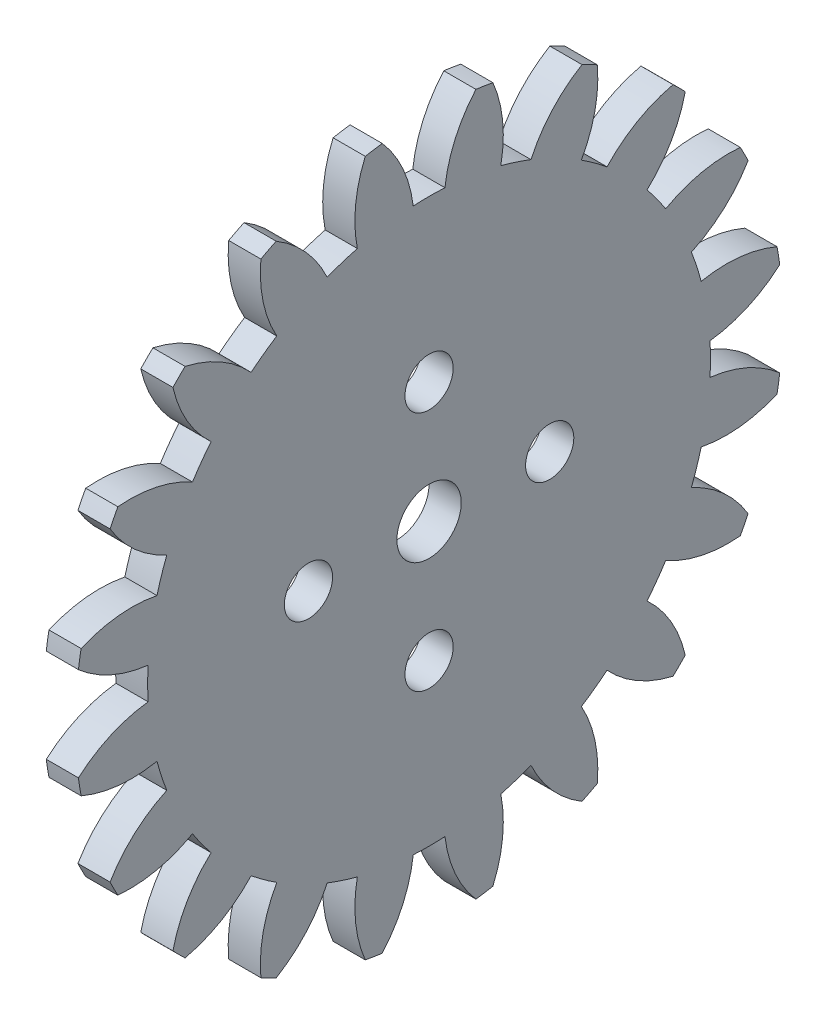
ISO-10303-21;
HEADER;
FILE_DESCRIPTION(('STEP AP214'),'2;1');
FILE_NAME('part.step','',(''),(''),'','','');
FILE_SCHEMA(('AUTOMOTIVE_DESIGN { 1 0 10303 214 1 1 1 1 }'));
ENDSEC;
DATA;
#1=APPLICATION_CONTEXT('core data for automotive mechanical design processes');
#2=APPLICATION_PROTOCOL_DEFINITION('international standard','automotive_design',2000,#1);
#3=PRODUCT_CONTEXT('',#1,'mechanical');
#4=PRODUCT('Part','Part','',(#3));
#5=PRODUCT_RELATED_PRODUCT_CATEGORY('part','',(#4));
#6=PRODUCT_DEFINITION_FORMATION('','',#4);
#7=PRODUCT_DEFINITION_CONTEXT('part definition',#1,'design');
#8=PRODUCT_DEFINITION('design','',#6,#7);
#9=PRODUCT_DEFINITION_SHAPE('','',#8);
#10=(LENGTH_UNIT() NAMED_UNIT(*) SI_UNIT(.MILLI.,.METRE.));
#11=(NAMED_UNIT(*) PLANE_ANGLE_UNIT() SI_UNIT($,.RADIAN.));
#12=(NAMED_UNIT(*) SI_UNIT($,.STERADIAN.) SOLID_ANGLE_UNIT());
#13=UNCERTAINTY_MEASURE_WITH_UNIT(LENGTH_MEASURE(1.E-05),#10,'distance_accuracy_value','');
#14=(GEOMETRIC_REPRESENTATION_CONTEXT(3) GLOBAL_UNCERTAINTY_ASSIGNED_CONTEXT((#13)) GLOBAL_UNIT_ASSIGNED_CONTEXT((#10,
#11,#12)) REPRESENTATION_CONTEXT('',''));
#15=CARTESIAN_POINT('',(0.,0.,0.));
#16=DIRECTION('',(0.,0.,1.));
#17=DIRECTION('',(1.,0.,0.));
#18=AXIS2_PLACEMENT_3D('',#15,#16,#17);
#19=CARTESIAN_POINT('',(-10.,0.,0.));
#20=DIRECTION('',(-1.,0.,0.));
#21=DIRECTION('',(0.,0.,1.));
#22=AXIS2_PLACEMENT_3D('',#19,#20,#21);
#23=CYLINDRICAL_SURFACE('',#22,22.);
#24=DIRECTION('',(-1.,0.,0.));
#25=VECTOR('',#24,1.);
#26=CARTESIAN_POINT('',(2.,10.4610206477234,19.3537347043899));
#27=LINE('',#26,#25);
#28=CARTESIAN_POINT('',(0.,10.4610206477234,19.3537347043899));
#29=VERTEX_POINT('',#28);
#30=CARTESIAN_POINT('',(2.,10.4610206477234,19.3537347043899));
#31=VERTEX_POINT('',#30);
#32=EDGE_CURVE('E1036',#29,#31,#27,.F.);
#33=ORIENTED_EDGE('',*,*,#32,.F.);
#34=CARTESIAN_POINT('',(0.,0.,0.));
#35=DIRECTION('',(-1.,0.,0.));
#36=DIRECTION('',(0.,0.,1.));
#37=AXIS2_PLACEMENT_3D('',#34,#35,#36);
#38=CIRCLE('',#37,22.);
#39=CARTESIAN_POINT('',(0.,9.50866661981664,19.8389833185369));
#40=VERTEX_POINT('',#39);
#41=EDGE_CURVE('E1048',#29,#40,#38,.F.);
#42=ORIENTED_EDGE('',*,*,#41,.T.);
#43=DIRECTION('',(-1.,0.,0.));
#44=VECTOR('',#43,1.);
#45=CARTESIAN_POINT('',(2.,9.50866661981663,19.8389833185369));
#46=LINE('',#45,#44);
#47=CARTESIAN_POINT('',(2.,9.50866661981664,19.8389833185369));
#48=VERTEX_POINT('',#47);
#49=EDGE_CURVE('E564',#48,#40,#46,.T.);
#50=ORIENTED_EDGE('',*,*,#49,.F.);
#51=CARTESIAN_POINT('',(2.,0.,0.));
#52=DIRECTION('',(-1.,0.,0.));
#53=DIRECTION('',(0.,0.,1.));
#54=AXIS2_PLACEMENT_3D('',#51,#52,#53);
#55=CIRCLE('',#54,22.);
#56=EDGE_CURVE('E41',#48,#31,#55,.T.);
#57=ORIENTED_EDGE('',*,*,#56,.T.);
#58=EDGE_LOOP('',(#33,#42,#50,#57));
#59=FACE_BOUND('',#58,.T.);
#60=ADVANCED_FACE('F38',(#59),#23,.T.);
#61=CARTESIAN_POINT('',(-10.,0.,0.));
#62=DIRECTION('',(-1.,0.,0.));
#63=DIRECTION('',(0.,0.,1.));
#64=AXIS2_PLACEMENT_3D('',#61,#62,#63);
#65=CYLINDRICAL_SURFACE('',#64,22.);
#66=DIRECTION('',(-1.,0.,0.));
#67=VECTOR('',#66,1.);
#68=CARTESIAN_POINT('',(2.,15.1738623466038,15.9296547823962));
#69=LINE('',#68,#67);
#70=CARTESIAN_POINT('',(2.,15.1738623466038,15.9296547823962));
#71=VERTEX_POINT('',#70);
#72=CARTESIAN_POINT('',(0.,15.1738623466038,15.9296547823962));
#73=VERTEX_POINT('',#72);
#74=EDGE_CURVE('E1029',#71,#73,#69,.T.);
#75=ORIENTED_EDGE('',*,*,#74,.F.);
#76=CARTESIAN_POINT('',(2.,0.,0.));
#77=DIRECTION('',(-1.,0.,0.));
#78=DIRECTION('',(0.,0.,1.));
#79=AXIS2_PLACEMENT_3D('',#76,#77,#78);
#80=CIRCLE('',#79,22.);
#81=CARTESIAN_POINT('',(2.,15.9296547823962,15.1738623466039));
#82=VERTEX_POINT('',#81);
#83=EDGE_CURVE('E579',#71,#82,#80,.T.);
#84=ORIENTED_EDGE('',*,*,#83,.T.);
#85=DIRECTION('',(-1.,0.,0.));
#86=VECTOR('',#85,1.);
#87=CARTESIAN_POINT('',(2.,15.9296547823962,15.1738623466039));
#88=LINE('',#87,#86);
#89=CARTESIAN_POINT('',(0.,15.9296547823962,15.1738623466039));
#90=VERTEX_POINT('',#89);
#91=EDGE_CURVE('E1025',#90,#82,#88,.F.);
#92=ORIENTED_EDGE('',*,*,#91,.F.);
#93=CARTESIAN_POINT('',(0.,0.,0.));
#94=DIRECTION('',(-1.,0.,0.));
#95=DIRECTION('',(0.,0.,1.));
#96=AXIS2_PLACEMENT_3D('',#93,#94,#95);
#97=CIRCLE('',#96,22.);
#98=EDGE_CURVE('E1051',#90,#73,#97,.F.);
#99=ORIENTED_EDGE('',*,*,#98,.T.);
#100=EDGE_LOOP('',(#75,#84,#92,#99));
#101=FACE_BOUND('',#100,.T.);
#102=ADVANCED_FACE('F1480',(#101),#65,.T.);
#103=CARTESIAN_POINT('',(-10.,0.,0.));
#104=DIRECTION('',(-1.,0.,0.));
#105=DIRECTION('',(0.,0.,1.));
#106=AXIS2_PLACEMENT_3D('',#103,#104,#105);
#107=CYLINDRICAL_SURFACE('',#106,22.);
#108=DIRECTION('',(-1.,0.,0.));
#109=VECTOR('',#108,1.);
#110=CARTESIAN_POINT('',(2.,19.8389833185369,9.5086666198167));
#111=LINE('',#110,#109);
#112=CARTESIAN_POINT('',(0.,19.8389833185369,9.5086666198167));
#113=VERTEX_POINT('',#112);
#114=CARTESIAN_POINT('',(2.,19.8389833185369,9.5086666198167));
#115=VERTEX_POINT('',#114);
#116=EDGE_CURVE('E1015',#113,#115,#111,.F.);
#117=ORIENTED_EDGE('',*,*,#116,.F.);
#118=CARTESIAN_POINT('',(0.,0.,0.));
#119=DIRECTION('',(-1.,0.,0.));
#120=DIRECTION('',(0.,0.,1.));
#121=AXIS2_PLACEMENT_3D('',#118,#119,#120);
#122=CIRCLE('',#121,22.);
#123=CARTESIAN_POINT('',(0.,19.3537347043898,10.4610206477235));
#124=VERTEX_POINT('',#123);
#125=EDGE_CURVE('E1054',#113,#124,#122,.F.);
#126=ORIENTED_EDGE('',*,*,#125,.T.);
#127=DIRECTION('',(-1.,0.,0.));
#128=VECTOR('',#127,1.);
#129=CARTESIAN_POINT('',(-10.,19.3537347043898,10.4610206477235));
#130=LINE('',#129,#128);
#131=CARTESIAN_POINT('',(2.,19.3537347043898,10.4610206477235));
#132=VERTEX_POINT('',#131);
#133=EDGE_CURVE('E575',#124,#132,#130,.F.);
#134=ORIENTED_EDGE('',*,*,#133,.T.);
#135=CARTESIAN_POINT('',(2.,0.,0.));
#136=DIRECTION('',(-1.,0.,0.));
#137=DIRECTION('',(0.,0.,1.));
#138=AXIS2_PLACEMENT_3D('',#135,#136,#137);
#139=CIRCLE('',#138,22.);
#140=EDGE_CURVE('E578',#132,#115,#139,.T.);
#141=ORIENTED_EDGE('',*,*,#140,.T.);
#142=EDGE_LOOP('',(#117,#126,#134,#141));
#143=FACE_BOUND('',#142,.T.);
#144=ADVANCED_FACE('F1477',(#143),#107,.T.);
#145=CARTESIAN_POINT('',(-10.,0.,0.));
#146=DIRECTION('',(-1.,0.,0.));
#147=DIRECTION('',(0.,0.,1.));
#148=AXIS2_PLACEMENT_3D('',#145,#146,#147);
#149=CYLINDRICAL_SURFACE('',#148,22.);
#150=DIRECTION('',(-1.,0.,0.));
#151=VECTOR('',#150,1.);
#152=CARTESIAN_POINT('',(2.,21.8063339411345,2.91269635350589));
#153=LINE('',#152,#151);
#154=CARTESIAN_POINT('',(0.,21.8063339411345,2.91269635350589));
#155=VERTEX_POINT('',#154);
#156=CARTESIAN_POINT('',(2.,21.8063339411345,2.91269635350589));
#157=VERTEX_POINT('',#156);
#158=EDGE_CURVE('E1003',#155,#157,#153,.F.);
#159=ORIENTED_EDGE('',*,*,#158,.F.);
#160=CARTESIAN_POINT('',(0.,0.,0.));
#161=DIRECTION('',(-1.,0.,0.));
#162=DIRECTION('',(0.,0.,1.));
#163=AXIS2_PLACEMENT_3D('',#160,#161,#162);
#164=CIRCLE('',#163,22.);
#165=CARTESIAN_POINT('',(0.,21.6391286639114,3.96838892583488));
#166=VERTEX_POINT('',#165);
#167=EDGE_CURVE('E1057',#155,#166,#164,.F.);
#168=ORIENTED_EDGE('',*,*,#167,.T.);
#169=DIRECTION('',(-1.,0.,0.));
#170=VECTOR('',#169,1.);
#171=CARTESIAN_POINT('',(2.,21.6391286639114,3.96838892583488));
#172=LINE('',#171,#170);
#173=CARTESIAN_POINT('',(2.,21.6391286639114,3.96838892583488));
#174=VERTEX_POINT('',#173);
#175=EDGE_CURVE('E1007',#174,#166,#172,.T.);
#176=ORIENTED_EDGE('',*,*,#175,.F.);
#177=CARTESIAN_POINT('',(2.,0.,0.));
#178=DIRECTION('',(-1.,0.,0.));
#179=DIRECTION('',(0.,0.,1.));
#180=AXIS2_PLACEMENT_3D('',#177,#178,#179);
#181=CIRCLE('',#180,22.);
#182=EDGE_CURVE('E1152',#174,#157,#181,.T.);
#183=ORIENTED_EDGE('',*,*,#182,.T.);
#184=EDGE_LOOP('',(#159,#168,#176,#183));
#185=FACE_BOUND('',#184,.T.);
#186=ADVANCED_FACE('F1473',(#185),#149,.T.);
#187=CARTESIAN_POINT('',(-10.,0.,0.));
#188=DIRECTION('',(-1.,0.,0.));
#189=DIRECTION('',(0.,0.,1.));
#190=AXIS2_PLACEMENT_3D('',#187,#188,#189);
#191=CYLINDRICAL_SURFACE('',#190,22.);
#192=DIRECTION('',(-1.,0.,0.));
#193=VECTOR('',#192,1.);
#194=CARTESIAN_POINT('',(2.,21.8063339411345,-2.91269635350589));
#195=LINE('',#194,#193);
#196=CARTESIAN_POINT('',(2.,21.8063339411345,-2.91269635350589));
#197=VERTEX_POINT('',#196);
#198=CARTESIAN_POINT('',(0.,21.8063339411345,-2.91269635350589));
#199=VERTEX_POINT('',#198);
#200=EDGE_CURVE('E994',#197,#199,#195,.T.);
#201=ORIENTED_EDGE('',*,*,#200,.F.);
#202=CARTESIAN_POINT('',(2.,0.,0.));
#203=DIRECTION('',(-1.,0.,0.));
#204=DIRECTION('',(0.,0.,1.));
#205=AXIS2_PLACEMENT_3D('',#202,#203,#204);
#206=CIRCLE('',#205,22.);
#207=CARTESIAN_POINT('',(2.,21.6391286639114,-3.96838892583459));
#208=VERTEX_POINT('',#207);
#209=EDGE_CURVE('E1149',#197,#208,#206,.T.);
#210=ORIENTED_EDGE('',*,*,#209,.T.);
#211=DIRECTION('',(-1.,0.,0.));
#212=VECTOR('',#211,1.);
#213=CARTESIAN_POINT('',(2.,21.6391286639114,-3.96838892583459));
#214=LINE('',#213,#212);
#215=CARTESIAN_POINT('',(0.,21.6391286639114,-3.96838892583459));
#216=VERTEX_POINT('',#215);
#217=EDGE_CURVE('E989',#216,#208,#214,.F.);
#218=ORIENTED_EDGE('',*,*,#217,.F.);
#219=CARTESIAN_POINT('',(0.,0.,0.));
#220=DIRECTION('',(-1.,0.,0.));
#221=DIRECTION('',(0.,0.,1.));
#222=AXIS2_PLACEMENT_3D('',#219,#220,#221);
#223=CIRCLE('',#222,22.);
#224=EDGE_CURVE('E1060',#216,#199,#223,.F.);
#225=ORIENTED_EDGE('',*,*,#224,.T.);
#226=EDGE_LOOP('',(#201,#210,#218,#225));
#227=FACE_BOUND('',#226,.T.);
#228=ADVANCED_FACE('F1469',(#227),#191,.T.);
#229=CARTESIAN_POINT('',(-10.,0.,0.));
#230=DIRECTION('',(-1.,0.,0.));
#231=DIRECTION('',(0.,0.,1.));
#232=AXIS2_PLACEMENT_3D('',#229,#230,#231);
#233=CYLINDRICAL_SURFACE('',#232,22.);
#234=DIRECTION('',(-1.,0.,0.));
#235=VECTOR('',#234,1.);
#236=CARTESIAN_POINT('',(2.,19.35373470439,-10.4610206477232));
#237=LINE('',#236,#235);
#238=CARTESIAN_POINT('',(0.,19.35373470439,-10.4610206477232));
#239=VERTEX_POINT('',#238);
#240=CARTESIAN_POINT('',(2.,19.35373470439,-10.4610206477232));
#241=VERTEX_POINT('',#240);
#242=EDGE_CURVE('E975',#239,#241,#237,.F.);
#243=ORIENTED_EDGE('',*,*,#242,.F.);
#244=CARTESIAN_POINT('',(0.,0.,0.));
#245=DIRECTION('',(-1.,0.,0.));
#246=DIRECTION('',(0.,0.,1.));
#247=AXIS2_PLACEMENT_3D('',#244,#245,#246);
#248=CIRCLE('',#247,22.);
#249=CARTESIAN_POINT('',(0.,19.838983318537,-9.50866661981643));
#250=VERTEX_POINT('',#249);
#251=EDGE_CURVE('E1063',#239,#250,#248,.F.);
#252=ORIENTED_EDGE('',*,*,#251,.T.);
#253=DIRECTION('',(-1.,0.,0.));
#254=VECTOR('',#253,1.);
#255=CARTESIAN_POINT('',(2.,19.838983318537,-9.50866661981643));
#256=LINE('',#255,#254);
#257=CARTESIAN_POINT('',(2.,19.838983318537,-9.50866661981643));
#258=VERTEX_POINT('',#257);
#259=EDGE_CURVE('E980',#258,#250,#256,.T.);
#260=ORIENTED_EDGE('',*,*,#259,.F.);
#261=CARTESIAN_POINT('',(2.,0.,0.));
#262=DIRECTION('',(-1.,0.,0.));
#263=DIRECTION('',(0.,0.,1.));
#264=AXIS2_PLACEMENT_3D('',#261,#262,#263);
#265=CIRCLE('',#264,22.);
#266=EDGE_CURVE('E1146',#258,#241,#265,.T.);
#267=ORIENTED_EDGE('',*,*,#266,.T.);
#268=EDGE_LOOP('',(#243,#252,#260,#267));
#269=FACE_BOUND('',#268,.T.);
#270=ADVANCED_FACE('F1465',(#269),#233,.T.);
#271=CARTESIAN_POINT('',(-10.,0.,0.));
#272=DIRECTION('',(-1.,0.,0.));
#273=DIRECTION('',(0.,0.,1.));
#274=AXIS2_PLACEMENT_3D('',#271,#272,#273);
#275=CYLINDRICAL_SURFACE('',#274,22.);
#276=DIRECTION('',(-1.,0.,0.));
#277=VECTOR('',#276,1.);
#278=CARTESIAN_POINT('',(2.,15.9296547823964,-15.1738623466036));
#279=LINE('',#278,#277);
#280=CARTESIAN_POINT('',(2.,15.9296547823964,-15.1738623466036));
#281=VERTEX_POINT('',#280);
#282=CARTESIAN_POINT('',(0.,15.9296547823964,-15.1738623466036));
#283=VERTEX_POINT('',#282);
#284=EDGE_CURVE('E966',#281,#283,#279,.T.);
#285=ORIENTED_EDGE('',*,*,#284,.F.);
#286=CARTESIAN_POINT('',(2.,0.,0.));
#287=DIRECTION('',(-1.,0.,0.));
#288=DIRECTION('',(0.,0.,1.));
#289=AXIS2_PLACEMENT_3D('',#286,#287,#288);
#290=CIRCLE('',#289,22.);
#291=CARTESIAN_POINT('',(2.,15.173862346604,-15.929654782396));
#292=VERTEX_POINT('',#291);
#293=EDGE_CURVE('E1143',#281,#292,#290,.T.);
#294=ORIENTED_EDGE('',*,*,#293,.T.);
#295=DIRECTION('',(-1.,0.,0.));
#296=VECTOR('',#295,1.);
#297=CARTESIAN_POINT('',(2.,15.173862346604,-15.929654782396));
#298=LINE('',#297,#296);
#299=CARTESIAN_POINT('',(0.,15.173862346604,-15.929654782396));
#300=VERTEX_POINT('',#299);
#301=EDGE_CURVE('E961',#300,#292,#298,.F.);
#302=ORIENTED_EDGE('',*,*,#301,.F.);
#303=CARTESIAN_POINT('',(0.,0.,0.));
#304=DIRECTION('',(-1.,0.,0.));
#305=DIRECTION('',(0.,0.,1.));
#306=AXIS2_PLACEMENT_3D('',#303,#304,#305);
#307=CIRCLE('',#306,22.);
#308=EDGE_CURVE('E1067',#300,#283,#307,.F.);
#309=ORIENTED_EDGE('',*,*,#308,.T.);
#310=EDGE_LOOP('',(#285,#294,#302,#309));
#311=FACE_BOUND('',#310,.T.);
#312=ADVANCED_FACE('F1461',(#311),#275,.T.);
#313=CARTESIAN_POINT('',(-10.,0.,0.));
#314=DIRECTION('',(-1.,0.,0.));
#315=DIRECTION('',(0.,0.,1.));
#316=AXIS2_PLACEMENT_3D('',#313,#314,#315);
#317=CYLINDRICAL_SURFACE('',#316,22.);
#318=DIRECTION('',(-1.,0.,0.));
#319=VECTOR('',#318,1.);
#320=CARTESIAN_POINT('',(2.,9.50866661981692,-19.8389833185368));
#321=LINE('',#320,#319);
#322=CARTESIAN_POINT('',(0.,9.50866661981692,-19.8389833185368));
#323=VERTEX_POINT('',#322);
#324=CARTESIAN_POINT('',(2.,9.50866661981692,-19.8389833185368));
#325=VERTEX_POINT('',#324);
#326=EDGE_CURVE('E947',#323,#325,#321,.F.);
#327=ORIENTED_EDGE('',*,*,#326,.F.);
#328=CARTESIAN_POINT('',(0.,0.,0.));
#329=DIRECTION('',(-1.,0.,0.));
#330=DIRECTION('',(0.,0.,1.));
#331=AXIS2_PLACEMENT_3D('',#328,#329,#330);
#332=CIRCLE('',#331,22.);
#333=CARTESIAN_POINT('',(0.,10.4610206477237,-19.3537347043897));
#334=VERTEX_POINT('',#333);
#335=EDGE_CURVE('E1071',#323,#334,#332,.F.);
#336=ORIENTED_EDGE('',*,*,#335,.T.);
#337=DIRECTION('',(-1.,0.,0.));
#338=VECTOR('',#337,1.);
#339=CARTESIAN_POINT('',(2.,10.4610206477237,-19.3537347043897));
#340=LINE('',#339,#338);
#341=CARTESIAN_POINT('',(2.,10.4610206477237,-19.3537347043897));
#342=VERTEX_POINT('',#341);
#343=EDGE_CURVE('E952',#342,#334,#340,.T.);
#344=ORIENTED_EDGE('',*,*,#343,.F.);
#345=CARTESIAN_POINT('',(2.,0.,0.));
#346=DIRECTION('',(-1.,0.,0.));
#347=DIRECTION('',(0.,0.,1.));
#348=AXIS2_PLACEMENT_3D('',#345,#346,#347);
#349=CIRCLE('',#348,22.);
#350=EDGE_CURVE('E1140',#342,#325,#349,.T.);
#351=ORIENTED_EDGE('',*,*,#350,.T.);
#352=EDGE_LOOP('',(#327,#336,#344,#351));
#353=FACE_BOUND('',#352,.T.);
#354=ADVANCED_FACE('F1457',(#353),#317,.T.);
#355=CARTESIAN_POINT('',(-10.,0.,0.));
#356=DIRECTION('',(-1.,0.,0.));
#357=DIRECTION('',(0.,0.,1.));
#358=AXIS2_PLACEMENT_3D('',#355,#356,#357);
#359=CYLINDRICAL_SURFACE('',#358,22.);
#360=DIRECTION('',(-1.,0.,0.));
#361=VECTOR('',#360,1.);
#362=CARTESIAN_POINT('',(2.,2.91269635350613,-21.8063339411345));
#363=LINE('',#362,#361);
#364=CARTESIAN_POINT('',(0.,2.91269635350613,-21.8063339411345));
#365=VERTEX_POINT('',#364);
#366=CARTESIAN_POINT('',(2.,2.91269635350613,-21.8063339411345));
#367=VERTEX_POINT('',#366);
#368=EDGE_CURVE('E933',#365,#367,#363,.F.);
#369=ORIENTED_EDGE('',*,*,#368,.F.);
#370=CARTESIAN_POINT('',(0.,0.,0.));
#371=DIRECTION('',(-1.,0.,0.));
#372=DIRECTION('',(0.,0.,1.));
#373=AXIS2_PLACEMENT_3D('',#370,#371,#372);
#374=CIRCLE('',#373,22.);
#375=CARTESIAN_POINT('',(0.,3.96838892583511,-21.6391286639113));
#376=VERTEX_POINT('',#375);
#377=EDGE_CURVE('E1075',#365,#376,#374,.F.);
#378=ORIENTED_EDGE('',*,*,#377,.T.);
#379=DIRECTION('',(-1.,0.,0.));
#380=VECTOR('',#379,1.);
#381=CARTESIAN_POINT('',(2.,3.96838892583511,-21.6391286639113));
#382=LINE('',#381,#380);
#383=CARTESIAN_POINT('',(2.,3.96838892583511,-21.6391286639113));
#384=VERTEX_POINT('',#383);
#385=EDGE_CURVE('E938',#384,#376,#382,.T.);
#386=ORIENTED_EDGE('',*,*,#385,.F.);
#387=CARTESIAN_POINT('',(2.,0.,0.));
#388=DIRECTION('',(-1.,0.,0.));
#389=DIRECTION('',(0.,0.,1.));
#390=AXIS2_PLACEMENT_3D('',#387,#388,#389);
#391=CIRCLE('',#390,22.);
#392=EDGE_CURVE('E1137',#384,#367,#391,.T.);
#393=ORIENTED_EDGE('',*,*,#392,.T.);
#394=EDGE_LOOP('',(#369,#378,#386,#393));
#395=FACE_BOUND('',#394,.T.);
#396=ADVANCED_FACE('F1453',(#395),#359,.T.);
#397=CARTESIAN_POINT('',(-10.,0.,0.));
#398=DIRECTION('',(-1.,0.,0.));
#399=DIRECTION('',(0.,0.,1.));
#400=AXIS2_PLACEMENT_3D('',#397,#398,#399);
#401=CYLINDRICAL_SURFACE('',#400,22.);
#402=DIRECTION('',(-1.,0.,0.));
#403=VECTOR('',#402,1.);
#404=CARTESIAN_POINT('',(2.,-2.91269635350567,-21.8063339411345));
#405=LINE('',#404,#403);
#406=CARTESIAN_POINT('',(2.,-2.91269635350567,-21.8063339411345));
#407=VERTEX_POINT('',#406);
#408=CARTESIAN_POINT('',(0.,-2.91269635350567,-21.8063339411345));
#409=VERTEX_POINT('',#408);
#410=EDGE_CURVE('E924',#407,#409,#405,.T.);
#411=ORIENTED_EDGE('',*,*,#410,.F.);
#412=CARTESIAN_POINT('',(2.,0.,0.));
#413=DIRECTION('',(-1.,0.,0.));
#414=DIRECTION('',(0.,0.,1.));
#415=AXIS2_PLACEMENT_3D('',#412,#413,#414);
#416=CIRCLE('',#415,22.);
#417=CARTESIAN_POINT('',(2.,-3.96838892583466,-21.6391286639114));
#418=VERTEX_POINT('',#417);
#419=EDGE_CURVE('E1134',#407,#418,#416,.T.);
#420=ORIENTED_EDGE('',*,*,#419,.T.);
#421=DIRECTION('',(-1.,0.,0.));
#422=VECTOR('',#421,1.);
#423=CARTESIAN_POINT('',(2.,-3.96838892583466,-21.6391286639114));
#424=LINE('',#423,#422);
#425=CARTESIAN_POINT('',(0.,-3.96838892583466,-21.6391286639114));
#426=VERTEX_POINT('',#425);
#427=EDGE_CURVE('E919',#426,#418,#424,.F.);
#428=ORIENTED_EDGE('',*,*,#427,.F.);
#429=CARTESIAN_POINT('',(0.,0.,0.));
#430=DIRECTION('',(-1.,0.,0.));
#431=DIRECTION('',(0.,0.,1.));
#432=AXIS2_PLACEMENT_3D('',#429,#430,#431);
#433=CIRCLE('',#432,22.);
#434=EDGE_CURVE('E1079',#426,#409,#433,.F.);
#435=ORIENTED_EDGE('',*,*,#434,.T.);
#436=EDGE_LOOP('',(#411,#420,#428,#435));
#437=FACE_BOUND('',#436,.T.);
#438=ADVANCED_FACE('F1449',(#437),#401,.T.);
#439=CARTESIAN_POINT('',(-10.,0.,0.));
#440=DIRECTION('',(-1.,0.,0.));
#441=DIRECTION('',(0.,0.,1.));
#442=AXIS2_PLACEMENT_3D('',#439,#440,#441);
#443=CYLINDRICAL_SURFACE('',#442,22.);
#444=DIRECTION('',(-1.,0.,0.));
#445=VECTOR('',#444,1.);
#446=CARTESIAN_POINT('',(2.,-9.5086666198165,-19.838983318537));
#447=LINE('',#446,#445);
#448=CARTESIAN_POINT('',(2.,-9.5086666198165,-19.838983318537));
#449=VERTEX_POINT('',#448);
#450=CARTESIAN_POINT('',(0.,-9.5086666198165,-19.838983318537));
#451=VERTEX_POINT('',#450);
#452=EDGE_CURVE('E910',#449,#451,#447,.T.);
#453=ORIENTED_EDGE('',*,*,#452,.F.);
#454=CARTESIAN_POINT('',(2.,0.,0.));
#455=DIRECTION('',(-1.,0.,0.));
#456=DIRECTION('',(0.,0.,1.));
#457=AXIS2_PLACEMENT_3D('',#454,#455,#456);
#458=CIRCLE('',#457,22.);
#459=CARTESIAN_POINT('',(2.,-10.4610206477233,-19.3537347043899));
#460=VERTEX_POINT('',#459);
#461=EDGE_CURVE('E1131',#449,#460,#458,.T.);
#462=ORIENTED_EDGE('',*,*,#461,.T.);
#463=DIRECTION('',(-1.,0.,0.));
#464=VECTOR('',#463,1.);
#465=CARTESIAN_POINT('',(2.,-10.4610206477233,-19.3537347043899));
#466=LINE('',#465,#464);
#467=CARTESIAN_POINT('',(0.,-10.4610206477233,-19.3537347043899));
#468=VERTEX_POINT('',#467);
#469=EDGE_CURVE('E905',#468,#460,#466,.F.);
#470=ORIENTED_EDGE('',*,*,#469,.F.);
#471=CARTESIAN_POINT('',(0.,0.,0.));
#472=DIRECTION('',(-1.,0.,0.));
#473=DIRECTION('',(0.,0.,1.));
#474=AXIS2_PLACEMENT_3D('',#471,#472,#473);
#475=CIRCLE('',#474,22.);
#476=EDGE_CURVE('E1083',#468,#451,#475,.F.);
#477=ORIENTED_EDGE('',*,*,#476,.T.);
#478=EDGE_LOOP('',(#453,#462,#470,#477));
#479=FACE_BOUND('',#478,.T.);
#480=ADVANCED_FACE('F1445',(#479),#443,.T.);
#481=CARTESIAN_POINT('',(-10.,0.,0.));
#482=DIRECTION('',(-1.,0.,0.));
#483=DIRECTION('',(0.,0.,1.));
#484=AXIS2_PLACEMENT_3D('',#481,#482,#483);
#485=CYLINDRICAL_SURFACE('',#484,22.);
#486=DIRECTION('',(-1.,0.,0.));
#487=VECTOR('',#486,1.);
#488=CARTESIAN_POINT('',(2.,-15.9296547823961,-15.173862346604));
#489=LINE('',#488,#487);
#490=CARTESIAN_POINT('',(0.,-15.9296547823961,-15.173862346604));
#491=VERTEX_POINT('',#490);
#492=CARTESIAN_POINT('',(2.,-15.9296547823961,-15.173862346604));
#493=VERTEX_POINT('',#492);
#494=EDGE_CURVE('E891',#491,#493,#489,.F.);
#495=ORIENTED_EDGE('',*,*,#494,.F.);
#496=CARTESIAN_POINT('',(0.,0.,0.));
#497=DIRECTION('',(-1.,0.,0.));
#498=DIRECTION('',(0.,0.,1.));
#499=AXIS2_PLACEMENT_3D('',#496,#497,#498);
#500=CIRCLE('',#499,22.);
#501=CARTESIAN_POINT('',(0.,-15.1738623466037,-15.9296547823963));
#502=VERTEX_POINT('',#501);
#503=EDGE_CURVE('E1087',#491,#502,#500,.F.);
#504=ORIENTED_EDGE('',*,*,#503,.T.);
#505=DIRECTION('',(-1.,0.,0.));
#506=VECTOR('',#505,1.);
#507=CARTESIAN_POINT('',(2.,-15.1738623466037,-15.9296547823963));
#508=LINE('',#507,#506);
#509=CARTESIAN_POINT('',(2.,-15.1738623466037,-15.9296547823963));
#510=VERTEX_POINT('',#509);
#511=EDGE_CURVE('E896',#510,#502,#508,.T.);
#512=ORIENTED_EDGE('',*,*,#511,.F.);
#513=CARTESIAN_POINT('',(2.,0.,0.));
#514=DIRECTION('',(-1.,0.,0.));
#515=DIRECTION('',(0.,0.,1.));
#516=AXIS2_PLACEMENT_3D('',#513,#514,#515);
#517=CIRCLE('',#516,22.);
#518=EDGE_CURVE('E1128',#510,#493,#517,.T.);
#519=ORIENTED_EDGE('',*,*,#518,.T.);
#520=EDGE_LOOP('',(#495,#504,#512,#519));
#521=FACE_BOUND('',#520,.T.);
#522=ADVANCED_FACE('F1441',(#521),#485,.T.);
#523=CARTESIAN_POINT('',(-10.,0.,0.));
#524=DIRECTION('',(-1.,0.,0.));
#525=DIRECTION('',(0.,0.,1.));
#526=AXIS2_PLACEMENT_3D('',#523,#524,#525);
#527=CYLINDRICAL_SURFACE('',#526,22.);
#528=DIRECTION('',(-1.,0.,0.));
#529=VECTOR('',#528,1.);
#530=CARTESIAN_POINT('',(2.,-19.3537347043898,-10.4610206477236));
#531=LINE('',#530,#529);
#532=CARTESIAN_POINT('',(2.,-19.3537347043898,-10.4610206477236));
#533=VERTEX_POINT('',#532);
#534=CARTESIAN_POINT('',(0.,-19.3537347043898,-10.4610206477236));
#535=VERTEX_POINT('',#534);
#536=EDGE_CURVE('E882',#533,#535,#531,.T.);
#537=ORIENTED_EDGE('',*,*,#536,.F.);
#538=CARTESIAN_POINT('',(2.,0.,0.));
#539=DIRECTION('',(-1.,0.,0.));
#540=DIRECTION('',(0.,0.,1.));
#541=AXIS2_PLACEMENT_3D('',#538,#539,#540);
#542=CIRCLE('',#541,22.);
#543=CARTESIAN_POINT('',(2.,-19.8389833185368,-9.50866661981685));
#544=VERTEX_POINT('',#543);
#545=EDGE_CURVE('E1126',#533,#544,#542,.T.);
#546=ORIENTED_EDGE('',*,*,#545,.T.);
#547=DIRECTION('',(-1.,0.,0.));
#548=VECTOR('',#547,1.);
#549=CARTESIAN_POINT('',(2.,-19.8389833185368,-9.50866661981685));
#550=LINE('',#549,#548);
#551=CARTESIAN_POINT('',(0.,-19.8389833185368,-9.50866661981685));
#552=VERTEX_POINT('',#551);
#553=EDGE_CURVE('E878',#552,#544,#550,.F.);
#554=ORIENTED_EDGE('',*,*,#553,.F.);
#555=CARTESIAN_POINT('',(0.,0.,0.));
#556=DIRECTION('',(-1.,0.,0.));
#557=DIRECTION('',(0.,0.,1.));
#558=AXIS2_PLACEMENT_3D('',#555,#556,#557);
#559=CIRCLE('',#558,22.);
#560=EDGE_CURVE('E1090',#552,#535,#559,.F.);
#561=ORIENTED_EDGE('',*,*,#560,.T.);
#562=EDGE_LOOP('',(#537,#546,#554,#561));
#563=FACE_BOUND('',#562,.T.);
#564=ADVANCED_FACE('F1437',(#563),#527,.T.);
#565=CARTESIAN_POINT('',(-10.,0.,0.));
#566=DIRECTION('',(-1.,0.,0.));
#567=DIRECTION('',(0.,0.,1.));
#568=AXIS2_PLACEMENT_3D('',#565,#566,#567);
#569=CYLINDRICAL_SURFACE('',#568,22.);
#570=DIRECTION('',(-1.,0.,0.));
#571=VECTOR('',#570,1.);
#572=CARTESIAN_POINT('',(2.,-21.6391286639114,-3.96838892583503));
#573=LINE('',#572,#571);
#574=CARTESIAN_POINT('',(2.,-21.6391286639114,-3.96838892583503));
#575=VERTEX_POINT('',#574);
#576=CARTESIAN_POINT('',(0.,-21.6391286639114,-3.96838892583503));
#577=VERTEX_POINT('',#576);
#578=EDGE_CURVE('E871',#575,#577,#573,.T.);
#579=ORIENTED_EDGE('',*,*,#578,.F.);
#580=CARTESIAN_POINT('',(2.,0.,0.));
#581=DIRECTION('',(-1.,0.,0.));
#582=DIRECTION('',(0.,0.,1.));
#583=AXIS2_PLACEMENT_3D('',#580,#581,#582);
#584=CIRCLE('',#583,22.);
#585=CARTESIAN_POINT('',(2.,-21.8063339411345,-2.91269635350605));
#586=VERTEX_POINT('',#585);
#587=EDGE_CURVE('E1124',#575,#586,#584,.T.);
#588=ORIENTED_EDGE('',*,*,#587,.T.);
#589=DIRECTION('',(-1.,0.,0.));
#590=VECTOR('',#589,1.);
#591=CARTESIAN_POINT('',(2.,-21.8063339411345,-2.91269635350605));
#592=LINE('',#591,#590);
#593=CARTESIAN_POINT('',(0.,-21.8063339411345,-2.91269635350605));
#594=VERTEX_POINT('',#593);
#595=EDGE_CURVE('E867',#594,#586,#592,.F.);
#596=ORIENTED_EDGE('',*,*,#595,.F.);
#597=CARTESIAN_POINT('',(0.,0.,0.));
#598=DIRECTION('',(-1.,0.,0.));
#599=DIRECTION('',(0.,0.,1.));
#600=AXIS2_PLACEMENT_3D('',#597,#598,#599);
#601=CIRCLE('',#600,22.);
#602=EDGE_CURVE('E1093',#594,#577,#601,.F.);
#603=ORIENTED_EDGE('',*,*,#602,.T.);
#604=EDGE_LOOP('',(#579,#588,#596,#603));
#605=FACE_BOUND('',#604,.T.);
#606=ADVANCED_FACE('F1433',(#605),#569,.T.);
#607=CARTESIAN_POINT('',(-10.,0.,0.));
#608=DIRECTION('',(-1.,0.,0.));
#609=DIRECTION('',(0.,0.,1.));
#610=AXIS2_PLACEMENT_3D('',#607,#608,#609);
#611=CYLINDRICAL_SURFACE('',#610,22.);
#612=DIRECTION('',(-1.,0.,0.));
#613=VECTOR('',#612,1.);
#614=CARTESIAN_POINT('',(2.,-21.8063339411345,2.91269635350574));
#615=LINE('',#614,#613);
#616=CARTESIAN_POINT('',(2.,-21.8063339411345,2.91269635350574));
#617=VERTEX_POINT('',#616);
#618=CARTESIAN_POINT('',(0.,-21.8063339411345,2.91269635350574));
#619=VERTEX_POINT('',#618);
#620=EDGE_CURVE('E860',#617,#619,#615,.T.);
#621=ORIENTED_EDGE('',*,*,#620,.F.);
#622=CARTESIAN_POINT('',(2.,0.,0.));
#623=DIRECTION('',(-1.,0.,0.));
#624=DIRECTION('',(0.,0.,1.));
#625=AXIS2_PLACEMENT_3D('',#622,#623,#624);
#626=CIRCLE('',#625,22.);
#627=CARTESIAN_POINT('',(2.,-21.6391286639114,3.96838892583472));
#628=VERTEX_POINT('',#627);
#629=EDGE_CURVE('E1122',#617,#628,#626,.T.);
#630=ORIENTED_EDGE('',*,*,#629,.T.);
#631=DIRECTION('',(-1.,0.,0.));
#632=VECTOR('',#631,1.);
#633=CARTESIAN_POINT('',(2.,-21.6391286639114,3.96838892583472));
#634=LINE('',#633,#632);
#635=CARTESIAN_POINT('',(0.,-21.6391286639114,3.96838892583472));
#636=VERTEX_POINT('',#635);
#637=EDGE_CURVE('E853',#636,#628,#634,.F.);
#638=ORIENTED_EDGE('',*,*,#637,.F.);
#639=CARTESIAN_POINT('',(0.,0.,0.));
#640=DIRECTION('',(-1.,0.,0.));
#641=DIRECTION('',(0.,0.,1.));
#642=AXIS2_PLACEMENT_3D('',#639,#640,#641);
#643=CIRCLE('',#642,22.);
#644=EDGE_CURVE('E1096',#636,#619,#643,.F.);
#645=ORIENTED_EDGE('',*,*,#644,.T.);
#646=EDGE_LOOP('',(#621,#630,#638,#645));
#647=FACE_BOUND('',#646,.T.);
#648=ADVANCED_FACE('F1429',(#647),#611,.T.);
#649=CARTESIAN_POINT('',(-10.,0.,0.));
#650=DIRECTION('',(-1.,0.,0.));
#651=DIRECTION('',(0.,0.,1.));
#652=AXIS2_PLACEMENT_3D('',#649,#650,#651);
#653=CYLINDRICAL_SURFACE('',#652,22.);
#654=DIRECTION('',(-1.,0.,0.));
#655=VECTOR('',#654,1.);
#656=CARTESIAN_POINT('',(2.,-19.8389833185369,9.50866661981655));
#657=LINE('',#656,#655);
#658=CARTESIAN_POINT('',(2.,-19.8389833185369,9.50866661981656));
#659=VERTEX_POINT('',#658);
#660=CARTESIAN_POINT('',(0.,-19.8389833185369,9.50866661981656));
#661=VERTEX_POINT('',#660);
#662=EDGE_CURVE('E848',#659,#661,#657,.T.);
#663=ORIENTED_EDGE('',*,*,#662,.F.);
#664=CARTESIAN_POINT('',(2.,0.,0.));
#665=DIRECTION('',(-1.,0.,0.));
#666=DIRECTION('',(0.,0.,1.));
#667=AXIS2_PLACEMENT_3D('',#664,#665,#666);
#668=CIRCLE('',#667,22.);
#669=CARTESIAN_POINT('',(2.,-19.3537347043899,10.4610206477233));
#670=VERTEX_POINT('',#669);
#671=EDGE_CURVE('E583',#659,#670,#668,.T.);
#672=ORIENTED_EDGE('',*,*,#671,.T.);
#673=DIRECTION('',(-1.,0.,0.));
#674=VECTOR('',#673,1.);
#675=CARTESIAN_POINT('',(2.,-19.3537347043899,10.4610206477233));
#676=LINE('',#675,#674);
#677=CARTESIAN_POINT('',(0.,-19.3537347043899,10.4610206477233));
#678=VERTEX_POINT('',#677);
#679=EDGE_CURVE('E580',#678,#670,#676,.F.);
#680=ORIENTED_EDGE('',*,*,#679,.F.);
#681=CARTESIAN_POINT('',(0.,0.,0.));
#682=DIRECTION('',(-1.,0.,0.));
#683=DIRECTION('',(0.,0.,1.));
#684=AXIS2_PLACEMENT_3D('',#681,#682,#683);
#685=CIRCLE('',#684,22.);
#686=EDGE_CURVE('E1099',#678,#661,#685,.F.);
#687=ORIENTED_EDGE('',*,*,#686,.T.);
#688=EDGE_LOOP('',(#663,#672,#680,#687));
#689=FACE_BOUND('',#688,.T.);
#690=ADVANCED_FACE('F1425',(#689),#653,.T.);
#691=CARTESIAN_POINT('',(-10.,0.,0.));
#692=DIRECTION('',(-1.,0.,0.));
#693=DIRECTION('',(0.,0.,1.));
#694=AXIS2_PLACEMENT_3D('',#691,#692,#693);
#695=CYLINDRICAL_SURFACE('',#694,22.);
#696=DIRECTION('',(-1.,0.,0.));
#697=VECTOR('',#696,1.);
#698=CARTESIAN_POINT('',(2.,-15.1738623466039,15.9296547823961));
#699=LINE('',#698,#697);
#700=CARTESIAN_POINT('',(0.,-15.1738623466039,15.9296547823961));
#701=VERTEX_POINT('',#700);
#702=CARTESIAN_POINT('',(2.,-15.1738623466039,15.9296547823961));
#703=VERTEX_POINT('',#702);
#704=EDGE_CURVE('E835',#701,#703,#699,.F.);
#705=ORIENTED_EDGE('',*,*,#704,.F.);
#706=CARTESIAN_POINT('',(0.,0.,0.));
#707=DIRECTION('',(-1.,0.,0.));
#708=DIRECTION('',(0.,0.,1.));
#709=AXIS2_PLACEMENT_3D('',#706,#707,#708);
#710=CIRCLE('',#709,22.);
#711=CARTESIAN_POINT('',(0.,-15.9296547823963,15.1738623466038));
#712=VERTEX_POINT('',#711);
#713=EDGE_CURVE('E1102',#701,#712,#710,.F.);
#714=ORIENTED_EDGE('',*,*,#713,.T.);
#715=DIRECTION('',(-1.,0.,0.));
#716=VECTOR('',#715,1.);
#717=CARTESIAN_POINT('',(2.,-15.9296547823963,15.1738623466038));
#718=LINE('',#717,#716);
#719=CARTESIAN_POINT('',(2.,-15.9296547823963,15.1738623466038));
#720=VERTEX_POINT('',#719);
#721=EDGE_CURVE('E839',#720,#712,#718,.T.);
#722=ORIENTED_EDGE('',*,*,#721,.F.);
#723=CARTESIAN_POINT('',(2.,0.,0.));
#724=DIRECTION('',(-1.,0.,0.));
#725=DIRECTION('',(0.,0.,1.));
#726=AXIS2_PLACEMENT_3D('',#723,#724,#725);
#727=CIRCLE('',#726,22.);
#728=EDGE_CURVE('E582',#720,#703,#727,.T.);
#729=ORIENTED_EDGE('',*,*,#728,.T.);
#730=EDGE_LOOP('',(#705,#714,#722,#729));
#731=FACE_BOUND('',#730,.T.);
#732=ADVANCED_FACE('F1421',(#731),#695,.T.);
#733=CARTESIAN_POINT('',(-10.,0.,0.));
#734=DIRECTION('',(-1.,0.,0.));
#735=DIRECTION('',(0.,0.,1.));
#736=AXIS2_PLACEMENT_3D('',#733,#734,#735);
#737=CYLINDRICAL_SURFACE('',#736,22.);
#738=DIRECTION('',(-1.,0.,0.));
#739=VECTOR('',#738,1.);
#740=CARTESIAN_POINT('',(2.,-10.4610206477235,19.3537347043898));
#741=LINE('',#740,#739);
#742=CARTESIAN_POINT('',(2.,-10.4610206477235,19.3537347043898));
#743=VERTEX_POINT('',#742);
#744=CARTESIAN_POINT('',(0.,-10.4610206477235,19.3537347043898));
#745=VERTEX_POINT('',#744);
#746=EDGE_CURVE('E828',#743,#745,#741,.T.);
#747=ORIENTED_EDGE('',*,*,#746,.F.);
#748=CARTESIAN_POINT('',(2.,0.,0.));
#749=DIRECTION('',(-1.,0.,0.));
#750=DIRECTION('',(0.,0.,1.));
#751=AXIS2_PLACEMENT_3D('',#748,#749,#750);
#752=CIRCLE('',#751,22.);
#753=CARTESIAN_POINT('',(2.,-9.50866661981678,19.8389833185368));
#754=VERTEX_POINT('',#753);
#755=EDGE_CURVE('E1117',#743,#754,#752,.T.);
#756=ORIENTED_EDGE('',*,*,#755,.T.);
#757=DIRECTION('',(-1.,0.,0.));
#758=VECTOR('',#757,1.);
#759=CARTESIAN_POINT('',(2.,-9.50866661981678,19.8389833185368));
#760=LINE('',#759,#758);
#761=CARTESIAN_POINT('',(0.,-9.50866661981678,19.8389833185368));
#762=VERTEX_POINT('',#761);
#763=EDGE_CURVE('E824',#762,#754,#760,.F.);
#764=ORIENTED_EDGE('',*,*,#763,.F.);
#765=CARTESIAN_POINT('',(0.,0.,0.));
#766=DIRECTION('',(-1.,0.,0.));
#767=DIRECTION('',(0.,0.,1.));
#768=AXIS2_PLACEMENT_3D('',#765,#766,#767);
#769=CIRCLE('',#768,22.);
#770=EDGE_CURVE('E1105',#762,#745,#769,.F.);
#771=ORIENTED_EDGE('',*,*,#770,.T.);
#772=EDGE_LOOP('',(#747,#756,#764,#771));
#773=FACE_BOUND('',#772,.T.);
#774=ADVANCED_FACE('F1417',(#773),#737,.T.);
#775=CARTESIAN_POINT('',(-10.,0.,0.));
#776=DIRECTION('',(-1.,0.,0.));
#777=DIRECTION('',(0.,0.,1.));
#778=AXIS2_PLACEMENT_3D('',#775,#776,#777);
#779=CYLINDRICAL_SURFACE('',#778,22.);
#780=DIRECTION('',(-1.,0.,0.));
#781=VECTOR('',#780,1.);
#782=CARTESIAN_POINT('',(2.,-3.96838892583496,21.6391286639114));
#783=LINE('',#782,#781);
#784=CARTESIAN_POINT('',(2.,-3.96838892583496,21.6391286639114));
#785=VERTEX_POINT('',#784);
#786=CARTESIAN_POINT('',(0.,-3.96838892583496,21.6391286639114));
#787=VERTEX_POINT('',#786);
#788=EDGE_CURVE('E815',#785,#787,#783,.T.);
#789=ORIENTED_EDGE('',*,*,#788,.F.);
#790=CARTESIAN_POINT('',(2.,0.,0.));
#791=DIRECTION('',(-1.,0.,0.));
#792=DIRECTION('',(0.,0.,1.));
#793=AXIS2_PLACEMENT_3D('',#790,#791,#792);
#794=CIRCLE('',#793,22.);
#795=CARTESIAN_POINT('',(2.,-2.91269635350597,21.8063339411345));
#796=VERTEX_POINT('',#795);
#797=EDGE_CURVE('E1114',#785,#796,#794,.T.);
#798=ORIENTED_EDGE('',*,*,#797,.T.);
#799=DIRECTION('',(-1.,0.,0.));
#800=VECTOR('',#799,1.);
#801=CARTESIAN_POINT('',(2.,-2.91269635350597,21.8063339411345));
#802=LINE('',#801,#800);
#803=CARTESIAN_POINT('',(0.,-2.91269635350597,21.8063339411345));
#804=VERTEX_POINT('',#803);
#805=EDGE_CURVE('E1180',#804,#796,#802,.F.);
#806=ORIENTED_EDGE('',*,*,#805,.F.);
#807=CARTESIAN_POINT('',(0.,0.,0.));
#808=DIRECTION('',(-1.,0.,0.));
#809=DIRECTION('',(0.,0.,1.));
#810=AXIS2_PLACEMENT_3D('',#807,#808,#809);
#811=CIRCLE('',#810,22.);
#812=EDGE_CURVE('E1108',#804,#787,#811,.F.);
#813=ORIENTED_EDGE('',*,*,#812,.T.);
#814=EDGE_LOOP('',(#789,#798,#806,#813));
#815=FACE_BOUND('',#814,.T.);
#816=ADVANCED_FACE('F1413',(#815),#779,.T.);
#817=CARTESIAN_POINT('',(-10.,0.,0.));
#818=DIRECTION('',(-1.,0.,0.));
#819=DIRECTION('',(0.,0.,1.));
#820=AXIS2_PLACEMENT_3D('',#817,#818,#819);
#821=CYLINDRICAL_SURFACE('',#820,22.);
#822=DIRECTION('',(-1.,0.,0.));
#823=VECTOR('',#822,1.);
#824=CARTESIAN_POINT('',(2.,3.9683889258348,21.6391286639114));
#825=LINE('',#824,#823);
#826=CARTESIAN_POINT('',(0.,3.9683889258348,21.6391286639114));
#827=VERTEX_POINT('',#826);
#828=CARTESIAN_POINT('',(2.,3.9683889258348,21.6391286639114));
#829=VERTEX_POINT('',#828);
#830=EDGE_CURVE('E557',#827,#829,#825,.F.);
#831=ORIENTED_EDGE('',*,*,#830,.F.);
#832=CARTESIAN_POINT('',(0.,0.,0.));
#833=DIRECTION('',(-1.,0.,0.));
#834=DIRECTION('',(0.,0.,1.));
#835=AXIS2_PLACEMENT_3D('',#832,#833,#834);
#836=CIRCLE('',#835,22.);
#837=CARTESIAN_POINT('',(0.,2.91269635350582,21.8063339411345));
#838=VERTEX_POINT('',#837);
#839=EDGE_CURVE('E552',#827,#838,#836,.F.);
#840=ORIENTED_EDGE('',*,*,#839,.T.);
#841=DIRECTION('',(-1.,0.,0.));
#842=VECTOR('',#841,1.);
#843=CARTESIAN_POINT('',(2.,2.91269635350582,21.8063339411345));
#844=LINE('',#843,#842);
#845=CARTESIAN_POINT('',(2.,2.91269635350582,21.8063339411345));
#846=VERTEX_POINT('',#845);
#847=EDGE_CURVE('E805',#846,#838,#844,.T.);
#848=ORIENTED_EDGE('',*,*,#847,.F.);
#849=CARTESIAN_POINT('',(2.,0.,0.));
#850=DIRECTION('',(-1.,0.,0.));
#851=DIRECTION('',(0.,0.,1.));
#852=AXIS2_PLACEMENT_3D('',#849,#850,#851);
#853=CIRCLE('',#852,22.);
#854=EDGE_CURVE('E1111',#846,#829,#853,.T.);
#855=ORIENTED_EDGE('',*,*,#854,.T.);
#856=EDGE_LOOP('',(#831,#840,#848,#855));
#857=FACE_BOUND('',#856,.T.);
#858=ADVANCED_FACE('F1410',(#857),#821,.T.);
#859=CARTESIAN_POINT('',(0.,0.,0.));
#860=DIRECTION('',(1.,0.,0.));
#861=DIRECTION('',(0.,0.,-1.));
#862=AXIS2_PLACEMENT_3D('',#859,#860,#861);
#863=PLANE('',#862);
#864=CARTESIAN_POINT('',(0.,0.,7.5));
#865=DIRECTION('',(1.,0.,0.));
#866=DIRECTION('',(0.,0.,-1.));
#867=AXIS2_PLACEMENT_3D('',#864,#865,#866);
#868=CIRCLE('',#867,1.5);
#869=CARTESIAN_POINT('',(0.,0.,6.));
#870=VERTEX_POINT('',#869);
#871=EDGE_CURVE('E1170',#870,#870,#868,.T.);
#872=ORIENTED_EDGE('',*,*,#871,.T.);
#873=EDGE_LOOP('',(#872));
#874=FACE_BOUND('',#873,.T.);
#875=CARTESIAN_POINT('',(0.,7.5,0.));
#876=DIRECTION('',(1.,0.,0.));
#877=DIRECTION('',(0.,0.,-1.));
#878=AXIS2_PLACEMENT_3D('',#875,#876,#877);
#879=CIRCLE('',#878,1.5);
#880=CARTESIAN_POINT('',(0.,7.5,-1.5));
#881=VERTEX_POINT('',#880);
#882=EDGE_CURVE('E1357',#881,#881,#879,.T.);
#883=ORIENTED_EDGE('',*,*,#882,.T.);
#884=EDGE_LOOP('',(#883));
#885=FACE_BOUND('',#884,.T.);
#886=CARTESIAN_POINT('',(0.,0.,-7.5));
#887=DIRECTION('',(1.,0.,0.));
#888=DIRECTION('',(0.,0.,-1.));
#889=AXIS2_PLACEMENT_3D('',#886,#887,#888);
#890=CIRCLE('',#889,1.5);
#891=CARTESIAN_POINT('',(0.,0.,-9.));
#892=VERTEX_POINT('',#891);
#893=EDGE_CURVE('E1370',#892,#892,#890,.T.);
#894=ORIENTED_EDGE('',*,*,#893,.T.);
#895=EDGE_LOOP('',(#894));
#896=FACE_BOUND('',#895,.T.);
#897=CARTESIAN_POINT('',(0.,-7.5,0.));
#898=DIRECTION('',(1.,0.,0.));
#899=DIRECTION('',(0.,0.,-1.));
#900=AXIS2_PLACEMENT_3D('',#897,#898,#899);
#901=CIRCLE('',#900,1.5);
#902=CARTESIAN_POINT('',(0.,-7.5,-1.5));
#903=VERTEX_POINT('',#902);
#904=EDGE_CURVE('E1158',#903,#903,#901,.T.);
#905=ORIENTED_EDGE('',*,*,#904,.T.);
#906=EDGE_LOOP('',(#905));
#907=FACE_BOUND('',#906,.T.);
#908=ORIENTED_EDGE('',*,*,#839,.F.);
#909=CARTESIAN_POINT('',(0.,-3.38428127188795,18.4866310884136));
#910=DIRECTION('',(-1.,0.,0.));
#911=DIRECTION('',(0.,0.,1.));
#912=AXIS2_PLACEMENT_3D('',#909,#910,#911);
#913=CIRCLE('',#912,8.);
#914=CARTESIAN_POINT('',(0.,4.46098958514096,16.9208325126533));
#915=VERTEX_POINT('',#914);
#916=EDGE_CURVE('E545',#915,#827,#913,.F.);
#917=ORIENTED_EDGE('',*,*,#916,.F.);
#918=CARTESIAN_POINT('',(0.,0.,0.));
#919=DIRECTION('',(-1.,0.,0.));
#920=DIRECTION('',(0.,0.,1.));
#921=AXIS2_PLACEMENT_3D('',#918,#919,#920);
#922=CIRCLE('',#921,17.499);
#923=CARTESIAN_POINT('',(0.,6.33679942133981,16.3113449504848));
#924=VERTEX_POINT('',#923);
#925=EDGE_CURVE('E535',#924,#915,#922,.F.);
#926=ORIENTED_EDGE('',*,*,#925,.F.);
#927=CARTESIAN_POINT('',(0.,13.6041101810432,12.9667680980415));
#928=DIRECTION('',(-1.,0.,0.));
#929=DIRECTION('',(0.,0.,1.));
#930=AXIS2_PLACEMENT_3D('',#927,#928,#929);
#931=CIRCLE('',#930,8.);
#932=EDGE_CURVE('E568',#40,#924,#931,.F.);
#933=ORIENTED_EDGE('',*,*,#932,.F.);
#934=ORIENTED_EDGE('',*,*,#41,.F.);
#935=CARTESIAN_POINT('',(0.,2.49404041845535,18.6276313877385));
#936=DIRECTION('',(-1.,0.,0.));
#937=DIRECTION('',(0.,0.,1.));
#938=AXIS2_PLACEMENT_3D('',#935,#936,#937);
#939=CIRCLE('',#938,8.);
#940=CARTESIAN_POINT('',(0.,9.47147801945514,14.7141464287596));
#941=VERTEX_POINT('',#940);
#942=EDGE_CURVE('E1033',#941,#29,#939,.F.);
#943=ORIENTED_EDGE('',*,*,#942,.F.);
#944=CARTESIAN_POINT('',(0.,0.,0.));
#945=DIRECTION('',(-1.,0.,0.));
#946=DIRECTION('',(0.,0.,1.));
#947=AXIS2_PLACEMENT_3D('',#944,#945,#946);
#948=CIRCLE('',#947,17.499);
#949=CARTESIAN_POINT('',(0.,11.0671371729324,13.5548321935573));
#950=VERTEX_POINT('',#949);
#951=EDGE_CURVE('E1030',#950,#941,#948,.F.);
#952=ORIENTED_EDGE('',*,*,#951,.F.);
#953=CARTESIAN_POINT('',(0.,16.9452293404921,8.12822805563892));
#954=DIRECTION('',(-1.,0.,0.));
#955=DIRECTION('',(0.,0.,1.));
#956=AXIS2_PLACEMENT_3D('',#953,#954,#955);
#957=CIRCLE('',#956,8.);
#958=EDGE_CURVE('E1026',#73,#950,#957,.F.);
#959=ORIENTED_EDGE('',*,*,#958,.F.);
#960=ORIENTED_EDGE('',*,*,#98,.F.);
#961=CARTESIAN_POINT('',(0.,8.12822805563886,16.9452293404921));
#962=DIRECTION('',(-1.,0.,0.));
#963=DIRECTION('',(0.,0.,1.));
#964=AXIS2_PLACEMENT_3D('',#961,#962,#963);
#965=CIRCLE('',#964,8.);
#966=CARTESIAN_POINT('',(0.,13.5548321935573,11.0671371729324));
#967=VERTEX_POINT('',#966);
#968=EDGE_CURVE('E1022',#967,#90,#965,.F.);
#969=ORIENTED_EDGE('',*,*,#968,.F.);
#970=CARTESIAN_POINT('',(0.,0.,0.));
#971=DIRECTION('',(-1.,0.,0.));
#972=DIRECTION('',(0.,0.,1.));
#973=AXIS2_PLACEMENT_3D('',#970,#971,#972);
#974=CIRCLE('',#973,17.499);
#975=CARTESIAN_POINT('',(0.,14.7141464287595,9.47147801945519));
#976=VERTEX_POINT('',#975);
#977=EDGE_CURVE('E1020',#976,#967,#974,.F.);
#978=ORIENTED_EDGE('',*,*,#977,.F.);
#979=CARTESIAN_POINT('',(0.,18.6276313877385,2.49404041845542));
#980=DIRECTION('',(-1.,0.,0.));
#981=DIRECTION('',(0.,0.,1.));
#982=AXIS2_PLACEMENT_3D('',#979,#980,#981);
#983=CIRCLE('',#982,8.);
#984=EDGE_CURVE('E1016',#124,#976,#983,.F.);
#985=ORIENTED_EDGE('',*,*,#984,.F.);
#986=ORIENTED_EDGE('',*,*,#125,.F.);
#987=CARTESIAN_POINT('',(0.,12.9667680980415,13.6041101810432));
#988=DIRECTION('',(-1.,0.,0.));
#989=DIRECTION('',(0.,0.,1.));
#990=AXIS2_PLACEMENT_3D('',#987,#988,#989);
#991=CIRCLE('',#990,8.);
#992=CARTESIAN_POINT('',(0.,16.3113449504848,6.33679942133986));
#993=VERTEX_POINT('',#992);
#994=EDGE_CURVE('E1012',#993,#113,#991,.F.);
#995=ORIENTED_EDGE('',*,*,#994,.F.);
#996=CARTESIAN_POINT('',(0.,0.,0.));
#997=DIRECTION('',(-1.,0.,0.));
#998=DIRECTION('',(0.,0.,1.));
#999=AXIS2_PLACEMENT_3D('',#996,#997,#998);
#1000=CIRCLE('',#999,17.499);
#1001=CARTESIAN_POINT('',(0.,16.9208325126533,4.46098958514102));
#1002=VERTEX_POINT('',#1001);
#1003=EDGE_CURVE('E1008',#1002,#993,#1000,.F.);
#1004=ORIENTED_EDGE('',*,*,#1003,.F.);
#1005=CARTESIAN_POINT('',(0.,18.4866310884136,-3.38428127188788));
#1006=DIRECTION('',(-1.,0.,0.));
#1007=DIRECTION('',(0.,0.,1.));
#1008=AXIS2_PLACEMENT_3D('',#1005,#1006,#1007);
#1009=CIRCLE('',#1008,8.);
#1010=EDGE_CURVE('E1004',#166,#1002,#1009,.F.);
#1011=ORIENTED_EDGE('',*,*,#1010,.F.);
#1012=ORIENTED_EDGE('',*,*,#167,.F.);
#1013=CARTESIAN_POINT('',(0.,16.5360305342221,8.93132593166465));
#1014=DIRECTION('',(-1.,0.,0.));
#1015=DIRECTION('',(0.,0.,1.));
#1016=AXIS2_PLACEMENT_3D('',#1013,#1014,#1015);
#1017=CIRCLE('',#1016,8.);
#1018=CARTESIAN_POINT('',(0.,17.471189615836,0.986171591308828));
#1019=VERTEX_POINT('',#1018);
#1020=EDGE_CURVE('E999',#1019,#155,#1017,.F.);
#1021=ORIENTED_EDGE('',*,*,#1020,.F.);
#1022=CARTESIAN_POINT('',(0.,0.,0.));
#1023=DIRECTION('',(-1.,0.,0.));
#1024=DIRECTION('',(0.,0.,1.));
#1025=AXIS2_PLACEMENT_3D('',#1022,#1023,#1024);
#1026=CIRCLE('',#1025,17.499);
#1027=CARTESIAN_POINT('',(0.,17.471189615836,-0.986171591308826));
#1028=VERTEX_POINT('',#1027);
#1029=EDGE_CURVE('E995',#1028,#1019,#1026,.F.);
#1030=ORIENTED_EDGE('',*,*,#1029,.F.);
#1031=CARTESIAN_POINT('',(0.,16.5360305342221,-8.93132593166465));
#1032=DIRECTION('',(-1.,0.,0.));
#1033=DIRECTION('',(0.,0.,1.));
#1034=AXIS2_PLACEMENT_3D('',#1031,#1032,#1033);
#1035=CIRCLE('',#1034,8.);
#1036=EDGE_CURVE('E990',#199,#1028,#1035,.F.);
#1037=ORIENTED_EDGE('',*,*,#1036,.F.);
#1038=ORIENTED_EDGE('',*,*,#224,.F.);
#1039=CARTESIAN_POINT('',(0.,18.4866310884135,3.38428127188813));
#1040=DIRECTION('',(-1.,0.,0.));
#1041=DIRECTION('',(0.,0.,1.));
#1042=AXIS2_PLACEMENT_3D('',#1039,#1040,#1041);
#1043=CIRCLE('',#1042,8.);
#1044=CARTESIAN_POINT('',(0.,16.9208325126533,-4.46098958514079));
#1045=VERTEX_POINT('',#1044);
#1046=EDGE_CURVE('E985',#1045,#216,#1043,.F.);
#1047=ORIENTED_EDGE('',*,*,#1046,.F.);
#1048=CARTESIAN_POINT('',(0.,0.,0.));
#1049=DIRECTION('',(-1.,0.,0.));
#1050=DIRECTION('',(0.,0.,1.));
#1051=AXIS2_PLACEMENT_3D('',#1048,#1049,#1050);
#1052=CIRCLE('',#1051,17.499);
#1053=CARTESIAN_POINT('',(0.,16.3113449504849,-6.33679942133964));
#1054=VERTEX_POINT('',#1053);
#1055=EDGE_CURVE('E981',#1054,#1045,#1052,.F.);
#1056=ORIENTED_EDGE('',*,*,#1055,.F.);
#1057=CARTESIAN_POINT('',(0.,12.9667680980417,-13.604110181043));
#1058=DIRECTION('',(-1.,0.,0.));
#1059=DIRECTION('',(0.,0.,1.));
#1060=AXIS2_PLACEMENT_3D('',#1057,#1058,#1059);
#1061=CIRCLE('',#1060,8.);
#1062=EDGE_CURVE('E976',#250,#1054,#1061,.F.);
#1063=ORIENTED_EDGE('',*,*,#1062,.F.);
#1064=ORIENTED_EDGE('',*,*,#251,.F.);
#1065=CARTESIAN_POINT('',(0.,18.6276313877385,-2.49404041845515));
#1066=DIRECTION('',(-1.,0.,0.));
#1067=DIRECTION('',(0.,0.,1.));
#1068=AXIS2_PLACEMENT_3D('',#1065,#1066,#1067);
#1069=CIRCLE('',#1068,8.);
#1070=CARTESIAN_POINT('',(0.,14.7141464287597,-9.47147801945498));
#1071=VERTEX_POINT('',#1070);
#1072=EDGE_CURVE('E971',#1071,#239,#1069,.F.);
#1073=ORIENTED_EDGE('',*,*,#1072,.F.);
#1074=CARTESIAN_POINT('',(0.,0.,0.));
#1075=DIRECTION('',(-1.,0.,0.));
#1076=DIRECTION('',(0.,0.,1.));
#1077=AXIS2_PLACEMENT_3D('',#1074,#1075,#1076);
#1078=CIRCLE('',#1077,17.499);
#1079=CARTESIAN_POINT('',(0.,13.5548321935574,-11.0671371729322));
#1080=VERTEX_POINT('',#1079);
#1081=EDGE_CURVE('E967',#1080,#1071,#1078,.F.);
#1082=ORIENTED_EDGE('',*,*,#1081,.F.);
#1083=CARTESIAN_POINT('',(0.,8.1282280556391,-16.945229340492));
#1084=DIRECTION('',(-1.,0.,0.));
#1085=DIRECTION('',(0.,0.,1.));
#1086=AXIS2_PLACEMENT_3D('',#1083,#1084,#1085);
#1087=CIRCLE('',#1086,8.);
#1088=EDGE_CURVE('E962',#283,#1080,#1087,.F.);
#1089=ORIENTED_EDGE('',*,*,#1088,.F.);
#1090=ORIENTED_EDGE('',*,*,#308,.F.);
#1091=CARTESIAN_POINT('',(0.,16.9452293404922,-8.12822805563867));
#1092=DIRECTION('',(-1.,0.,0.));
#1093=DIRECTION('',(0.,0.,1.));
#1094=AXIS2_PLACEMENT_3D('',#1091,#1092,#1093);
#1095=CIRCLE('',#1094,8.);
#1096=CARTESIAN_POINT('',(0.,11.0671371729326,-13.5548321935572));
#1097=VERTEX_POINT('',#1096);
#1098=EDGE_CURVE('E957',#1097,#300,#1095,.F.);
#1099=ORIENTED_EDGE('',*,*,#1098,.F.);
#1100=CARTESIAN_POINT('',(0.,0.,0.));
#1101=DIRECTION('',(-1.,0.,0.));
#1102=DIRECTION('',(0.,0.,1.));
#1103=AXIS2_PLACEMENT_3D('',#1100,#1101,#1102);
#1104=CIRCLE('',#1103,17.499);
#1105=CARTESIAN_POINT('',(0.,9.47147801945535,-14.7141464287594));
#1106=VERTEX_POINT('',#1105);
#1107=EDGE_CURVE('E953',#1106,#1097,#1104,.F.);
#1108=ORIENTED_EDGE('',*,*,#1107,.F.);
#1109=CARTESIAN_POINT('',(0.,2.49404041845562,-18.6276313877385));
#1110=DIRECTION('',(-1.,0.,0.));
#1111=DIRECTION('',(0.,0.,1.));
#1112=AXIS2_PLACEMENT_3D('',#1109,#1110,#1111);
#1113=CIRCLE('',#1112,8.);
#1114=EDGE_CURVE('E948',#334,#1106,#1113,.F.);
#1115=ORIENTED_EDGE('',*,*,#1114,.F.);
#1116=ORIENTED_EDGE('',*,*,#335,.F.);
#1117=CARTESIAN_POINT('',(0.,13.6041101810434,-12.9667680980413));
#1118=DIRECTION('',(-1.,0.,0.));
#1119=DIRECTION('',(0.,0.,1.));
#1120=AXIS2_PLACEMENT_3D('',#1117,#1118,#1119);
#1121=CIRCLE('',#1120,8.);
#1122=CARTESIAN_POINT('',(0.,6.33679942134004,-16.3113449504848));
#1123=VERTEX_POINT('',#1122);
#1124=EDGE_CURVE('E943',#1123,#323,#1121,.F.);
#1125=ORIENTED_EDGE('',*,*,#1124,.F.);
#1126=CARTESIAN_POINT('',(0.,0.,0.));
#1127=DIRECTION('',(-1.,0.,0.));
#1128=DIRECTION('',(0.,0.,1.));
#1129=AXIS2_PLACEMENT_3D('',#1126,#1127,#1128);
#1130=CIRCLE('',#1129,17.499);
#1131=CARTESIAN_POINT('',(0.,4.4609895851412,-16.9208325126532));
#1132=VERTEX_POINT('',#1131);
#1133=EDGE_CURVE('E939',#1132,#1123,#1130,.F.);
#1134=ORIENTED_EDGE('',*,*,#1133,.F.);
#1135=CARTESIAN_POINT('',(0.,-3.38428127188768,-18.4866310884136));
#1136=DIRECTION('',(-1.,0.,0.));
#1137=DIRECTION('',(0.,0.,1.));
#1138=AXIS2_PLACEMENT_3D('',#1135,#1136,#1137);
#1139=CIRCLE('',#1138,8.);
#1140=EDGE_CURVE('E934',#376,#1132,#1139,.F.);
#1141=ORIENTED_EDGE('',*,*,#1140,.F.);
#1142=ORIENTED_EDGE('',*,*,#377,.F.);
#1143=CARTESIAN_POINT('',(0.,8.93132593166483,-16.536030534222));
#1144=DIRECTION('',(-1.,0.,0.));
#1145=DIRECTION('',(0.,0.,1.));
#1146=AXIS2_PLACEMENT_3D('',#1143,#1144,#1145);
#1147=CIRCLE('',#1146,8.);
#1148=CARTESIAN_POINT('',(0.,0.986171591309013,-17.471189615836));
#1149=VERTEX_POINT('',#1148);
#1150=EDGE_CURVE('E929',#1149,#365,#1147,.F.);
#1151=ORIENTED_EDGE('',*,*,#1150,.F.);
#1152=CARTESIAN_POINT('',(0.,0.,0.));
#1153=DIRECTION('',(-1.,0.,0.));
#1154=DIRECTION('',(0.,0.,1.));
#1155=AXIS2_PLACEMENT_3D('',#1152,#1153,#1154);
#1156=CIRCLE('',#1155,17.499);
#1157=CARTESIAN_POINT('',(0.,-0.986171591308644,-17.471189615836));
#1158=VERTEX_POINT('',#1157);
#1159=EDGE_CURVE('E925',#1158,#1149,#1156,.F.);
#1160=ORIENTED_EDGE('',*,*,#1159,.F.);
#1161=CARTESIAN_POINT('',(0.,-8.93132593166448,-16.5360305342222));
#1162=DIRECTION('',(-1.,0.,0.));
#1163=DIRECTION('',(0.,0.,1.));
#1164=AXIS2_PLACEMENT_3D('',#1161,#1162,#1163);
#1165=CIRCLE('',#1164,8.);
#1166=EDGE_CURVE('E920',#409,#1158,#1165,.F.);
#1167=ORIENTED_EDGE('',*,*,#1166,.F.);
#1168=ORIENTED_EDGE('',*,*,#434,.F.);
#1169=CARTESIAN_POINT('',(0.,3.38428127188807,-18.4866310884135));
#1170=DIRECTION('',(-1.,0.,0.));
#1171=DIRECTION('',(0.,0.,1.));
#1172=AXIS2_PLACEMENT_3D('',#1169,#1170,#1171);
#1173=CIRCLE('',#1172,8.);
#1174=CARTESIAN_POINT('',(0.,-4.46098958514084,-16.9208325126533));
#1175=VERTEX_POINT('',#1174);
#1176=EDGE_CURVE('E915',#1175,#426,#1173,.F.);
#1177=ORIENTED_EDGE('',*,*,#1176,.F.);
#1178=CARTESIAN_POINT('',(0.,0.,0.));
#1179=DIRECTION('',(-1.,0.,0.));
#1180=DIRECTION('',(0.,0.,1.));
#1181=AXIS2_PLACEMENT_3D('',#1178,#1179,#1180);
#1182=CIRCLE('',#1181,17.499);
#1183=CARTESIAN_POINT('',(0.,-6.33679942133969,-16.3113449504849));
#1184=VERTEX_POINT('',#1183);
#1185=EDGE_CURVE('E911',#1184,#1175,#1182,.F.);
#1186=ORIENTED_EDGE('',*,*,#1185,.F.);
#1187=CARTESIAN_POINT('',(0.,-13.6041101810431,-12.9667680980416));
#1188=DIRECTION('',(-1.,0.,0.));
#1189=DIRECTION('',(0.,0.,1.));
#1190=AXIS2_PLACEMENT_3D('',#1187,#1188,#1189);
#1191=CIRCLE('',#1190,8.);
#1192=EDGE_CURVE('E906',#451,#1184,#1191,.F.);
#1193=ORIENTED_EDGE('',*,*,#1192,.F.);
#1194=ORIENTED_EDGE('',*,*,#476,.F.);
#1195=CARTESIAN_POINT('',(0.,-2.49404041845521,-18.6276313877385));
#1196=DIRECTION('',(-1.,0.,0.));
#1197=DIRECTION('',(0.,0.,1.));
#1198=AXIS2_PLACEMENT_3D('',#1195,#1196,#1197);
#1199=CIRCLE('',#1198,8.);
#1200=CARTESIAN_POINT('',(0.,-9.47147801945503,-14.7141464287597));
#1201=VERTEX_POINT('',#1200);
#1202=EDGE_CURVE('E901',#1201,#468,#1199,.F.);
#1203=ORIENTED_EDGE('',*,*,#1202,.F.);
#1204=CARTESIAN_POINT('',(0.,0.,0.));
#1205=DIRECTION('',(-1.,0.,0.));
#1206=DIRECTION('',(0.,0.,1.));
#1207=AXIS2_PLACEMENT_3D('',#1204,#1205,#1206);
#1208=CIRCLE('',#1207,17.499);
#1209=CARTESIAN_POINT('',(0.,-11.0671371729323,-13.5548321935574));
#1210=VERTEX_POINT('',#1209);
#1211=EDGE_CURVE('E897',#1210,#1201,#1208,.F.);
#1212=ORIENTED_EDGE('',*,*,#1211,.F.);
#1213=CARTESIAN_POINT('',(0.,-16.945229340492,-8.12822805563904));
#1214=DIRECTION('',(-1.,0.,0.));
#1215=DIRECTION('',(0.,0.,1.));
#1216=AXIS2_PLACEMENT_3D('',#1213,#1214,#1215);
#1217=CIRCLE('',#1216,8.);
#1218=EDGE_CURVE('E892',#502,#1210,#1217,.F.);
#1219=ORIENTED_EDGE('',*,*,#1218,.F.);
#1220=ORIENTED_EDGE('',*,*,#503,.F.);
#1221=CARTESIAN_POINT('',(0.,-8.12822805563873,-16.9452293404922));
#1222=DIRECTION('',(-1.,0.,0.));
#1223=DIRECTION('',(0.,0.,1.));
#1224=AXIS2_PLACEMENT_3D('',#1221,#1222,#1223);
#1225=CIRCLE('',#1224,8.);
#1226=CARTESIAN_POINT('',(0.,-13.5548321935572,-11.0671371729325));
#1227=VERTEX_POINT('',#1226);
#1228=EDGE_CURVE('E887',#1227,#491,#1225,.F.);
#1229=ORIENTED_EDGE('',*,*,#1228,.F.);
#1230=CARTESIAN_POINT('',(0.,0.,0.));
#1231=DIRECTION('',(-1.,0.,0.));
#1232=DIRECTION('',(0.,0.,1.));
#1233=AXIS2_PLACEMENT_3D('',#1230,#1231,#1232);
#1234=CIRCLE('',#1233,17.499);
#1235=CARTESIAN_POINT('',(0.,-14.7141464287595,-9.4714780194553));
#1236=VERTEX_POINT('',#1235);
#1237=EDGE_CURVE('E883',#1236,#1227,#1234,.F.);
#1238=ORIENTED_EDGE('',*,*,#1237,.F.);
#1239=CARTESIAN_POINT('',(0.,-18.6276313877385,-2.49404041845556));
#1240=DIRECTION('',(-1.,0.,0.));
#1241=DIRECTION('',(0.,0.,1.));
#1242=AXIS2_PLACEMENT_3D('',#1239,#1240,#1241);
#1243=CIRCLE('',#1242,8.);
#1244=EDGE_CURVE('E879',#535,#1236,#1243,.F.);
#1245=ORIENTED_EDGE('',*,*,#1244,.F.);
#1246=ORIENTED_EDGE('',*,*,#560,.F.);
#1247=CARTESIAN_POINT('',(0.,-12.9667680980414,-13.6041101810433));
#1248=DIRECTION('',(-1.,0.,0.));
#1249=DIRECTION('',(0.,0.,1.));
#1250=AXIS2_PLACEMENT_3D('',#1247,#1248,#1249);
#1251=CIRCLE('',#1250,8.);
#1252=CARTESIAN_POINT('',(0.,-16.3113449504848,-6.33679942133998));
#1253=VERTEX_POINT('',#1252);
#1254=EDGE_CURVE('E875',#1253,#552,#1251,.F.);
#1255=ORIENTED_EDGE('',*,*,#1254,.F.);
#1256=CARTESIAN_POINT('',(0.,0.,0.));
#1257=DIRECTION('',(-1.,0.,0.));
#1258=DIRECTION('',(0.,0.,1.));
#1259=AXIS2_PLACEMENT_3D('',#1256,#1257,#1258);
#1260=CIRCLE('',#1259,17.499);
#1261=CARTESIAN_POINT('',(0.,-16.9208325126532,-4.46098958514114));
#1262=VERTEX_POINT('',#1261);
#1263=EDGE_CURVE('E872',#1262,#1253,#1260,.F.);
#1264=ORIENTED_EDGE('',*,*,#1263,.F.);
#1265=CARTESIAN_POINT('',(0.,-18.4866310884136,3.38428127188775));
#1266=DIRECTION('',(-1.,0.,0.));
#1267=DIRECTION('',(0.,0.,1.));
#1268=AXIS2_PLACEMENT_3D('',#1265,#1266,#1267);
#1269=CIRCLE('',#1268,8.);
#1270=EDGE_CURVE('E868',#577,#1262,#1269,.F.);
#1271=ORIENTED_EDGE('',*,*,#1270,.F.);
#1272=ORIENTED_EDGE('',*,*,#602,.F.);
#1273=CARTESIAN_POINT('',(0.,-16.536030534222,-8.93132593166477));
#1274=DIRECTION('',(-1.,0.,0.));
#1275=DIRECTION('',(0.,0.,1.));
#1276=AXIS2_PLACEMENT_3D('',#1273,#1274,#1275);
#1277=CIRCLE('',#1276,8.);
#1278=CARTESIAN_POINT('',(0.,-17.471189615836,-0.986171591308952));
#1279=VERTEX_POINT('',#1278);
#1280=EDGE_CURVE('E864',#1279,#594,#1277,.F.);
#1281=ORIENTED_EDGE('',*,*,#1280,.F.);
#1282=CARTESIAN_POINT('',(0.,0.,0.));
#1283=DIRECTION('',(-1.,0.,0.));
#1284=DIRECTION('',(0.,0.,1.));
#1285=AXIS2_PLACEMENT_3D('',#1282,#1283,#1284);
#1286=CIRCLE('',#1285,17.499);
#1287=CARTESIAN_POINT('',(0.,-17.471189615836,0.986171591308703));
#1288=VERTEX_POINT('',#1287);
#1289=EDGE_CURVE('E861',#1288,#1279,#1286,.F.);
#1290=ORIENTED_EDGE('',*,*,#1289,.F.);
#1291=CARTESIAN_POINT('',(0.,-16.5360305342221,8.93132593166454));
#1292=DIRECTION('',(-1.,0.,0.));
#1293=DIRECTION('',(0.,0.,1.));
#1294=AXIS2_PLACEMENT_3D('',#1291,#1292,#1293);
#1295=CIRCLE('',#1294,8.);
#1296=EDGE_CURVE('E858',#619,#1288,#1295,.F.);
#1297=ORIENTED_EDGE('',*,*,#1296,.F.);
#1298=ORIENTED_EDGE('',*,*,#644,.F.);
#1299=CARTESIAN_POINT('',(0.,-18.4866310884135,-3.38428127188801));
#1300=DIRECTION('',(-1.,0.,0.));
#1301=DIRECTION('',(0.,0.,1.));
#1302=AXIS2_PLACEMENT_3D('',#1299,#1300,#1301);
#1303=CIRCLE('',#1302,8.);
#1304=CARTESIAN_POINT('',(0.,-16.9208325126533,4.4609895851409));
#1305=VERTEX_POINT('',#1304);
#1306=EDGE_CURVE('E854',#1305,#636,#1303,.F.);
#1307=ORIENTED_EDGE('',*,*,#1306,.F.);
#1308=CARTESIAN_POINT('',(0.,0.,0.));
#1309=DIRECTION('',(-1.,0.,0.));
#1310=DIRECTION('',(0.,0.,1.));
#1311=AXIS2_PLACEMENT_3D('',#1308,#1309,#1310);
#1312=CIRCLE('',#1311,17.499);
#1313=CARTESIAN_POINT('',(0.,-16.3113449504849,6.33679942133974));
#1314=VERTEX_POINT('',#1313);
#1315=EDGE_CURVE('E849',#1314,#1305,#1312,.F.);
#1316=ORIENTED_EDGE('',*,*,#1315,.F.);
#1317=CARTESIAN_POINT('',(0.,-12.9667680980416,13.6041101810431));
#1318=DIRECTION('',(-1.,0.,0.));
#1319=DIRECTION('',(0.,0.,1.));
#1320=AXIS2_PLACEMENT_3D('',#1317,#1318,#1319);
#1321=CIRCLE('',#1320,8.);
#1322=EDGE_CURVE('E846',#661,#1314,#1321,.F.);
#1323=ORIENTED_EDGE('',*,*,#1322,.F.);
#1324=ORIENTED_EDGE('',*,*,#686,.F.);
#1325=CARTESIAN_POINT('',(0.,-18.6276313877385,2.49404041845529));
#1326=DIRECTION('',(-1.,0.,0.));
#1327=DIRECTION('',(0.,0.,1.));
#1328=AXIS2_PLACEMENT_3D('',#1325,#1326,#1327);
#1329=CIRCLE('',#1328,8.);
#1330=CARTESIAN_POINT('',(0.,-14.7141464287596,9.47147801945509));
#1331=VERTEX_POINT('',#1330);
#1332=EDGE_CURVE('E843',#1331,#678,#1329,.F.);
#1333=ORIENTED_EDGE('',*,*,#1332,.F.);
#1334=CARTESIAN_POINT('',(0.,0.,0.));
#1335=DIRECTION('',(-1.,0.,0.));
#1336=DIRECTION('',(0.,0.,1.));
#1337=AXIS2_PLACEMENT_3D('',#1334,#1335,#1336);
#1338=CIRCLE('',#1337,17.499);
#1339=CARTESIAN_POINT('',(0.,-13.5548321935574,11.0671371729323));
#1340=VERTEX_POINT('',#1339);
#1341=EDGE_CURVE('E840',#1340,#1331,#1338,.F.);
#1342=ORIENTED_EDGE('',*,*,#1341,.F.);
#1343=CARTESIAN_POINT('',(0.,-8.12822805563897,16.9452293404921));
#1344=DIRECTION('',(-1.,0.,0.));
#1345=DIRECTION('',(0.,0.,1.));
#1346=AXIS2_PLACEMENT_3D('',#1343,#1344,#1345);
#1347=CIRCLE('',#1346,8.);
#1348=EDGE_CURVE('E836',#712,#1340,#1347,.F.);
#1349=ORIENTED_EDGE('',*,*,#1348,.F.);
#1350=ORIENTED_EDGE('',*,*,#713,.F.);
#1351=CARTESIAN_POINT('',(0.,-16.9452293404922,8.12822805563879));
#1352=DIRECTION('',(-1.,0.,0.));
#1353=DIRECTION('',(0.,0.,1.));
#1354=AXIS2_PLACEMENT_3D('',#1351,#1352,#1353);
#1355=CIRCLE('',#1354,8.);
#1356=CARTESIAN_POINT('',(0.,-11.0671371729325,13.5548321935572));
#1357=VERTEX_POINT('',#1356);
#1358=EDGE_CURVE('E832',#1357,#701,#1355,.F.);
#1359=ORIENTED_EDGE('',*,*,#1358,.F.);
#1360=CARTESIAN_POINT('',(0.,0.,0.));
#1361=DIRECTION('',(-1.,0.,0.));
#1362=DIRECTION('',(0.,0.,1.));
#1363=AXIS2_PLACEMENT_3D('',#1360,#1361,#1362);
#1364=CIRCLE('',#1363,17.499);
#1365=CARTESIAN_POINT('',(0.,-9.47147801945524,14.7141464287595));
#1366=VERTEX_POINT('',#1365);
#1367=EDGE_CURVE('E829',#1366,#1357,#1364,.F.);
#1368=ORIENTED_EDGE('',*,*,#1367,.F.);
#1369=CARTESIAN_POINT('',(0.,-2.49404041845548,18.6276313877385));
#1370=DIRECTION('',(-1.,0.,0.));
#1371=DIRECTION('',(0.,0.,1.));
#1372=AXIS2_PLACEMENT_3D('',#1369,#1370,#1371);
#1373=CIRCLE('',#1372,8.);
#1374=EDGE_CURVE('E825',#745,#1366,#1373,.F.);
#1375=ORIENTED_EDGE('',*,*,#1374,.F.);
#1376=ORIENTED_EDGE('',*,*,#770,.F.);
#1377=CARTESIAN_POINT('',(0.,-13.6041101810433,12.9667680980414));
#1378=DIRECTION('',(-1.,0.,0.));
#1379=DIRECTION('',(0.,0.,1.));
#1380=AXIS2_PLACEMENT_3D('',#1377,#1378,#1379);
#1381=CIRCLE('',#1380,8.);
#1382=CARTESIAN_POINT('',(0.,-6.33679942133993,16.3113449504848));
#1383=VERTEX_POINT('',#1382);
#1384=EDGE_CURVE('E820',#1383,#762,#1381,.F.);
#1385=ORIENTED_EDGE('',*,*,#1384,.F.);
#1386=CARTESIAN_POINT('',(0.,0.,0.));
#1387=DIRECTION('',(-1.,0.,0.));
#1388=DIRECTION('',(0.,0.,1.));
#1389=AXIS2_PLACEMENT_3D('',#1386,#1387,#1388);
#1390=CIRCLE('',#1389,17.499);
#1391=CARTESIAN_POINT('',(0.,-4.46098958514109,16.9208325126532));
#1392=VERTEX_POINT('',#1391);
#1393=EDGE_CURVE('E816',#1392,#1383,#1390,.F.);
#1394=ORIENTED_EDGE('',*,*,#1393,.F.);
#1395=CARTESIAN_POINT('',(0.,3.38428127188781,18.4866310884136));
#1396=DIRECTION('',(-1.,0.,0.));
#1397=DIRECTION('',(0.,0.,1.));
#1398=AXIS2_PLACEMENT_3D('',#1395,#1396,#1397);
#1399=CIRCLE('',#1398,8.);
#1400=EDGE_CURVE('E811',#787,#1392,#1399,.F.);
#1401=ORIENTED_EDGE('',*,*,#1400,.F.);
#1402=ORIENTED_EDGE('',*,*,#812,.F.);
#1403=CARTESIAN_POINT('',(0.,-8.93132593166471,16.536030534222));
#1404=DIRECTION('',(-1.,0.,0.));
#1405=DIRECTION('',(0.,0.,1.));
#1406=AXIS2_PLACEMENT_3D('',#1403,#1404,#1405);
#1407=CIRCLE('',#1406,8.);
#1408=CARTESIAN_POINT('',(0.,-0.98617159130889,17.471189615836));
#1409=VERTEX_POINT('',#1408);
#1410=EDGE_CURVE('E806',#1409,#804,#1407,.F.);
#1411=ORIENTED_EDGE('',*,*,#1410,.F.);
#1412=CARTESIAN_POINT('',(0.,0.,0.));
#1413=DIRECTION('',(-1.,0.,0.));
#1414=DIRECTION('',(0.,0.,1.));
#1415=AXIS2_PLACEMENT_3D('',#1412,#1413,#1414);
#1416=CIRCLE('',#1415,17.499);
#1417=CARTESIAN_POINT('',(0.,0.986171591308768,17.471189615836));
#1418=VERTEX_POINT('',#1417);
#1419=EDGE_CURVE('E1042',#1418,#1409,#1416,.F.);
#1420=ORIENTED_EDGE('',*,*,#1419,.F.);
#1421=CARTESIAN_POINT('',(0.,8.9313259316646,16.5360305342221));
#1422=DIRECTION('',(-1.,0.,0.));
#1423=DIRECTION('',(0.,0.,1.));
#1424=AXIS2_PLACEMENT_3D('',#1421,#1422,#1423);
#1425=CIRCLE('',#1424,8.);
#1426=EDGE_CURVE('E801',#838,#1418,#1425,.F.);
#1427=ORIENTED_EDGE('',*,*,#1426,.F.);
#1428=EDGE_LOOP('',(#908,#917,#926,#933,#934,#943,#952,#959,#960,#969,#978,#985,#986,#995,#1004,
#1011,#1012,#1021,#1030,#1037,#1038,#1047,#1056,#1063,#1064,#1073,#1082,#1089,#1090,#1099,#1108,
#1115,#1116,#1125,#1134,#1141,#1142,#1151,#1160,#1167,#1168,#1177,#1186,#1193,#1194,#1203,#1212,
#1219,#1220,#1229,#1238,#1245,#1246,#1255,#1264,#1271,#1272,#1281,#1290,#1297,#1298,#1307,#1316,
#1323,#1324,#1333,#1342,#1349,#1350,#1359,#1368,#1375,#1376,#1385,#1394,#1401,#1402,#1411,#1420,#1427));
#1429=FACE_BOUND('',#1428,.T.);
#1430=CARTESIAN_POINT('',(0.,0.,0.));
#1431=DIRECTION('',(-1.,0.,0.));
#1432=DIRECTION('',(0.,0.,1.));
#1433=AXIS2_PLACEMENT_3D('',#1430,#1431,#1432);
#1434=CIRCLE('',#1433,2.);
#1435=CARTESIAN_POINT('',(0.,0.,2.));
#1436=VERTEX_POINT('',#1435);
#1437=EDGE_CURVE('E574',#1436,#1436,#1434,.F.);
#1438=ORIENTED_EDGE('',*,*,#1437,.T.);
#1439=EDGE_LOOP('',(#1438));
#1440=FACE_BOUND('',#1439,.T.);
#1441=ADVANCED_FACE('F548',(#874,#885,#896,#907,#1429,#1440),#863,.F.);
#1442=CARTESIAN_POINT('',(2.,0.,0.));
#1443=DIRECTION('',(-1.,0.,0.));
#1444=DIRECTION('',(0.,0.,1.));
#1445=AXIS2_PLACEMENT_3D('',#1442,#1443,#1444);
#1446=CYLINDRICAL_SURFACE('',#1445,17.499);
#1447=DIRECTION('',(-1.,0.,0.));
#1448=VECTOR('',#1447,1.);
#1449=CARTESIAN_POINT('',(2.,0.986171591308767,17.471189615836));
#1450=LINE('',#1449,#1448);
#1451=CARTESIAN_POINT('',(2.,0.986171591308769,17.471189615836));
#1452=VERTEX_POINT('',#1451);
#1453=EDGE_CURVE('E800',#1418,#1452,#1450,.F.);
#1454=ORIENTED_EDGE('',*,*,#1453,.F.);
#1455=ORIENTED_EDGE('',*,*,#1419,.T.);
#1456=DIRECTION('',(-1.,0.,0.));
#1457=VECTOR('',#1456,1.);
#1458=CARTESIAN_POINT('',(2.,-0.986171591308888,17.471189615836));
#1459=LINE('',#1458,#1457);
#1460=CARTESIAN_POINT('',(2.,-0.98617159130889,17.471189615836));
#1461=VERTEX_POINT('',#1460);
#1462=EDGE_CURVE('E810',#1461,#1409,#1459,.T.);
#1463=ORIENTED_EDGE('',*,*,#1462,.F.);
#1464=CARTESIAN_POINT('',(2.,0.,0.));
#1465=DIRECTION('',(-1.,0.,0.));
#1466=DIRECTION('',(0.,0.,1.));
#1467=AXIS2_PLACEMENT_3D('',#1464,#1465,#1466);
#1468=CIRCLE('',#1467,17.499);
#1469=EDGE_CURVE('E60',#1461,#1452,#1468,.T.);
#1470=ORIENTED_EDGE('',*,*,#1469,.T.);
#1471=EDGE_LOOP('',(#1454,#1455,#1463,#1470));
#1472=FACE_BOUND('',#1471,.T.);
#1473=ADVANCED_FACE('F1396',(#1472),#1446,.T.);
#1474=CARTESIAN_POINT('',(50.0000508,0.,0.));
#1475=DIRECTION('',(-1.,0.,0.));
#1476=DIRECTION('',(0.,0.,1.));
#1477=AXIS2_PLACEMENT_3D('',#1474,#1475,#1476);
#1478=CYLINDRICAL_SURFACE('',#1477,2.);
#1479=ORIENTED_EDGE('',*,*,#1437,.F.);
#1480=EDGE_LOOP('',(#1479));
#1481=FACE_BOUND('',#1480,.T.);
#1482=CARTESIAN_POINT('',(2.,0.,0.));
#1483=DIRECTION('',(-1.,0.,0.));
#1484=DIRECTION('',(0.,0.,1.));
#1485=AXIS2_PLACEMENT_3D('',#1482,#1483,#1484);
#1486=CIRCLE('',#1485,2.);
#1487=CARTESIAN_POINT('',(2.,0.,2.));
#1488=VERTEX_POINT('',#1487);
#1489=EDGE_CURVE('E796',#1488,#1488,#1486,.F.);
#1490=ORIENTED_EDGE('',*,*,#1489,.T.);
#1491=EDGE_LOOP('',(#1490));
#1492=FACE_BOUND('',#1491,.T.);
#1493=ADVANCED_FACE('F1394',(#1481,#1492),#1478,.F.);
#1494=CARTESIAN_POINT('',(2.,-3.38428127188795,18.4866310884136));
#1495=DIRECTION('',(-1.,0.,0.));
#1496=DIRECTION('',(0.,0.,1.));
#1497=AXIS2_PLACEMENT_3D('',#1494,#1495,#1496);
#1498=CYLINDRICAL_SURFACE('',#1497,8.);
#1499=DIRECTION('',(-1.,0.,0.));
#1500=VECTOR('',#1499,1.);
#1501=CARTESIAN_POINT('',(2.,4.46098958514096,16.9208325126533));
#1502=LINE('',#1501,#1500);
#1503=CARTESIAN_POINT('',(2.,4.46098958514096,16.9208325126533));
#1504=VERTEX_POINT('',#1503);
#1505=EDGE_CURVE('E540',#915,#1504,#1502,.F.);
#1506=ORIENTED_EDGE('',*,*,#1505,.F.);
#1507=ORIENTED_EDGE('',*,*,#916,.T.);
#1508=ORIENTED_EDGE('',*,*,#830,.T.);
#1509=CARTESIAN_POINT('',(2.,-3.38428127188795,18.4866310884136));
#1510=DIRECTION('',(-1.,0.,0.));
#1511=DIRECTION('',(0.,0.,1.));
#1512=AXIS2_PLACEMENT_3D('',#1509,#1510,#1511);
#1513=CIRCLE('',#1512,8.);
#1514=EDGE_CURVE('E562',#829,#1504,#1513,.T.);
#1515=ORIENTED_EDGE('',*,*,#1514,.T.);
#1516=EDGE_LOOP('',(#1506,#1507,#1508,#1515));
#1517=FACE_BOUND('',#1516,.T.);
#1518=ADVANCED_FACE('F560',(#1517),#1498,.T.);
#1519=CARTESIAN_POINT('',(2.,0.,0.));
#1520=DIRECTION('',(-1.,0.,0.));
#1521=DIRECTION('',(0.,0.,1.));
#1522=AXIS2_PLACEMENT_3D('',#1519,#1520,#1521);
#1523=CYLINDRICAL_SURFACE('',#1522,17.499);
#1524=CARTESIAN_POINT('',(2.,0.,0.));
#1525=DIRECTION('',(-1.,0.,0.));
#1526=DIRECTION('',(0.,0.,1.));
#1527=AXIS2_PLACEMENT_3D('',#1524,#1525,#1526);
#1528=CIRCLE('',#1527,17.499);
#1529=CARTESIAN_POINT('',(2.,6.33679942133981,16.3113449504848));
#1530=VERTEX_POINT('',#1529);
#1531=EDGE_CURVE('E793',#1504,#1530,#1528,.T.);
#1532=ORIENTED_EDGE('',*,*,#1531,.T.);
#1533=DIRECTION('',(-1.,0.,0.));
#1534=VECTOR('',#1533,1.);
#1535=CARTESIAN_POINT('',(2.,6.33679942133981,16.3113449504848));
#1536=LINE('',#1535,#1534);
#1537=EDGE_CURVE('E438',#924,#1530,#1536,.F.);
#1538=ORIENTED_EDGE('',*,*,#1537,.F.);
#1539=ORIENTED_EDGE('',*,*,#925,.T.);
#1540=ORIENTED_EDGE('',*,*,#1505,.T.);
#1541=EDGE_LOOP('',(#1532,#1538,#1539,#1540));
#1542=FACE_BOUND('',#1541,.T.);
#1543=ADVANCED_FACE('F538',(#1542),#1523,.T.);
#1544=CARTESIAN_POINT('',(2.,13.6041101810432,12.9667680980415));
#1545=DIRECTION('',(-1.,0.,0.));
#1546=DIRECTION('',(0.,0.,1.));
#1547=AXIS2_PLACEMENT_3D('',#1544,#1545,#1546);
#1548=CYLINDRICAL_SURFACE('',#1547,8.);
#1549=ORIENTED_EDGE('',*,*,#1537,.T.);
#1550=CARTESIAN_POINT('',(2.,13.6041101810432,12.9667680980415));
#1551=DIRECTION('',(-1.,0.,0.));
#1552=DIRECTION('',(0.,0.,1.));
#1553=AXIS2_PLACEMENT_3D('',#1550,#1551,#1552);
#1554=CIRCLE('',#1553,8.);
#1555=EDGE_CURVE('E790',#1530,#48,#1554,.T.);
#1556=ORIENTED_EDGE('',*,*,#1555,.T.);
#1557=ORIENTED_EDGE('',*,*,#49,.T.);
#1558=ORIENTED_EDGE('',*,*,#932,.T.);
#1559=EDGE_LOOP('',(#1549,#1556,#1557,#1558));
#1560=FACE_BOUND('',#1559,.T.);
#1561=ADVANCED_FACE('F1502',(#1560),#1548,.T.);
#1562=CARTESIAN_POINT('',(2.,2.49404041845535,18.6276313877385));
#1563=DIRECTION('',(-1.,0.,0.));
#1564=DIRECTION('',(0.,0.,1.));
#1565=AXIS2_PLACEMENT_3D('',#1562,#1563,#1564);
#1566=CYLINDRICAL_SURFACE('',#1565,8.);
#1567=DIRECTION('',(-1.,0.,0.));
#1568=VECTOR('',#1567,1.);
#1569=CARTESIAN_POINT('',(2.,9.47147801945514,14.7141464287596));
#1570=LINE('',#1569,#1568);
#1571=CARTESIAN_POINT('',(2.,9.47147801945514,14.7141464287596));
#1572=VERTEX_POINT('',#1571);
#1573=EDGE_CURVE('E1032',#941,#1572,#1570,.F.);
#1574=ORIENTED_EDGE('',*,*,#1573,.F.);
#1575=ORIENTED_EDGE('',*,*,#942,.T.);
#1576=ORIENTED_EDGE('',*,*,#32,.T.);
#1577=CARTESIAN_POINT('',(2.,2.49404041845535,18.6276313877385));
#1578=DIRECTION('',(-1.,0.,0.));
#1579=DIRECTION('',(0.,0.,1.));
#1580=AXIS2_PLACEMENT_3D('',#1577,#1578,#1579);
#1581=CIRCLE('',#1580,8.);
#1582=EDGE_CURVE('E786',#31,#1572,#1581,.T.);
#1583=ORIENTED_EDGE('',*,*,#1582,.T.);
#1584=EDGE_LOOP('',(#1574,#1575,#1576,#1583));
#1585=FACE_BOUND('',#1584,.T.);
#1586=ADVANCED_FACE('F1501',(#1585),#1566,.T.);
#1587=CARTESIAN_POINT('',(2.,0.,0.));
#1588=DIRECTION('',(-1.,0.,0.));
#1589=DIRECTION('',(0.,0.,1.));
#1590=AXIS2_PLACEMENT_3D('',#1587,#1588,#1589);
#1591=CYLINDRICAL_SURFACE('',#1590,17.499);
#1592=CARTESIAN_POINT('',(2.,0.,0.));
#1593=DIRECTION('',(-1.,0.,0.));
#1594=DIRECTION('',(0.,0.,1.));
#1595=AXIS2_PLACEMENT_3D('',#1592,#1593,#1594);
#1596=CIRCLE('',#1595,17.499);
#1597=CARTESIAN_POINT('',(2.,11.0671371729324,13.5548321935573));
#1598=VERTEX_POINT('',#1597);
#1599=EDGE_CURVE('E782',#1572,#1598,#1596,.T.);
#1600=ORIENTED_EDGE('',*,*,#1599,.T.);
#1601=DIRECTION('',(-1.,0.,0.));
#1602=VECTOR('',#1601,1.);
#1603=CARTESIAN_POINT('',(2.,11.0671371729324,13.5548321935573));
#1604=LINE('',#1603,#1602);
#1605=EDGE_CURVE('E1028',#950,#1598,#1604,.F.);
#1606=ORIENTED_EDGE('',*,*,#1605,.F.);
#1607=ORIENTED_EDGE('',*,*,#951,.T.);
#1608=ORIENTED_EDGE('',*,*,#1573,.T.);
#1609=EDGE_LOOP('',(#1600,#1606,#1607,#1608));
#1610=FACE_BOUND('',#1609,.T.);
#1611=ADVANCED_FACE('F1495',(#1610),#1591,.T.);
#1612=CARTESIAN_POINT('',(2.,16.9452293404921,8.12822805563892));
#1613=DIRECTION('',(-1.,0.,0.));
#1614=DIRECTION('',(0.,0.,1.));
#1615=AXIS2_PLACEMENT_3D('',#1612,#1613,#1614);
#1616=CYLINDRICAL_SURFACE('',#1615,8.);
#1617=ORIENTED_EDGE('',*,*,#1605,.T.);
#1618=CARTESIAN_POINT('',(2.,16.9452293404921,8.12822805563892));
#1619=DIRECTION('',(-1.,0.,0.));
#1620=DIRECTION('',(0.,0.,1.));
#1621=AXIS2_PLACEMENT_3D('',#1618,#1619,#1620);
#1622=CIRCLE('',#1621,8.);
#1623=EDGE_CURVE('E778',#1598,#71,#1622,.T.);
#1624=ORIENTED_EDGE('',*,*,#1623,.T.);
#1625=ORIENTED_EDGE('',*,*,#74,.T.);
#1626=ORIENTED_EDGE('',*,*,#958,.T.);
#1627=EDGE_LOOP('',(#1617,#1624,#1625,#1626));
#1628=FACE_BOUND('',#1627,.T.);
#1629=ADVANCED_FACE('F1489',(#1628),#1616,.T.);
#1630=CARTESIAN_POINT('',(2.,8.12822805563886,16.9452293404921));
#1631=DIRECTION('',(-1.,0.,0.));
#1632=DIRECTION('',(0.,0.,1.));
#1633=AXIS2_PLACEMENT_3D('',#1630,#1631,#1632);
#1634=CYLINDRICAL_SURFACE('',#1633,8.);
#1635=DIRECTION('',(-1.,0.,0.));
#1636=VECTOR('',#1635,1.);
#1637=CARTESIAN_POINT('',(2.,13.5548321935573,11.0671371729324));
#1638=LINE('',#1637,#1636);
#1639=CARTESIAN_POINT('',(2.,13.5548321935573,11.0671371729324));
#1640=VERTEX_POINT('',#1639);
#1641=EDGE_CURVE('E1019',#967,#1640,#1638,.F.);
#1642=ORIENTED_EDGE('',*,*,#1641,.F.);
#1643=ORIENTED_EDGE('',*,*,#968,.T.);
#1644=ORIENTED_EDGE('',*,*,#91,.T.);
#1645=CARTESIAN_POINT('',(2.,8.12822805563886,16.9452293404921));
#1646=DIRECTION('',(-1.,0.,0.));
#1647=DIRECTION('',(0.,0.,1.));
#1648=AXIS2_PLACEMENT_3D('',#1645,#1646,#1647);
#1649=CIRCLE('',#1648,8.);
#1650=EDGE_CURVE('E774',#82,#1640,#1649,.T.);
#1651=ORIENTED_EDGE('',*,*,#1650,.T.);
#1652=EDGE_LOOP('',(#1642,#1643,#1644,#1651));
#1653=FACE_BOUND('',#1652,.T.);
#1654=ADVANCED_FACE('F1573',(#1653),#1634,.T.);
#1655=CARTESIAN_POINT('',(2.,0.,0.));
#1656=DIRECTION('',(-1.,0.,0.));
#1657=DIRECTION('',(0.,0.,1.));
#1658=AXIS2_PLACEMENT_3D('',#1655,#1656,#1657);
#1659=CYLINDRICAL_SURFACE('',#1658,17.499);
#1660=CARTESIAN_POINT('',(2.,0.,0.));
#1661=DIRECTION('',(-1.,0.,0.));
#1662=DIRECTION('',(0.,0.,1.));
#1663=AXIS2_PLACEMENT_3D('',#1660,#1661,#1662);
#1664=CIRCLE('',#1663,17.499);
#1665=CARTESIAN_POINT('',(2.,14.7141464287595,9.47147801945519));
#1666=VERTEX_POINT('',#1665);
#1667=EDGE_CURVE('E770',#1640,#1666,#1664,.T.);
#1668=ORIENTED_EDGE('',*,*,#1667,.T.);
#1669=DIRECTION('',(-1.,0.,0.));
#1670=VECTOR('',#1669,1.);
#1671=CARTESIAN_POINT('',(2.,14.7141464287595,9.47147801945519));
#1672=LINE('',#1671,#1670);
#1673=EDGE_CURVE('E1018',#976,#1666,#1672,.F.);
#1674=ORIENTED_EDGE('',*,*,#1673,.F.);
#1675=ORIENTED_EDGE('',*,*,#977,.T.);
#1676=ORIENTED_EDGE('',*,*,#1641,.T.);
#1677=EDGE_LOOP('',(#1668,#1674,#1675,#1676));
#1678=FACE_BOUND('',#1677,.T.);
#1679=ADVANCED_FACE('F1566',(#1678),#1659,.T.);
#1680=CARTESIAN_POINT('',(2.,18.6276313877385,2.49404041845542));
#1681=DIRECTION('',(-1.,0.,0.));
#1682=DIRECTION('',(0.,0.,1.));
#1683=AXIS2_PLACEMENT_3D('',#1680,#1681,#1682);
#1684=CYLINDRICAL_SURFACE('',#1683,8.);
#1685=ORIENTED_EDGE('',*,*,#984,.T.);
#1686=ORIENTED_EDGE('',*,*,#1673,.T.);
#1687=CARTESIAN_POINT('',(2.,18.6276313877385,2.49404041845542));
#1688=DIRECTION('',(-1.,0.,0.));
#1689=DIRECTION('',(0.,0.,1.));
#1690=AXIS2_PLACEMENT_3D('',#1687,#1688,#1689);
#1691=CIRCLE('',#1690,8.);
#1692=EDGE_CURVE('E767',#1666,#132,#1691,.T.);
#1693=ORIENTED_EDGE('',*,*,#1692,.T.);
#1694=ORIENTED_EDGE('',*,*,#133,.F.);
#1695=EDGE_LOOP('',(#1685,#1686,#1693,#1694));
#1696=FACE_BOUND('',#1695,.T.);
#1697=ADVANCED_FACE('F1576',(#1696),#1684,.T.);
#1698=CARTESIAN_POINT('',(2.,12.9667680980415,13.6041101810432));
#1699=DIRECTION('',(-1.,0.,0.));
#1700=DIRECTION('',(0.,0.,1.));
#1701=AXIS2_PLACEMENT_3D('',#1698,#1699,#1700);
#1702=CYLINDRICAL_SURFACE('',#1701,8.);
#1703=DIRECTION('',(-1.,0.,0.));
#1704=VECTOR('',#1703,1.);
#1705=CARTESIAN_POINT('',(2.,16.3113449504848,6.33679942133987));
#1706=LINE('',#1705,#1704);
#1707=CARTESIAN_POINT('',(2.,16.3113449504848,6.33679942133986));
#1708=VERTEX_POINT('',#1707);
#1709=EDGE_CURVE('E1011',#993,#1708,#1706,.F.);
#1710=ORIENTED_EDGE('',*,*,#1709,.F.);
#1711=ORIENTED_EDGE('',*,*,#994,.T.);
#1712=ORIENTED_EDGE('',*,*,#116,.T.);
#1713=CARTESIAN_POINT('',(2.,12.9667680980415,13.6041101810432));
#1714=DIRECTION('',(-1.,0.,0.));
#1715=DIRECTION('',(0.,0.,1.));
#1716=AXIS2_PLACEMENT_3D('',#1713,#1714,#1715);
#1717=CIRCLE('',#1716,8.);
#1718=EDGE_CURVE('E763',#115,#1708,#1717,.T.);
#1719=ORIENTED_EDGE('',*,*,#1718,.T.);
#1720=EDGE_LOOP('',(#1710,#1711,#1712,#1719));
#1721=FACE_BOUND('',#1720,.T.);
#1722=ADVANCED_FACE('F1582',(#1721),#1702,.T.);
#1723=CARTESIAN_POINT('',(2.,0.,0.));
#1724=DIRECTION('',(-1.,0.,0.));
#1725=DIRECTION('',(0.,0.,1.));
#1726=AXIS2_PLACEMENT_3D('',#1723,#1724,#1725);
#1727=CYLINDRICAL_SURFACE('',#1726,17.499);
#1728=CARTESIAN_POINT('',(2.,0.,0.));
#1729=DIRECTION('',(-1.,0.,0.));
#1730=DIRECTION('',(0.,0.,1.));
#1731=AXIS2_PLACEMENT_3D('',#1728,#1729,#1730);
#1732=CIRCLE('',#1731,17.499);
#1733=CARTESIAN_POINT('',(2.,16.9208325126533,4.46098958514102));
#1734=VERTEX_POINT('',#1733);
#1735=EDGE_CURVE('E759',#1708,#1734,#1732,.T.);
#1736=ORIENTED_EDGE('',*,*,#1735,.T.);
#1737=DIRECTION('',(-1.,0.,0.));
#1738=VECTOR('',#1737,1.);
#1739=CARTESIAN_POINT('',(2.,16.9208325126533,4.46098958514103));
#1740=LINE('',#1739,#1738);
#1741=EDGE_CURVE('E1329',#1734,#1002,#1740,.T.);
#1742=ORIENTED_EDGE('',*,*,#1741,.T.);
#1743=ORIENTED_EDGE('',*,*,#1003,.T.);
#1744=ORIENTED_EDGE('',*,*,#1709,.T.);
#1745=EDGE_LOOP('',(#1736,#1742,#1743,#1744));
#1746=FACE_BOUND('',#1745,.T.);
#1747=ADVANCED_FACE('F1586',(#1746),#1727,.T.);
#1748=CARTESIAN_POINT('',(2.,18.4866310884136,-3.38428127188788));
#1749=DIRECTION('',(-1.,0.,0.));
#1750=DIRECTION('',(0.,0.,1.));
#1751=AXIS2_PLACEMENT_3D('',#1748,#1749,#1750);
#1752=CYLINDRICAL_SURFACE('',#1751,8.);
#1753=ORIENTED_EDGE('',*,*,#175,.T.);
#1754=ORIENTED_EDGE('',*,*,#1010,.T.);
#1755=ORIENTED_EDGE('',*,*,#1741,.F.);
#1756=CARTESIAN_POINT('',(2.,18.4866310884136,-3.38428127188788));
#1757=DIRECTION('',(-1.,0.,0.));
#1758=DIRECTION('',(0.,0.,1.));
#1759=AXIS2_PLACEMENT_3D('',#1756,#1757,#1758);
#1760=CIRCLE('',#1759,8.);
#1761=EDGE_CURVE('E755',#1734,#174,#1760,.T.);
#1762=ORIENTED_EDGE('',*,*,#1761,.T.);
#1763=EDGE_LOOP('',(#1753,#1754,#1755,#1762));
#1764=FACE_BOUND('',#1763,.T.);
#1765=ADVANCED_FACE('F1591',(#1764),#1752,.T.);
#1766=CARTESIAN_POINT('',(2.,16.5360305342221,8.93132593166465));
#1767=DIRECTION('',(-1.,0.,0.));
#1768=DIRECTION('',(0.,0.,1.));
#1769=AXIS2_PLACEMENT_3D('',#1766,#1767,#1768);
#1770=CYLINDRICAL_SURFACE('',#1769,8.);
#1771=DIRECTION('',(-1.,0.,0.));
#1772=VECTOR('',#1771,1.);
#1773=CARTESIAN_POINT('',(2.,17.471189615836,0.986171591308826));
#1774=LINE('',#1773,#1772);
#1775=CARTESIAN_POINT('',(2.,17.471189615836,0.986171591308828));
#1776=VERTEX_POINT('',#1775);
#1777=EDGE_CURVE('E998',#1019,#1776,#1774,.F.);
#1778=ORIENTED_EDGE('',*,*,#1777,.F.);
#1779=ORIENTED_EDGE('',*,*,#1020,.T.);
#1780=ORIENTED_EDGE('',*,*,#158,.T.);
#1781=CARTESIAN_POINT('',(2.,16.5360305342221,8.93132593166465));
#1782=DIRECTION('',(-1.,0.,0.));
#1783=DIRECTION('',(0.,0.,1.));
#1784=AXIS2_PLACEMENT_3D('',#1781,#1782,#1783);
#1785=CIRCLE('',#1784,8.);
#1786=EDGE_CURVE('E751',#157,#1776,#1785,.T.);
#1787=ORIENTED_EDGE('',*,*,#1786,.T.);
#1788=EDGE_LOOP('',(#1778,#1779,#1780,#1787));
#1789=FACE_BOUND('',#1788,.T.);
#1790=ADVANCED_FACE('F1598',(#1789),#1770,.T.);
#1791=CARTESIAN_POINT('',(2.,0.,0.));
#1792=DIRECTION('',(-1.,0.,0.));
#1793=DIRECTION('',(0.,0.,1.));
#1794=AXIS2_PLACEMENT_3D('',#1791,#1792,#1793);
#1795=CYLINDRICAL_SURFACE('',#1794,17.499);
#1796=CARTESIAN_POINT('',(2.,0.,0.));
#1797=DIRECTION('',(-1.,0.,0.));
#1798=DIRECTION('',(0.,0.,1.));
#1799=AXIS2_PLACEMENT_3D('',#1796,#1797,#1798);
#1800=CIRCLE('',#1799,17.499);
#1801=CARTESIAN_POINT('',(2.,17.471189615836,-0.986171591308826));
#1802=VERTEX_POINT('',#1801);
#1803=EDGE_CURVE('E747',#1776,#1802,#1800,.T.);
#1804=ORIENTED_EDGE('',*,*,#1803,.T.);
#1805=DIRECTION('',(-1.,0.,0.));
#1806=VECTOR('',#1805,1.);
#1807=CARTESIAN_POINT('',(2.,17.471189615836,-0.986171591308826));
#1808=LINE('',#1807,#1806);
#1809=EDGE_CURVE('E993',#1028,#1802,#1808,.F.);
#1810=ORIENTED_EDGE('',*,*,#1809,.F.);
#1811=ORIENTED_EDGE('',*,*,#1029,.T.);
#1812=ORIENTED_EDGE('',*,*,#1777,.T.);
#1813=EDGE_LOOP('',(#1804,#1810,#1811,#1812));
#1814=FACE_BOUND('',#1813,.T.);
#1815=ADVANCED_FACE('F1601',(#1814),#1795,.T.);
#1816=CARTESIAN_POINT('',(2.,16.5360305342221,-8.93132593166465));
#1817=DIRECTION('',(-1.,0.,0.));
#1818=DIRECTION('',(0.,0.,1.));
#1819=AXIS2_PLACEMENT_3D('',#1816,#1817,#1818);
#1820=CYLINDRICAL_SURFACE('',#1819,8.);
#1821=ORIENTED_EDGE('',*,*,#1809,.T.);
#1822=CARTESIAN_POINT('',(2.,16.5360305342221,-8.93132593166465));
#1823=DIRECTION('',(-1.,0.,0.));
#1824=DIRECTION('',(0.,0.,1.));
#1825=AXIS2_PLACEMENT_3D('',#1822,#1823,#1824);
#1826=CIRCLE('',#1825,8.);
#1827=EDGE_CURVE('E743',#1802,#197,#1826,.T.);
#1828=ORIENTED_EDGE('',*,*,#1827,.T.);
#1829=ORIENTED_EDGE('',*,*,#200,.T.);
#1830=ORIENTED_EDGE('',*,*,#1036,.T.);
#1831=EDGE_LOOP('',(#1821,#1828,#1829,#1830));
#1832=FACE_BOUND('',#1831,.T.);
#1833=ADVANCED_FACE('F1607',(#1832),#1820,.T.);
#1834=CARTESIAN_POINT('',(2.,18.4866310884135,3.38428127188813));
#1835=DIRECTION('',(-1.,0.,0.));
#1836=DIRECTION('',(0.,0.,1.));
#1837=AXIS2_PLACEMENT_3D('',#1834,#1835,#1836);
#1838=CYLINDRICAL_SURFACE('',#1837,8.);
#1839=DIRECTION('',(-1.,0.,0.));
#1840=VECTOR('',#1839,1.);
#1841=CARTESIAN_POINT('',(2.,16.9208325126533,-4.46098958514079));
#1842=LINE('',#1841,#1840);
#1843=CARTESIAN_POINT('',(2.,16.9208325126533,-4.46098958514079));
#1844=VERTEX_POINT('',#1843);
#1845=EDGE_CURVE('E984',#1045,#1844,#1842,.F.);
#1846=ORIENTED_EDGE('',*,*,#1845,.F.);
#1847=ORIENTED_EDGE('',*,*,#1046,.T.);
#1848=ORIENTED_EDGE('',*,*,#217,.T.);
#1849=CARTESIAN_POINT('',(2.,18.4866310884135,3.38428127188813));
#1850=DIRECTION('',(-1.,0.,0.));
#1851=DIRECTION('',(0.,0.,1.));
#1852=AXIS2_PLACEMENT_3D('',#1849,#1850,#1851);
#1853=CIRCLE('',#1852,8.);
#1854=EDGE_CURVE('E739',#208,#1844,#1853,.T.);
#1855=ORIENTED_EDGE('',*,*,#1854,.T.);
#1856=EDGE_LOOP('',(#1846,#1847,#1848,#1855));
#1857=FACE_BOUND('',#1856,.T.);
#1858=ADVANCED_FACE('F1614',(#1857),#1838,.T.);
#1859=CARTESIAN_POINT('',(2.,0.,0.));
#1860=DIRECTION('',(-1.,0.,0.));
#1861=DIRECTION('',(0.,0.,1.));
#1862=AXIS2_PLACEMENT_3D('',#1859,#1860,#1861);
#1863=CYLINDRICAL_SURFACE('',#1862,17.499);
#1864=CARTESIAN_POINT('',(2.,0.,0.));
#1865=DIRECTION('',(-1.,0.,0.));
#1866=DIRECTION('',(0.,0.,1.));
#1867=AXIS2_PLACEMENT_3D('',#1864,#1865,#1866);
#1868=CIRCLE('',#1867,17.499);
#1869=CARTESIAN_POINT('',(2.,16.3113449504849,-6.33679942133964));
#1870=VERTEX_POINT('',#1869);
#1871=EDGE_CURVE('E735',#1844,#1870,#1868,.T.);
#1872=ORIENTED_EDGE('',*,*,#1871,.T.);
#1873=DIRECTION('',(-1.,0.,0.));
#1874=VECTOR('',#1873,1.);
#1875=CARTESIAN_POINT('',(2.,16.3113449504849,-6.33679942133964));
#1876=LINE('',#1875,#1874);
#1877=EDGE_CURVE('E979',#1054,#1870,#1876,.F.);
#1878=ORIENTED_EDGE('',*,*,#1877,.F.);
#1879=ORIENTED_EDGE('',*,*,#1055,.T.);
#1880=ORIENTED_EDGE('',*,*,#1845,.T.);
#1881=EDGE_LOOP('',(#1872,#1878,#1879,#1880));
#1882=FACE_BOUND('',#1881,.T.);
#1883=ADVANCED_FACE('F1617',(#1882),#1863,.T.);
#1884=CARTESIAN_POINT('',(2.,12.9667680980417,-13.604110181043));
#1885=DIRECTION('',(-1.,0.,0.));
#1886=DIRECTION('',(0.,0.,1.));
#1887=AXIS2_PLACEMENT_3D('',#1884,#1885,#1886);
#1888=CYLINDRICAL_SURFACE('',#1887,8.);
#1889=ORIENTED_EDGE('',*,*,#1877,.T.);
#1890=CARTESIAN_POINT('',(2.,12.9667680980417,-13.604110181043));
#1891=DIRECTION('',(-1.,0.,0.));
#1892=DIRECTION('',(0.,0.,1.));
#1893=AXIS2_PLACEMENT_3D('',#1890,#1891,#1892);
#1894=CIRCLE('',#1893,8.);
#1895=EDGE_CURVE('E731',#1870,#258,#1894,.T.);
#1896=ORIENTED_EDGE('',*,*,#1895,.T.);
#1897=ORIENTED_EDGE('',*,*,#259,.T.);
#1898=ORIENTED_EDGE('',*,*,#1062,.T.);
#1899=EDGE_LOOP('',(#1889,#1896,#1897,#1898));
#1900=FACE_BOUND('',#1899,.T.);
#1901=ADVANCED_FACE('F1623',(#1900),#1888,.T.);
#1902=CARTESIAN_POINT('',(2.,18.6276313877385,-2.49404041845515));
#1903=DIRECTION('',(-1.,0.,0.));
#1904=DIRECTION('',(0.,0.,1.));
#1905=AXIS2_PLACEMENT_3D('',#1902,#1903,#1904);
#1906=CYLINDRICAL_SURFACE('',#1905,8.);
#1907=DIRECTION('',(-1.,0.,0.));
#1908=VECTOR('',#1907,1.);
#1909=CARTESIAN_POINT('',(2.,14.7141464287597,-9.47147801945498));
#1910=LINE('',#1909,#1908);
#1911=CARTESIAN_POINT('',(2.,14.7141464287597,-9.47147801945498));
#1912=VERTEX_POINT('',#1911);
#1913=EDGE_CURVE('E970',#1071,#1912,#1910,.F.);
#1914=ORIENTED_EDGE('',*,*,#1913,.F.);
#1915=ORIENTED_EDGE('',*,*,#1072,.T.);
#1916=ORIENTED_EDGE('',*,*,#242,.T.);
#1917=CARTESIAN_POINT('',(2.,18.6276313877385,-2.49404041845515));
#1918=DIRECTION('',(-1.,0.,0.));
#1919=DIRECTION('',(0.,0.,1.));
#1920=AXIS2_PLACEMENT_3D('',#1917,#1918,#1919);
#1921=CIRCLE('',#1920,8.);
#1922=EDGE_CURVE('E727',#241,#1912,#1921,.T.);
#1923=ORIENTED_EDGE('',*,*,#1922,.T.);
#1924=EDGE_LOOP('',(#1914,#1915,#1916,#1923));
#1925=FACE_BOUND('',#1924,.T.);
#1926=ADVANCED_FACE('F1630',(#1925),#1906,.T.);
#1927=CARTESIAN_POINT('',(2.,0.,0.));
#1928=DIRECTION('',(-1.,0.,0.));
#1929=DIRECTION('',(0.,0.,1.));
#1930=AXIS2_PLACEMENT_3D('',#1927,#1928,#1929);
#1931=CYLINDRICAL_SURFACE('',#1930,17.499);
#1932=CARTESIAN_POINT('',(2.,0.,0.));
#1933=DIRECTION('',(-1.,0.,0.));
#1934=DIRECTION('',(0.,0.,1.));
#1935=AXIS2_PLACEMENT_3D('',#1932,#1933,#1934);
#1936=CIRCLE('',#1935,17.499);
#1937=CARTESIAN_POINT('',(2.,13.5548321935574,-11.0671371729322));
#1938=VERTEX_POINT('',#1937);
#1939=EDGE_CURVE('E723',#1912,#1938,#1936,.T.);
#1940=ORIENTED_EDGE('',*,*,#1939,.T.);
#1941=DIRECTION('',(-1.,0.,0.));
#1942=VECTOR('',#1941,1.);
#1943=CARTESIAN_POINT('',(2.,13.5548321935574,-11.0671371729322));
#1944=LINE('',#1943,#1942);
#1945=EDGE_CURVE('E965',#1080,#1938,#1944,.F.);
#1946=ORIENTED_EDGE('',*,*,#1945,.F.);
#1947=ORIENTED_EDGE('',*,*,#1081,.T.);
#1948=ORIENTED_EDGE('',*,*,#1913,.T.);
#1949=EDGE_LOOP('',(#1940,#1946,#1947,#1948));
#1950=FACE_BOUND('',#1949,.T.);
#1951=ADVANCED_FACE('F1633',(#1950),#1931,.T.);
#1952=CARTESIAN_POINT('',(2.,8.1282280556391,-16.945229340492));
#1953=DIRECTION('',(-1.,0.,0.));
#1954=DIRECTION('',(0.,0.,1.));
#1955=AXIS2_PLACEMENT_3D('',#1952,#1953,#1954);
#1956=CYLINDRICAL_SURFACE('',#1955,8.);
#1957=ORIENTED_EDGE('',*,*,#1945,.T.);
#1958=CARTESIAN_POINT('',(2.,8.1282280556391,-16.945229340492));
#1959=DIRECTION('',(-1.,0.,0.));
#1960=DIRECTION('',(0.,0.,1.));
#1961=AXIS2_PLACEMENT_3D('',#1958,#1959,#1960);
#1962=CIRCLE('',#1961,8.);
#1963=EDGE_CURVE('E719',#1938,#281,#1962,.T.);
#1964=ORIENTED_EDGE('',*,*,#1963,.T.);
#1965=ORIENTED_EDGE('',*,*,#284,.T.);
#1966=ORIENTED_EDGE('',*,*,#1088,.T.);
#1967=EDGE_LOOP('',(#1957,#1964,#1965,#1966));
#1968=FACE_BOUND('',#1967,.T.);
#1969=ADVANCED_FACE('F1639',(#1968),#1956,.T.);
#1970=CARTESIAN_POINT('',(2.,16.9452293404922,-8.12822805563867));
#1971=DIRECTION('',(-1.,0.,0.));
#1972=DIRECTION('',(0.,0.,1.));
#1973=AXIS2_PLACEMENT_3D('',#1970,#1971,#1972);
#1974=CYLINDRICAL_SURFACE('',#1973,8.);
#1975=DIRECTION('',(-1.,0.,0.));
#1976=VECTOR('',#1975,1.);
#1977=CARTESIAN_POINT('',(2.,11.0671371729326,-13.5548321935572));
#1978=LINE('',#1977,#1976);
#1979=CARTESIAN_POINT('',(2.,11.0671371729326,-13.5548321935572));
#1980=VERTEX_POINT('',#1979);
#1981=EDGE_CURVE('E956',#1097,#1980,#1978,.F.);
#1982=ORIENTED_EDGE('',*,*,#1981,.F.);
#1983=ORIENTED_EDGE('',*,*,#1098,.T.);
#1984=ORIENTED_EDGE('',*,*,#301,.T.);
#1985=CARTESIAN_POINT('',(2.,16.9452293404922,-8.12822805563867));
#1986=DIRECTION('',(-1.,0.,0.));
#1987=DIRECTION('',(0.,0.,1.));
#1988=AXIS2_PLACEMENT_3D('',#1985,#1986,#1987);
#1989=CIRCLE('',#1988,8.);
#1990=EDGE_CURVE('E715',#292,#1980,#1989,.T.);
#1991=ORIENTED_EDGE('',*,*,#1990,.T.);
#1992=EDGE_LOOP('',(#1982,#1983,#1984,#1991));
#1993=FACE_BOUND('',#1992,.T.);
#1994=ADVANCED_FACE('F1646',(#1993),#1974,.T.);
#1995=CARTESIAN_POINT('',(2.,0.,0.));
#1996=DIRECTION('',(-1.,0.,0.));
#1997=DIRECTION('',(0.,0.,1.));
#1998=AXIS2_PLACEMENT_3D('',#1995,#1996,#1997);
#1999=CYLINDRICAL_SURFACE('',#1998,17.499);
#2000=CARTESIAN_POINT('',(2.,0.,0.));
#2001=DIRECTION('',(-1.,0.,0.));
#2002=DIRECTION('',(0.,0.,1.));
#2003=AXIS2_PLACEMENT_3D('',#2000,#2001,#2002);
#2004=CIRCLE('',#2003,17.499);
#2005=CARTESIAN_POINT('',(2.,9.47147801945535,-14.7141464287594));
#2006=VERTEX_POINT('',#2005);
#2007=EDGE_CURVE('E711',#1980,#2006,#2004,.T.);
#2008=ORIENTED_EDGE('',*,*,#2007,.T.);
#2009=DIRECTION('',(-1.,0.,0.));
#2010=VECTOR('',#2009,1.);
#2011=CARTESIAN_POINT('',(2.,9.47147801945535,-14.7141464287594));
#2012=LINE('',#2011,#2010);
#2013=EDGE_CURVE('E951',#1106,#2006,#2012,.F.);
#2014=ORIENTED_EDGE('',*,*,#2013,.F.);
#2015=ORIENTED_EDGE('',*,*,#1107,.T.);
#2016=ORIENTED_EDGE('',*,*,#1981,.T.);
#2017=EDGE_LOOP('',(#2008,#2014,#2015,#2016));
#2018=FACE_BOUND('',#2017,.T.);
#2019=ADVANCED_FACE('F1649',(#2018),#1999,.T.);
#2020=CARTESIAN_POINT('',(2.,2.49404041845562,-18.6276313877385));
#2021=DIRECTION('',(-1.,0.,0.));
#2022=DIRECTION('',(0.,0.,1.));
#2023=AXIS2_PLACEMENT_3D('',#2020,#2021,#2022);
#2024=CYLINDRICAL_SURFACE('',#2023,8.);
#2025=ORIENTED_EDGE('',*,*,#2013,.T.);
#2026=CARTESIAN_POINT('',(2.,2.49404041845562,-18.6276313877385));
#2027=DIRECTION('',(-1.,0.,0.));
#2028=DIRECTION('',(0.,0.,1.));
#2029=AXIS2_PLACEMENT_3D('',#2026,#2027,#2028);
#2030=CIRCLE('',#2029,8.);
#2031=EDGE_CURVE('E707',#2006,#342,#2030,.T.);
#2032=ORIENTED_EDGE('',*,*,#2031,.T.);
#2033=ORIENTED_EDGE('',*,*,#343,.T.);
#2034=ORIENTED_EDGE('',*,*,#1114,.T.);
#2035=EDGE_LOOP('',(#2025,#2032,#2033,#2034));
#2036=FACE_BOUND('',#2035,.T.);
#2037=ADVANCED_FACE('F1655',(#2036),#2024,.T.);
#2038=CARTESIAN_POINT('',(2.,13.6041101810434,-12.9667680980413));
#2039=DIRECTION('',(-1.,0.,0.));
#2040=DIRECTION('',(0.,0.,1.));
#2041=AXIS2_PLACEMENT_3D('',#2038,#2039,#2040);
#2042=CYLINDRICAL_SURFACE('',#2041,8.);
#2043=DIRECTION('',(-1.,0.,0.));
#2044=VECTOR('',#2043,1.);
#2045=CARTESIAN_POINT('',(2.,6.33679942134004,-16.3113449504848));
#2046=LINE('',#2045,#2044);
#2047=CARTESIAN_POINT('',(2.,6.33679942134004,-16.3113449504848));
#2048=VERTEX_POINT('',#2047);
#2049=EDGE_CURVE('E942',#1123,#2048,#2046,.F.);
#2050=ORIENTED_EDGE('',*,*,#2049,.F.);
#2051=ORIENTED_EDGE('',*,*,#1124,.T.);
#2052=ORIENTED_EDGE('',*,*,#326,.T.);
#2053=CARTESIAN_POINT('',(2.,13.6041101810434,-12.9667680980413));
#2054=DIRECTION('',(-1.,0.,0.));
#2055=DIRECTION('',(0.,0.,1.));
#2056=AXIS2_PLACEMENT_3D('',#2053,#2054,#2055);
#2057=CIRCLE('',#2056,8.);
#2058=EDGE_CURVE('E703',#325,#2048,#2057,.T.);
#2059=ORIENTED_EDGE('',*,*,#2058,.T.);
#2060=EDGE_LOOP('',(#2050,#2051,#2052,#2059));
#2061=FACE_BOUND('',#2060,.T.);
#2062=ADVANCED_FACE('F1662',(#2061),#2042,.T.);
#2063=CARTESIAN_POINT('',(2.,0.,0.));
#2064=DIRECTION('',(-1.,0.,0.));
#2065=DIRECTION('',(0.,0.,1.));
#2066=AXIS2_PLACEMENT_3D('',#2063,#2064,#2065);
#2067=CYLINDRICAL_SURFACE('',#2066,17.499);
#2068=CARTESIAN_POINT('',(2.,0.,0.));
#2069=DIRECTION('',(-1.,0.,0.));
#2070=DIRECTION('',(0.,0.,1.));
#2071=AXIS2_PLACEMENT_3D('',#2068,#2069,#2070);
#2072=CIRCLE('',#2071,17.499);
#2073=CARTESIAN_POINT('',(2.,4.4609895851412,-16.9208325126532));
#2074=VERTEX_POINT('',#2073);
#2075=EDGE_CURVE('E699',#2048,#2074,#2072,.T.);
#2076=ORIENTED_EDGE('',*,*,#2075,.T.);
#2077=DIRECTION('',(-1.,0.,0.));
#2078=VECTOR('',#2077,1.);
#2079=CARTESIAN_POINT('',(2.,4.4609895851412,-16.9208325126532));
#2080=LINE('',#2079,#2078);
#2081=EDGE_CURVE('E937',#1132,#2074,#2080,.F.);
#2082=ORIENTED_EDGE('',*,*,#2081,.F.);
#2083=ORIENTED_EDGE('',*,*,#1133,.T.);
#2084=ORIENTED_EDGE('',*,*,#2049,.T.);
#2085=EDGE_LOOP('',(#2076,#2082,#2083,#2084));
#2086=FACE_BOUND('',#2085,.T.);
#2087=ADVANCED_FACE('F1665',(#2086),#2067,.T.);
#2088=CARTESIAN_POINT('',(2.,-3.38428127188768,-18.4866310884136));
#2089=DIRECTION('',(-1.,0.,0.));
#2090=DIRECTION('',(0.,0.,1.));
#2091=AXIS2_PLACEMENT_3D('',#2088,#2089,#2090);
#2092=CYLINDRICAL_SURFACE('',#2091,8.);
#2093=ORIENTED_EDGE('',*,*,#2081,.T.);
#2094=CARTESIAN_POINT('',(2.,-3.38428127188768,-18.4866310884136));
#2095=DIRECTION('',(-1.,0.,0.));
#2096=DIRECTION('',(0.,0.,1.));
#2097=AXIS2_PLACEMENT_3D('',#2094,#2095,#2096);
#2098=CIRCLE('',#2097,8.);
#2099=EDGE_CURVE('E695',#2074,#384,#2098,.T.);
#2100=ORIENTED_EDGE('',*,*,#2099,.T.);
#2101=ORIENTED_EDGE('',*,*,#385,.T.);
#2102=ORIENTED_EDGE('',*,*,#1140,.T.);
#2103=EDGE_LOOP('',(#2093,#2100,#2101,#2102));
#2104=FACE_BOUND('',#2103,.T.);
#2105=ADVANCED_FACE('F1671',(#2104),#2092,.T.);
#2106=CARTESIAN_POINT('',(2.,8.93132593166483,-16.536030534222));
#2107=DIRECTION('',(-1.,0.,0.));
#2108=DIRECTION('',(0.,0.,1.));
#2109=AXIS2_PLACEMENT_3D('',#2106,#2107,#2108);
#2110=CYLINDRICAL_SURFACE('',#2109,8.);
#2111=DIRECTION('',(-1.,0.,0.));
#2112=VECTOR('',#2111,1.);
#2113=CARTESIAN_POINT('',(2.,0.986171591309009,-17.471189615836));
#2114=LINE('',#2113,#2112);
#2115=CARTESIAN_POINT('',(2.,0.986171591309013,-17.471189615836));
#2116=VERTEX_POINT('',#2115);
#2117=EDGE_CURVE('E928',#1149,#2116,#2114,.F.);
#2118=ORIENTED_EDGE('',*,*,#2117,.F.);
#2119=ORIENTED_EDGE('',*,*,#1150,.T.);
#2120=ORIENTED_EDGE('',*,*,#368,.T.);
#2121=CARTESIAN_POINT('',(2.,8.93132593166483,-16.536030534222));
#2122=DIRECTION('',(-1.,0.,0.));
#2123=DIRECTION('',(0.,0.,1.));
#2124=AXIS2_PLACEMENT_3D('',#2121,#2122,#2123);
#2125=CIRCLE('',#2124,8.);
#2126=EDGE_CURVE('E691',#367,#2116,#2125,.T.);
#2127=ORIENTED_EDGE('',*,*,#2126,.T.);
#2128=EDGE_LOOP('',(#2118,#2119,#2120,#2127));
#2129=FACE_BOUND('',#2128,.T.);
#2130=ADVANCED_FACE('F1678',(#2129),#2110,.T.);
#2131=CARTESIAN_POINT('',(2.,0.,0.));
#2132=DIRECTION('',(-1.,0.,0.));
#2133=DIRECTION('',(0.,0.,1.));
#2134=AXIS2_PLACEMENT_3D('',#2131,#2132,#2133);
#2135=CYLINDRICAL_SURFACE('',#2134,17.499);
#2136=CARTESIAN_POINT('',(2.,0.,0.));
#2137=DIRECTION('',(-1.,0.,0.));
#2138=DIRECTION('',(0.,0.,1.));
#2139=AXIS2_PLACEMENT_3D('',#2136,#2137,#2138);
#2140=CIRCLE('',#2139,17.499);
#2141=CARTESIAN_POINT('',(2.,-0.986171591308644,-17.471189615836));
#2142=VERTEX_POINT('',#2141);
#2143=EDGE_CURVE('E687',#2116,#2142,#2140,.T.);
#2144=ORIENTED_EDGE('',*,*,#2143,.T.);
#2145=DIRECTION('',(-1.,0.,0.));
#2146=VECTOR('',#2145,1.);
#2147=CARTESIAN_POINT('',(2.,-0.986171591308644,-17.471189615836));
#2148=LINE('',#2147,#2146);
#2149=EDGE_CURVE('E923',#1158,#2142,#2148,.F.);
#2150=ORIENTED_EDGE('',*,*,#2149,.F.);
#2151=ORIENTED_EDGE('',*,*,#1159,.T.);
#2152=ORIENTED_EDGE('',*,*,#2117,.T.);
#2153=EDGE_LOOP('',(#2144,#2150,#2151,#2152));
#2154=FACE_BOUND('',#2153,.T.);
#2155=ADVANCED_FACE('F1681',(#2154),#2135,.T.);
#2156=CARTESIAN_POINT('',(2.,-8.93132593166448,-16.5360305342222));
#2157=DIRECTION('',(-1.,0.,0.));
#2158=DIRECTION('',(0.,0.,1.));
#2159=AXIS2_PLACEMENT_3D('',#2156,#2157,#2158);
#2160=CYLINDRICAL_SURFACE('',#2159,8.);
#2161=ORIENTED_EDGE('',*,*,#2149,.T.);
#2162=CARTESIAN_POINT('',(2.,-8.93132593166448,-16.5360305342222));
#2163=DIRECTION('',(-1.,0.,0.));
#2164=DIRECTION('',(0.,0.,1.));
#2165=AXIS2_PLACEMENT_3D('',#2162,#2163,#2164);
#2166=CIRCLE('',#2165,8.);
#2167=EDGE_CURVE('E683',#2142,#407,#2166,.T.);
#2168=ORIENTED_EDGE('',*,*,#2167,.T.);
#2169=ORIENTED_EDGE('',*,*,#410,.T.);
#2170=ORIENTED_EDGE('',*,*,#1166,.T.);
#2171=EDGE_LOOP('',(#2161,#2168,#2169,#2170));
#2172=FACE_BOUND('',#2171,.T.);
#2173=ADVANCED_FACE('F1687',(#2172),#2160,.T.);
#2174=CARTESIAN_POINT('',(2.,3.38428127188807,-18.4866310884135));
#2175=DIRECTION('',(-1.,0.,0.));
#2176=DIRECTION('',(0.,0.,1.));
#2177=AXIS2_PLACEMENT_3D('',#2174,#2175,#2176);
#2178=CYLINDRICAL_SURFACE('',#2177,8.);
#2179=DIRECTION('',(-1.,0.,0.));
#2180=VECTOR('',#2179,1.);
#2181=CARTESIAN_POINT('',(2.,-4.46098958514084,-16.9208325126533));
#2182=LINE('',#2181,#2180);
#2183=CARTESIAN_POINT('',(2.,-4.46098958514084,-16.9208325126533));
#2184=VERTEX_POINT('',#2183);
#2185=EDGE_CURVE('E914',#1175,#2184,#2182,.F.);
#2186=ORIENTED_EDGE('',*,*,#2185,.F.);
#2187=ORIENTED_EDGE('',*,*,#1176,.T.);
#2188=ORIENTED_EDGE('',*,*,#427,.T.);
#2189=CARTESIAN_POINT('',(2.,3.38428127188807,-18.4866310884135));
#2190=DIRECTION('',(-1.,0.,0.));
#2191=DIRECTION('',(0.,0.,1.));
#2192=AXIS2_PLACEMENT_3D('',#2189,#2190,#2191);
#2193=CIRCLE('',#2192,8.);
#2194=EDGE_CURVE('E679',#418,#2184,#2193,.T.);
#2195=ORIENTED_EDGE('',*,*,#2194,.T.);
#2196=EDGE_LOOP('',(#2186,#2187,#2188,#2195));
#2197=FACE_BOUND('',#2196,.T.);
#2198=ADVANCED_FACE('F1694',(#2197),#2178,.T.);
#2199=CARTESIAN_POINT('',(2.,0.,0.));
#2200=DIRECTION('',(-1.,0.,0.));
#2201=DIRECTION('',(0.,0.,1.));
#2202=AXIS2_PLACEMENT_3D('',#2199,#2200,#2201);
#2203=CYLINDRICAL_SURFACE('',#2202,17.499);
#2204=CARTESIAN_POINT('',(2.,0.,0.));
#2205=DIRECTION('',(-1.,0.,0.));
#2206=DIRECTION('',(0.,0.,1.));
#2207=AXIS2_PLACEMENT_3D('',#2204,#2205,#2206);
#2208=CIRCLE('',#2207,17.499);
#2209=CARTESIAN_POINT('',(2.,-6.33679942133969,-16.3113449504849));
#2210=VERTEX_POINT('',#2209);
#2211=EDGE_CURVE('E675',#2184,#2210,#2208,.T.);
#2212=ORIENTED_EDGE('',*,*,#2211,.T.);
#2213=DIRECTION('',(-1.,0.,0.));
#2214=VECTOR('',#2213,1.);
#2215=CARTESIAN_POINT('',(2.,-6.33679942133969,-16.3113449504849));
#2216=LINE('',#2215,#2214);
#2217=EDGE_CURVE('E909',#1184,#2210,#2216,.F.);
#2218=ORIENTED_EDGE('',*,*,#2217,.F.);
#2219=ORIENTED_EDGE('',*,*,#1185,.T.);
#2220=ORIENTED_EDGE('',*,*,#2185,.T.);
#2221=EDGE_LOOP('',(#2212,#2218,#2219,#2220));
#2222=FACE_BOUND('',#2221,.T.);
#2223=ADVANCED_FACE('F1697',(#2222),#2203,.T.);
#2224=CARTESIAN_POINT('',(2.,-13.6041101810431,-12.9667680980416));
#2225=DIRECTION('',(-1.,0.,0.));
#2226=DIRECTION('',(0.,0.,1.));
#2227=AXIS2_PLACEMENT_3D('',#2224,#2225,#2226);
#2228=CYLINDRICAL_SURFACE('',#2227,8.);
#2229=ORIENTED_EDGE('',*,*,#2217,.T.);
#2230=CARTESIAN_POINT('',(2.,-13.6041101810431,-12.9667680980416));
#2231=DIRECTION('',(-1.,0.,0.));
#2232=DIRECTION('',(0.,0.,1.));
#2233=AXIS2_PLACEMENT_3D('',#2230,#2231,#2232);
#2234=CIRCLE('',#2233,8.);
#2235=EDGE_CURVE('E671',#2210,#449,#2234,.T.);
#2236=ORIENTED_EDGE('',*,*,#2235,.T.);
#2237=ORIENTED_EDGE('',*,*,#452,.T.);
#2238=ORIENTED_EDGE('',*,*,#1192,.T.);
#2239=EDGE_LOOP('',(#2229,#2236,#2237,#2238));
#2240=FACE_BOUND('',#2239,.T.);
#2241=ADVANCED_FACE('F1703',(#2240),#2228,.T.);
#2242=CARTESIAN_POINT('',(2.,-2.49404041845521,-18.6276313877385));
#2243=DIRECTION('',(-1.,0.,0.));
#2244=DIRECTION('',(0.,0.,1.));
#2245=AXIS2_PLACEMENT_3D('',#2242,#2243,#2244);
#2246=CYLINDRICAL_SURFACE('',#2245,8.);
#2247=DIRECTION('',(-1.,0.,0.));
#2248=VECTOR('',#2247,1.);
#2249=CARTESIAN_POINT('',(2.,-9.47147801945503,-14.7141464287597));
#2250=LINE('',#2249,#2248);
#2251=CARTESIAN_POINT('',(2.,-9.47147801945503,-14.7141464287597));
#2252=VERTEX_POINT('',#2251);
#2253=EDGE_CURVE('E900',#1201,#2252,#2250,.F.);
#2254=ORIENTED_EDGE('',*,*,#2253,.F.);
#2255=ORIENTED_EDGE('',*,*,#1202,.T.);
#2256=ORIENTED_EDGE('',*,*,#469,.T.);
#2257=CARTESIAN_POINT('',(2.,-2.49404041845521,-18.6276313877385));
#2258=DIRECTION('',(-1.,0.,0.));
#2259=DIRECTION('',(0.,0.,1.));
#2260=AXIS2_PLACEMENT_3D('',#2257,#2258,#2259);
#2261=CIRCLE('',#2260,8.);
#2262=EDGE_CURVE('E667',#460,#2252,#2261,.T.);
#2263=ORIENTED_EDGE('',*,*,#2262,.T.);
#2264=EDGE_LOOP('',(#2254,#2255,#2256,#2263));
#2265=FACE_BOUND('',#2264,.T.);
#2266=ADVANCED_FACE('F1710',(#2265),#2246,.T.);
#2267=CARTESIAN_POINT('',(2.,0.,0.));
#2268=DIRECTION('',(-1.,0.,0.));
#2269=DIRECTION('',(0.,0.,1.));
#2270=AXIS2_PLACEMENT_3D('',#2267,#2268,#2269);
#2271=CYLINDRICAL_SURFACE('',#2270,17.499);
#2272=CARTESIAN_POINT('',(2.,0.,0.));
#2273=DIRECTION('',(-1.,0.,0.));
#2274=DIRECTION('',(0.,0.,1.));
#2275=AXIS2_PLACEMENT_3D('',#2272,#2273,#2274);
#2276=CIRCLE('',#2275,17.499);
#2277=CARTESIAN_POINT('',(2.,-11.0671371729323,-13.5548321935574));
#2278=VERTEX_POINT('',#2277);
#2279=EDGE_CURVE('E663',#2252,#2278,#2276,.T.);
#2280=ORIENTED_EDGE('',*,*,#2279,.T.);
#2281=DIRECTION('',(-1.,0.,0.));
#2282=VECTOR('',#2281,1.);
#2283=CARTESIAN_POINT('',(2.,-11.0671371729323,-13.5548321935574));
#2284=LINE('',#2283,#2282);
#2285=EDGE_CURVE('E895',#1210,#2278,#2284,.F.);
#2286=ORIENTED_EDGE('',*,*,#2285,.F.);
#2287=ORIENTED_EDGE('',*,*,#1211,.T.);
#2288=ORIENTED_EDGE('',*,*,#2253,.T.);
#2289=EDGE_LOOP('',(#2280,#2286,#2287,#2288));
#2290=FACE_BOUND('',#2289,.T.);
#2291=ADVANCED_FACE('F1713',(#2290),#2271,.T.);
#2292=CARTESIAN_POINT('',(2.,-16.945229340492,-8.12822805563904));
#2293=DIRECTION('',(-1.,0.,0.));
#2294=DIRECTION('',(0.,0.,1.));
#2295=AXIS2_PLACEMENT_3D('',#2292,#2293,#2294);
#2296=CYLINDRICAL_SURFACE('',#2295,8.);
#2297=ORIENTED_EDGE('',*,*,#2285,.T.);
#2298=CARTESIAN_POINT('',(2.,-16.945229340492,-8.12822805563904));
#2299=DIRECTION('',(-1.,0.,0.));
#2300=DIRECTION('',(0.,0.,1.));
#2301=AXIS2_PLACEMENT_3D('',#2298,#2299,#2300);
#2302=CIRCLE('',#2301,8.);
#2303=EDGE_CURVE('E659',#2278,#510,#2302,.T.);
#2304=ORIENTED_EDGE('',*,*,#2303,.T.);
#2305=ORIENTED_EDGE('',*,*,#511,.T.);
#2306=ORIENTED_EDGE('',*,*,#1218,.T.);
#2307=EDGE_LOOP('',(#2297,#2304,#2305,#2306));
#2308=FACE_BOUND('',#2307,.T.);
#2309=ADVANCED_FACE('F1719',(#2308),#2296,.T.);
#2310=CARTESIAN_POINT('',(2.,-8.12822805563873,-16.9452293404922));
#2311=DIRECTION('',(-1.,0.,0.));
#2312=DIRECTION('',(0.,0.,1.));
#2313=AXIS2_PLACEMENT_3D('',#2310,#2311,#2312);
#2314=CYLINDRICAL_SURFACE('',#2313,8.);
#2315=DIRECTION('',(-1.,0.,0.));
#2316=VECTOR('',#2315,1.);
#2317=CARTESIAN_POINT('',(2.,-13.5548321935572,-11.0671371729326));
#2318=LINE('',#2317,#2316);
#2319=CARTESIAN_POINT('',(2.,-13.5548321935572,-11.0671371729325));
#2320=VERTEX_POINT('',#2319);
#2321=EDGE_CURVE('E886',#1227,#2320,#2318,.F.);
#2322=ORIENTED_EDGE('',*,*,#2321,.F.);
#2323=ORIENTED_EDGE('',*,*,#1228,.T.);
#2324=ORIENTED_EDGE('',*,*,#494,.T.);
#2325=CARTESIAN_POINT('',(2.,-8.12822805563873,-16.9452293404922));
#2326=DIRECTION('',(-1.,0.,0.));
#2327=DIRECTION('',(0.,0.,1.));
#2328=AXIS2_PLACEMENT_3D('',#2325,#2326,#2327);
#2329=CIRCLE('',#2328,8.);
#2330=EDGE_CURVE('E655',#493,#2320,#2329,.T.);
#2331=ORIENTED_EDGE('',*,*,#2330,.T.);
#2332=EDGE_LOOP('',(#2322,#2323,#2324,#2331));
#2333=FACE_BOUND('',#2332,.T.);
#2334=ADVANCED_FACE('F1726',(#2333),#2314,.T.);
#2335=CARTESIAN_POINT('',(2.,0.,0.));
#2336=DIRECTION('',(-1.,0.,0.));
#2337=DIRECTION('',(0.,0.,1.));
#2338=AXIS2_PLACEMENT_3D('',#2335,#2336,#2337);
#2339=CYLINDRICAL_SURFACE('',#2338,17.499);
#2340=CARTESIAN_POINT('',(2.,0.,0.));
#2341=DIRECTION('',(-1.,0.,0.));
#2342=DIRECTION('',(0.,0.,1.));
#2343=AXIS2_PLACEMENT_3D('',#2340,#2341,#2342);
#2344=CIRCLE('',#2343,17.499);
#2345=CARTESIAN_POINT('',(2.,-14.7141464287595,-9.4714780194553));
#2346=VERTEX_POINT('',#2345);
#2347=EDGE_CURVE('E651',#2320,#2346,#2344,.T.);
#2348=ORIENTED_EDGE('',*,*,#2347,.T.);
#2349=DIRECTION('',(-1.,0.,0.));
#2350=VECTOR('',#2349,1.);
#2351=CARTESIAN_POINT('',(2.,-14.7141464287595,-9.4714780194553));
#2352=LINE('',#2351,#2350);
#2353=EDGE_CURVE('E881',#1236,#2346,#2352,.F.);
#2354=ORIENTED_EDGE('',*,*,#2353,.F.);
#2355=ORIENTED_EDGE('',*,*,#1237,.T.);
#2356=ORIENTED_EDGE('',*,*,#2321,.T.);
#2357=EDGE_LOOP('',(#2348,#2354,#2355,#2356));
#2358=FACE_BOUND('',#2357,.T.);
#2359=ADVANCED_FACE('F1729',(#2358),#2339,.T.);
#2360=CARTESIAN_POINT('',(2.,-18.6276313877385,-2.49404041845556));
#2361=DIRECTION('',(-1.,0.,0.));
#2362=DIRECTION('',(0.,0.,1.));
#2363=AXIS2_PLACEMENT_3D('',#2360,#2361,#2362);
#2364=CYLINDRICAL_SURFACE('',#2363,8.);
#2365=ORIENTED_EDGE('',*,*,#2353,.T.);
#2366=CARTESIAN_POINT('',(2.,-18.6276313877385,-2.49404041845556));
#2367=DIRECTION('',(-1.,0.,0.));
#2368=DIRECTION('',(0.,0.,1.));
#2369=AXIS2_PLACEMENT_3D('',#2366,#2367,#2368);
#2370=CIRCLE('',#2369,8.);
#2371=EDGE_CURVE('E647',#2346,#533,#2370,.T.);
#2372=ORIENTED_EDGE('',*,*,#2371,.T.);
#2373=ORIENTED_EDGE('',*,*,#536,.T.);
#2374=ORIENTED_EDGE('',*,*,#1244,.T.);
#2375=EDGE_LOOP('',(#2365,#2372,#2373,#2374));
#2376=FACE_BOUND('',#2375,.T.);
#2377=ADVANCED_FACE('F1735',(#2376),#2364,.T.);
#2378=CARTESIAN_POINT('',(2.,-12.9667680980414,-13.6041101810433));
#2379=DIRECTION('',(-1.,0.,0.));
#2380=DIRECTION('',(0.,0.,1.));
#2381=AXIS2_PLACEMENT_3D('',#2378,#2379,#2380);
#2382=CYLINDRICAL_SURFACE('',#2381,8.);
#2383=DIRECTION('',(-1.,0.,0.));
#2384=VECTOR('',#2383,1.);
#2385=CARTESIAN_POINT('',(2.,-16.3113449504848,-6.33679942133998));
#2386=LINE('',#2385,#2384);
#2387=CARTESIAN_POINT('',(2.,-16.3113449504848,-6.33679942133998));
#2388=VERTEX_POINT('',#2387);
#2389=EDGE_CURVE('E874',#1253,#2388,#2386,.F.);
#2390=ORIENTED_EDGE('',*,*,#2389,.F.);
#2391=ORIENTED_EDGE('',*,*,#1254,.T.);
#2392=ORIENTED_EDGE('',*,*,#553,.T.);
#2393=CARTESIAN_POINT('',(2.,-12.9667680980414,-13.6041101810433));
#2394=DIRECTION('',(-1.,0.,0.));
#2395=DIRECTION('',(0.,0.,1.));
#2396=AXIS2_PLACEMENT_3D('',#2393,#2394,#2395);
#2397=CIRCLE('',#2396,8.);
#2398=EDGE_CURVE('E644',#544,#2388,#2397,.T.);
#2399=ORIENTED_EDGE('',*,*,#2398,.T.);
#2400=EDGE_LOOP('',(#2390,#2391,#2392,#2399));
#2401=FACE_BOUND('',#2400,.T.);
#2402=ADVANCED_FACE('F1742',(#2401),#2382,.T.);
#2403=CARTESIAN_POINT('',(2.,0.,0.));
#2404=DIRECTION('',(-1.,0.,0.));
#2405=DIRECTION('',(0.,0.,1.));
#2406=AXIS2_PLACEMENT_3D('',#2403,#2404,#2405);
#2407=CYLINDRICAL_SURFACE('',#2406,17.499);
#2408=CARTESIAN_POINT('',(2.,0.,0.));
#2409=DIRECTION('',(-1.,0.,0.));
#2410=DIRECTION('',(0.,0.,1.));
#2411=AXIS2_PLACEMENT_3D('',#2408,#2409,#2410);
#2412=CIRCLE('',#2411,17.499);
#2413=CARTESIAN_POINT('',(2.,-16.9208325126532,-4.46098958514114));
#2414=VERTEX_POINT('',#2413);
#2415=EDGE_CURVE('E641',#2388,#2414,#2412,.T.);
#2416=ORIENTED_EDGE('',*,*,#2415,.T.);
#2417=DIRECTION('',(-1.,0.,0.));
#2418=VECTOR('',#2417,1.);
#2419=CARTESIAN_POINT('',(2.,-16.9208325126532,-4.46098958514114));
#2420=LINE('',#2419,#2418);
#2421=EDGE_CURVE('E870',#1262,#2414,#2420,.F.);
#2422=ORIENTED_EDGE('',*,*,#2421,.F.);
#2423=ORIENTED_EDGE('',*,*,#1263,.T.);
#2424=ORIENTED_EDGE('',*,*,#2389,.T.);
#2425=EDGE_LOOP('',(#2416,#2422,#2423,#2424));
#2426=FACE_BOUND('',#2425,.T.);
#2427=ADVANCED_FACE('F1745',(#2426),#2407,.T.);
#2428=CARTESIAN_POINT('',(2.,-18.4866310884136,3.38428127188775));
#2429=DIRECTION('',(-1.,0.,0.));
#2430=DIRECTION('',(0.,0.,1.));
#2431=AXIS2_PLACEMENT_3D('',#2428,#2429,#2430);
#2432=CYLINDRICAL_SURFACE('',#2431,8.);
#2433=ORIENTED_EDGE('',*,*,#2421,.T.);
#2434=CARTESIAN_POINT('',(2.,-18.4866310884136,3.38428127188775));
#2435=DIRECTION('',(-1.,0.,0.));
#2436=DIRECTION('',(0.,0.,1.));
#2437=AXIS2_PLACEMENT_3D('',#2434,#2435,#2436);
#2438=CIRCLE('',#2437,8.);
#2439=EDGE_CURVE('E638',#2414,#575,#2438,.T.);
#2440=ORIENTED_EDGE('',*,*,#2439,.T.);
#2441=ORIENTED_EDGE('',*,*,#578,.T.);
#2442=ORIENTED_EDGE('',*,*,#1270,.T.);
#2443=EDGE_LOOP('',(#2433,#2440,#2441,#2442));
#2444=FACE_BOUND('',#2443,.T.);
#2445=ADVANCED_FACE('F1751',(#2444),#2432,.T.);
#2446=CARTESIAN_POINT('',(2.,-16.536030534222,-8.93132593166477));
#2447=DIRECTION('',(-1.,0.,0.));
#2448=DIRECTION('',(0.,0.,1.));
#2449=AXIS2_PLACEMENT_3D('',#2446,#2447,#2448);
#2450=CYLINDRICAL_SURFACE('',#2449,8.);
#2451=DIRECTION('',(-1.,0.,0.));
#2452=VECTOR('',#2451,1.);
#2453=CARTESIAN_POINT('',(2.,-17.471189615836,-0.986171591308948));
#2454=LINE('',#2453,#2452);
#2455=CARTESIAN_POINT('',(2.,-17.471189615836,-0.986171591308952));
#2456=VERTEX_POINT('',#2455);
#2457=EDGE_CURVE('E863',#1279,#2456,#2454,.F.);
#2458=ORIENTED_EDGE('',*,*,#2457,.F.);
#2459=ORIENTED_EDGE('',*,*,#1280,.T.);
#2460=ORIENTED_EDGE('',*,*,#595,.T.);
#2461=CARTESIAN_POINT('',(2.,-16.536030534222,-8.93132593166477));
#2462=DIRECTION('',(-1.,0.,0.));
#2463=DIRECTION('',(0.,0.,1.));
#2464=AXIS2_PLACEMENT_3D('',#2461,#2462,#2463);
#2465=CIRCLE('',#2464,8.);
#2466=EDGE_CURVE('E635',#586,#2456,#2465,.T.);
#2467=ORIENTED_EDGE('',*,*,#2466,.T.);
#2468=EDGE_LOOP('',(#2458,#2459,#2460,#2467));
#2469=FACE_BOUND('',#2468,.T.);
#2470=ADVANCED_FACE('F1758',(#2469),#2450,.T.);
#2471=CARTESIAN_POINT('',(2.,0.,0.));
#2472=DIRECTION('',(-1.,0.,0.));
#2473=DIRECTION('',(0.,0.,1.));
#2474=AXIS2_PLACEMENT_3D('',#2471,#2472,#2473);
#2475=CYLINDRICAL_SURFACE('',#2474,17.499);
#2476=CARTESIAN_POINT('',(2.,0.,0.));
#2477=DIRECTION('',(-1.,0.,0.));
#2478=DIRECTION('',(0.,0.,1.));
#2479=AXIS2_PLACEMENT_3D('',#2476,#2477,#2478);
#2480=CIRCLE('',#2479,17.499);
#2481=CARTESIAN_POINT('',(2.,-17.471189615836,0.986171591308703));
#2482=VERTEX_POINT('',#2481);
#2483=EDGE_CURVE('E632',#2456,#2482,#2480,.T.);
#2484=ORIENTED_EDGE('',*,*,#2483,.T.);
#2485=DIRECTION('',(-1.,0.,0.));
#2486=VECTOR('',#2485,1.);
#2487=CARTESIAN_POINT('',(2.,-17.471189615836,0.986171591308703));
#2488=LINE('',#2487,#2486);
#2489=EDGE_CURVE('E857',#1288,#2482,#2488,.F.);
#2490=ORIENTED_EDGE('',*,*,#2489,.F.);
#2491=ORIENTED_EDGE('',*,*,#1289,.T.);
#2492=ORIENTED_EDGE('',*,*,#2457,.T.);
#2493=EDGE_LOOP('',(#2484,#2490,#2491,#2492));
#2494=FACE_BOUND('',#2493,.T.);
#2495=ADVANCED_FACE('F1761',(#2494),#2475,.T.);
#2496=CARTESIAN_POINT('',(2.,-16.5360305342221,8.93132593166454));
#2497=DIRECTION('',(-1.,0.,0.));
#2498=DIRECTION('',(0.,0.,1.));
#2499=AXIS2_PLACEMENT_3D('',#2496,#2497,#2498);
#2500=CYLINDRICAL_SURFACE('',#2499,8.);
#2501=ORIENTED_EDGE('',*,*,#2489,.T.);
#2502=CARTESIAN_POINT('',(2.,-16.5360305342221,8.93132593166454));
#2503=DIRECTION('',(-1.,0.,0.));
#2504=DIRECTION('',(0.,0.,1.));
#2505=AXIS2_PLACEMENT_3D('',#2502,#2503,#2504);
#2506=CIRCLE('',#2505,8.);
#2507=EDGE_CURVE('E629',#2482,#617,#2506,.T.);
#2508=ORIENTED_EDGE('',*,*,#2507,.T.);
#2509=ORIENTED_EDGE('',*,*,#620,.T.);
#2510=ORIENTED_EDGE('',*,*,#1296,.T.);
#2511=EDGE_LOOP('',(#2501,#2508,#2509,#2510));
#2512=FACE_BOUND('',#2511,.T.);
#2513=ADVANCED_FACE('F1767',(#2512),#2500,.T.);
#2514=CARTESIAN_POINT('',(2.,-18.4866310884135,-3.38428127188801));
#2515=DIRECTION('',(-1.,0.,0.));
#2516=DIRECTION('',(0.,0.,1.));
#2517=AXIS2_PLACEMENT_3D('',#2514,#2515,#2516);
#2518=CYLINDRICAL_SURFACE('',#2517,8.);
#2519=ORIENTED_EDGE('',*,*,#1306,.T.);
#2520=ORIENTED_EDGE('',*,*,#637,.T.);
#2521=CARTESIAN_POINT('',(2.,-18.4866310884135,-3.38428127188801));
#2522=DIRECTION('',(-1.,0.,0.));
#2523=DIRECTION('',(0.,0.,1.));
#2524=AXIS2_PLACEMENT_3D('',#2521,#2522,#2523);
#2525=CIRCLE('',#2524,8.);
#2526=CARTESIAN_POINT('',(2.,-16.9208325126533,4.4609895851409));
#2527=VERTEX_POINT('',#2526);
#2528=EDGE_CURVE('E627',#628,#2527,#2525,.T.);
#2529=ORIENTED_EDGE('',*,*,#2528,.T.);
#2530=DIRECTION('',(-1.,0.,0.));
#2531=VECTOR('',#2530,1.);
#2532=CARTESIAN_POINT('',(2.,-16.9208325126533,4.46098958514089));
#2533=LINE('',#2532,#2531);
#2534=EDGE_CURVE('E852',#1305,#2527,#2533,.F.);
#2535=ORIENTED_EDGE('',*,*,#2534,.F.);
#2536=EDGE_LOOP('',(#2519,#2520,#2529,#2535));
#2537=FACE_BOUND('',#2536,.T.);
#2538=ADVANCED_FACE('F1773',(#2537),#2518,.T.);
#2539=CARTESIAN_POINT('',(2.,0.,0.));
#2540=DIRECTION('',(-1.,0.,0.));
#2541=DIRECTION('',(0.,0.,1.));
#2542=AXIS2_PLACEMENT_3D('',#2539,#2540,#2541);
#2543=CYLINDRICAL_SURFACE('',#2542,17.499);
#2544=CARTESIAN_POINT('',(2.,0.,0.));
#2545=DIRECTION('',(-1.,0.,0.));
#2546=DIRECTION('',(0.,0.,1.));
#2547=AXIS2_PLACEMENT_3D('',#2544,#2545,#2546);
#2548=CIRCLE('',#2547,17.499);
#2549=CARTESIAN_POINT('',(2.,-16.3113449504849,6.33679942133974));
#2550=VERTEX_POINT('',#2549);
#2551=EDGE_CURVE('E624',#2527,#2550,#2548,.T.);
#2552=ORIENTED_EDGE('',*,*,#2551,.T.);
#2553=DIRECTION('',(-1.,0.,0.));
#2554=VECTOR('',#2553,1.);
#2555=CARTESIAN_POINT('',(2.,-16.3113449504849,6.33679942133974));
#2556=LINE('',#2555,#2554);
#2557=EDGE_CURVE('E845',#1314,#2550,#2556,.F.);
#2558=ORIENTED_EDGE('',*,*,#2557,.F.);
#2559=ORIENTED_EDGE('',*,*,#1315,.T.);
#2560=ORIENTED_EDGE('',*,*,#2534,.T.);
#2561=EDGE_LOOP('',(#2552,#2558,#2559,#2560));
#2562=FACE_BOUND('',#2561,.T.);
#2563=ADVANCED_FACE('F1776',(#2562),#2543,.T.);
#2564=CARTESIAN_POINT('',(2.,-12.9667680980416,13.6041101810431));
#2565=DIRECTION('',(-1.,0.,0.));
#2566=DIRECTION('',(0.,0.,1.));
#2567=AXIS2_PLACEMENT_3D('',#2564,#2565,#2566);
#2568=CYLINDRICAL_SURFACE('',#2567,8.);
#2569=ORIENTED_EDGE('',*,*,#2557,.T.);
#2570=CARTESIAN_POINT('',(2.,-12.9667680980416,13.6041101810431));
#2571=DIRECTION('',(-1.,0.,0.));
#2572=DIRECTION('',(0.,0.,1.));
#2573=AXIS2_PLACEMENT_3D('',#2570,#2571,#2572);
#2574=CIRCLE('',#2573,8.);
#2575=EDGE_CURVE('E621',#2550,#659,#2574,.T.);
#2576=ORIENTED_EDGE('',*,*,#2575,.T.);
#2577=ORIENTED_EDGE('',*,*,#662,.T.);
#2578=ORIENTED_EDGE('',*,*,#1322,.T.);
#2579=EDGE_LOOP('',(#2569,#2576,#2577,#2578));
#2580=FACE_BOUND('',#2579,.T.);
#2581=ADVANCED_FACE('F1781',(#2580),#2568,.T.);
#2582=CARTESIAN_POINT('',(2.,-18.6276313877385,2.49404041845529));
#2583=DIRECTION('',(-1.,0.,0.));
#2584=DIRECTION('',(0.,0.,1.));
#2585=AXIS2_PLACEMENT_3D('',#2582,#2583,#2584);
#2586=CYLINDRICAL_SURFACE('',#2585,8.);
#2587=DIRECTION('',(-1.,0.,0.));
#2588=VECTOR('',#2587,1.);
#2589=CARTESIAN_POINT('',(2.,-14.7141464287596,9.47147801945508));
#2590=LINE('',#2589,#2588);
#2591=CARTESIAN_POINT('',(2.,-14.7141464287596,9.47147801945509));
#2592=VERTEX_POINT('',#2591);
#2593=EDGE_CURVE('E842',#1331,#2592,#2590,.F.);
#2594=ORIENTED_EDGE('',*,*,#2593,.F.);
#2595=ORIENTED_EDGE('',*,*,#1332,.T.);
#2596=ORIENTED_EDGE('',*,*,#679,.T.);
#2597=CARTESIAN_POINT('',(2.,-18.6276313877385,2.49404041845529));
#2598=DIRECTION('',(-1.,0.,0.));
#2599=DIRECTION('',(0.,0.,1.));
#2600=AXIS2_PLACEMENT_3D('',#2597,#2598,#2599);
#2601=CIRCLE('',#2600,8.);
#2602=EDGE_CURVE('E618',#670,#2592,#2601,.T.);
#2603=ORIENTED_EDGE('',*,*,#2602,.T.);
#2604=EDGE_LOOP('',(#2594,#2595,#2596,#2603));
#2605=FACE_BOUND('',#2604,.T.);
#2606=ADVANCED_FACE('F1789',(#2605),#2586,.T.);
#2607=CARTESIAN_POINT('',(2.,0.,0.));
#2608=DIRECTION('',(-1.,0.,0.));
#2609=DIRECTION('',(0.,0.,1.));
#2610=AXIS2_PLACEMENT_3D('',#2607,#2608,#2609);
#2611=CYLINDRICAL_SURFACE('',#2610,17.499);
#2612=CARTESIAN_POINT('',(2.,0.,0.));
#2613=DIRECTION('',(-1.,0.,0.));
#2614=DIRECTION('',(0.,0.,1.));
#2615=AXIS2_PLACEMENT_3D('',#2612,#2613,#2614);
#2616=CIRCLE('',#2615,17.499);
#2617=CARTESIAN_POINT('',(2.,-13.5548321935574,11.0671371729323));
#2618=VERTEX_POINT('',#2617);
#2619=EDGE_CURVE('E615',#2592,#2618,#2616,.T.);
#2620=ORIENTED_EDGE('',*,*,#2619,.T.);
#2621=DIRECTION('',(-1.,0.,0.));
#2622=VECTOR('',#2621,1.);
#2623=CARTESIAN_POINT('',(2.,-13.5548321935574,11.0671371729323));
#2624=LINE('',#2623,#2622);
#2625=EDGE_CURVE('E838',#1340,#2618,#2624,.F.);
#2626=ORIENTED_EDGE('',*,*,#2625,.F.);
#2627=ORIENTED_EDGE('',*,*,#1341,.T.);
#2628=ORIENTED_EDGE('',*,*,#2593,.T.);
#2629=EDGE_LOOP('',(#2620,#2626,#2627,#2628));
#2630=FACE_BOUND('',#2629,.T.);
#2631=ADVANCED_FACE('F1792',(#2630),#2611,.T.);
#2632=CARTESIAN_POINT('',(2.,-8.12822805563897,16.9452293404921));
#2633=DIRECTION('',(-1.,0.,0.));
#2634=DIRECTION('',(0.,0.,1.));
#2635=AXIS2_PLACEMENT_3D('',#2632,#2633,#2634);
#2636=CYLINDRICAL_SURFACE('',#2635,8.);
#2637=ORIENTED_EDGE('',*,*,#2625,.T.);
#2638=CARTESIAN_POINT('',(2.,-8.12822805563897,16.9452293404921));
#2639=DIRECTION('',(-1.,0.,0.));
#2640=DIRECTION('',(0.,0.,1.));
#2641=AXIS2_PLACEMENT_3D('',#2638,#2639,#2640);
#2642=CIRCLE('',#2641,8.);
#2643=EDGE_CURVE('E612',#2618,#720,#2642,.T.);
#2644=ORIENTED_EDGE('',*,*,#2643,.T.);
#2645=ORIENTED_EDGE('',*,*,#721,.T.);
#2646=ORIENTED_EDGE('',*,*,#1348,.T.);
#2647=EDGE_LOOP('',(#2637,#2644,#2645,#2646));
#2648=FACE_BOUND('',#2647,.T.);
#2649=ADVANCED_FACE('F1798',(#2648),#2636,.T.);
#2650=CARTESIAN_POINT('',(2.,-16.9452293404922,8.12822805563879));
#2651=DIRECTION('',(-1.,0.,0.));
#2652=DIRECTION('',(0.,0.,1.));
#2653=AXIS2_PLACEMENT_3D('',#2650,#2651,#2652);
#2654=CYLINDRICAL_SURFACE('',#2653,8.);
#2655=DIRECTION('',(-1.,0.,0.));
#2656=VECTOR('',#2655,1.);
#2657=CARTESIAN_POINT('',(2.,-11.0671371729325,13.5548321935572));
#2658=LINE('',#2657,#2656);
#2659=CARTESIAN_POINT('',(2.,-11.0671371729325,13.5548321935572));
#2660=VERTEX_POINT('',#2659);
#2661=EDGE_CURVE('E831',#1357,#2660,#2658,.F.);
#2662=ORIENTED_EDGE('',*,*,#2661,.F.);
#2663=ORIENTED_EDGE('',*,*,#1358,.T.);
#2664=ORIENTED_EDGE('',*,*,#704,.T.);
#2665=CARTESIAN_POINT('',(2.,-16.9452293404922,8.12822805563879));
#2666=DIRECTION('',(-1.,0.,0.));
#2667=DIRECTION('',(0.,0.,1.));
#2668=AXIS2_PLACEMENT_3D('',#2665,#2666,#2667);
#2669=CIRCLE('',#2668,8.);
#2670=EDGE_CURVE('E608',#703,#2660,#2669,.T.);
#2671=ORIENTED_EDGE('',*,*,#2670,.T.);
#2672=EDGE_LOOP('',(#2662,#2663,#2664,#2671));
#2673=FACE_BOUND('',#2672,.T.);
#2674=ADVANCED_FACE('F1804',(#2673),#2654,.T.);
#2675=CARTESIAN_POINT('',(2.,0.,0.));
#2676=DIRECTION('',(-1.,0.,0.));
#2677=DIRECTION('',(0.,0.,1.));
#2678=AXIS2_PLACEMENT_3D('',#2675,#2676,#2677);
#2679=CYLINDRICAL_SURFACE('',#2678,17.499);
#2680=CARTESIAN_POINT('',(2.,0.,0.));
#2681=DIRECTION('',(-1.,0.,0.));
#2682=DIRECTION('',(0.,0.,1.));
#2683=AXIS2_PLACEMENT_3D('',#2680,#2681,#2682);
#2684=CIRCLE('',#2683,17.499);
#2685=CARTESIAN_POINT('',(2.,-9.47147801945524,14.7141464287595));
#2686=VERTEX_POINT('',#2685);
#2687=EDGE_CURVE('E604',#2660,#2686,#2684,.T.);
#2688=ORIENTED_EDGE('',*,*,#2687,.T.);
#2689=DIRECTION('',(-1.,0.,0.));
#2690=VECTOR('',#2689,1.);
#2691=CARTESIAN_POINT('',(2.,-9.47147801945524,14.7141464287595));
#2692=LINE('',#2691,#2690);
#2693=EDGE_CURVE('E827',#1366,#2686,#2692,.F.);
#2694=ORIENTED_EDGE('',*,*,#2693,.F.);
#2695=ORIENTED_EDGE('',*,*,#1367,.T.);
#2696=ORIENTED_EDGE('',*,*,#2661,.T.);
#2697=EDGE_LOOP('',(#2688,#2694,#2695,#2696));
#2698=FACE_BOUND('',#2697,.T.);
#2699=ADVANCED_FACE('F1807',(#2698),#2679,.T.);
#2700=CARTESIAN_POINT('',(2.,-2.49404041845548,18.6276313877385));
#2701=DIRECTION('',(-1.,0.,0.));
#2702=DIRECTION('',(0.,0.,1.));
#2703=AXIS2_PLACEMENT_3D('',#2700,#2701,#2702);
#2704=CYLINDRICAL_SURFACE('',#2703,8.);
#2705=ORIENTED_EDGE('',*,*,#2693,.T.);
#2706=CARTESIAN_POINT('',(2.,-2.49404041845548,18.6276313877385));
#2707=DIRECTION('',(-1.,0.,0.));
#2708=DIRECTION('',(0.,0.,1.));
#2709=AXIS2_PLACEMENT_3D('',#2706,#2707,#2708);
#2710=CIRCLE('',#2709,8.);
#2711=EDGE_CURVE('E600',#2686,#743,#2710,.T.);
#2712=ORIENTED_EDGE('',*,*,#2711,.T.);
#2713=ORIENTED_EDGE('',*,*,#746,.T.);
#2714=ORIENTED_EDGE('',*,*,#1374,.T.);
#2715=EDGE_LOOP('',(#2705,#2712,#2713,#2714));
#2716=FACE_BOUND('',#2715,.T.);
#2717=ADVANCED_FACE('F1809',(#2716),#2704,.T.);
#2718=CARTESIAN_POINT('',(2.,-13.6041101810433,12.9667680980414));
#2719=DIRECTION('',(-1.,0.,0.));
#2720=DIRECTION('',(0.,0.,1.));
#2721=AXIS2_PLACEMENT_3D('',#2718,#2719,#2720);
#2722=CYLINDRICAL_SURFACE('',#2721,8.);
#2723=DIRECTION('',(-1.,0.,0.));
#2724=VECTOR('',#2723,1.);
#2725=CARTESIAN_POINT('',(2.,-6.33679942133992,16.3113449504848));
#2726=LINE('',#2725,#2724);
#2727=CARTESIAN_POINT('',(2.,-6.33679942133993,16.3113449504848));
#2728=VERTEX_POINT('',#2727);
#2729=EDGE_CURVE('E819',#1383,#2728,#2726,.F.);
#2730=ORIENTED_EDGE('',*,*,#2729,.F.);
#2731=ORIENTED_EDGE('',*,*,#1384,.T.);
#2732=ORIENTED_EDGE('',*,*,#763,.T.);
#2733=CARTESIAN_POINT('',(2.,-13.6041101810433,12.9667680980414));
#2734=DIRECTION('',(-1.,0.,0.));
#2735=DIRECTION('',(0.,0.,1.));
#2736=AXIS2_PLACEMENT_3D('',#2733,#2734,#2735);
#2737=CIRCLE('',#2736,8.);
#2738=EDGE_CURVE('E596',#754,#2728,#2737,.T.);
#2739=ORIENTED_EDGE('',*,*,#2738,.T.);
#2740=EDGE_LOOP('',(#2730,#2731,#2732,#2739));
#2741=FACE_BOUND('',#2740,.T.);
#2742=ADVANCED_FACE('F1817',(#2741),#2722,.T.);
#2743=CARTESIAN_POINT('',(2.,0.,0.));
#2744=DIRECTION('',(-1.,0.,0.));
#2745=DIRECTION('',(0.,0.,1.));
#2746=AXIS2_PLACEMENT_3D('',#2743,#2744,#2745);
#2747=CYLINDRICAL_SURFACE('',#2746,17.499);
#2748=CARTESIAN_POINT('',(2.,0.,0.));
#2749=DIRECTION('',(-1.,0.,0.));
#2750=DIRECTION('',(0.,0.,1.));
#2751=AXIS2_PLACEMENT_3D('',#2748,#2749,#2750);
#2752=CIRCLE('',#2751,17.499);
#2753=CARTESIAN_POINT('',(2.,-4.46098958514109,16.9208325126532));
#2754=VERTEX_POINT('',#2753);
#2755=EDGE_CURVE('E592',#2728,#2754,#2752,.T.);
#2756=ORIENTED_EDGE('',*,*,#2755,.T.);
#2757=DIRECTION('',(-1.,0.,0.));
#2758=VECTOR('',#2757,1.);
#2759=CARTESIAN_POINT('',(2.,-4.46098958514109,16.9208325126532));
#2760=LINE('',#2759,#2758);
#2761=EDGE_CURVE('E814',#1392,#2754,#2760,.F.);
#2762=ORIENTED_EDGE('',*,*,#2761,.F.);
#2763=ORIENTED_EDGE('',*,*,#1393,.T.);
#2764=ORIENTED_EDGE('',*,*,#2729,.T.);
#2765=EDGE_LOOP('',(#2756,#2762,#2763,#2764));
#2766=FACE_BOUND('',#2765,.T.);
#2767=ADVANCED_FACE('F1829',(#2766),#2747,.T.);
#2768=CARTESIAN_POINT('',(2.,3.38428127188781,18.4866310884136));
#2769=DIRECTION('',(-1.,0.,0.));
#2770=DIRECTION('',(0.,0.,1.));
#2771=AXIS2_PLACEMENT_3D('',#2768,#2769,#2770);
#2772=CYLINDRICAL_SURFACE('',#2771,8.);
#2773=ORIENTED_EDGE('',*,*,#2761,.T.);
#2774=CARTESIAN_POINT('',(2.,3.38428127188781,18.4866310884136));
#2775=DIRECTION('',(-1.,0.,0.));
#2776=DIRECTION('',(0.,0.,1.));
#2777=AXIS2_PLACEMENT_3D('',#2774,#2775,#2776);
#2778=CIRCLE('',#2777,8.);
#2779=EDGE_CURVE('E588',#2754,#785,#2778,.T.);
#2780=ORIENTED_EDGE('',*,*,#2779,.T.);
#2781=ORIENTED_EDGE('',*,*,#788,.T.);
#2782=ORIENTED_EDGE('',*,*,#1400,.T.);
#2783=EDGE_LOOP('',(#2773,#2780,#2781,#2782));
#2784=FACE_BOUND('',#2783,.T.);
#2785=ADVANCED_FACE('F1826',(#2784),#2772,.T.);
#2786=CARTESIAN_POINT('',(2.,-8.93132593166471,16.536030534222));
#2787=DIRECTION('',(-1.,0.,0.));
#2788=DIRECTION('',(0.,0.,1.));
#2789=AXIS2_PLACEMENT_3D('',#2786,#2787,#2788);
#2790=CYLINDRICAL_SURFACE('',#2789,8.);
#2791=ORIENTED_EDGE('',*,*,#1462,.T.);
#2792=ORIENTED_EDGE('',*,*,#1410,.T.);
#2793=ORIENTED_EDGE('',*,*,#805,.T.);
#2794=CARTESIAN_POINT('',(2.,-8.93132593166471,16.536030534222));
#2795=DIRECTION('',(-1.,0.,0.));
#2796=DIRECTION('',(0.,0.,1.));
#2797=AXIS2_PLACEMENT_3D('',#2794,#2795,#2796);
#2798=CIRCLE('',#2797,8.);
#2799=EDGE_CURVE('E48',#796,#1461,#2798,.T.);
#2800=ORIENTED_EDGE('',*,*,#2799,.T.);
#2801=EDGE_LOOP('',(#2791,#2792,#2793,#2800));
#2802=FACE_BOUND('',#2801,.T.);
#2803=ADVANCED_FACE('F1836',(#2802),#2790,.T.);
#2804=CARTESIAN_POINT('',(2.,8.9313259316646,16.5360305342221));
#2805=DIRECTION('',(-1.,0.,0.));
#2806=DIRECTION('',(0.,0.,1.));
#2807=AXIS2_PLACEMENT_3D('',#2804,#2805,#2806);
#2808=CYLINDRICAL_SURFACE('',#2807,8.);
#2809=ORIENTED_EDGE('',*,*,#1453,.T.);
#2810=CARTESIAN_POINT('',(2.,8.9313259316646,16.5360305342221));
#2811=DIRECTION('',(-1.,0.,0.));
#2812=DIRECTION('',(0.,0.,1.));
#2813=AXIS2_PLACEMENT_3D('',#2810,#2811,#2812);
#2814=CIRCLE('',#2813,8.);
#2815=EDGE_CURVE('E11',#1452,#846,#2814,.T.);
#2816=ORIENTED_EDGE('',*,*,#2815,.T.);
#2817=ORIENTED_EDGE('',*,*,#847,.T.);
#2818=ORIENTED_EDGE('',*,*,#1426,.T.);
#2819=EDGE_LOOP('',(#2809,#2816,#2817,#2818));
#2820=FACE_BOUND('',#2819,.T.);
#2821=ADVANCED_FACE('F1385',(#2820),#2808,.T.);
#2822=CARTESIAN_POINT('',(2.,0.,0.));
#2823=DIRECTION('',(-1.,0.,0.));
#2824=DIRECTION('',(0.,0.,1.));
#2825=AXIS2_PLACEMENT_3D('',#2822,#2823,#2824);
#2826=PLANE('',#2825);
#2827=CARTESIAN_POINT('',(2.,0.,7.5));
#2828=DIRECTION('',(1.,0.,0.));
#2829=DIRECTION('',(0.,0.,-1.));
#2830=AXIS2_PLACEMENT_3D('',#2827,#2828,#2829);
#2831=CIRCLE('',#2830,1.5);
#2832=CARTESIAN_POINT('',(2.,0.,6.));
#2833=VERTEX_POINT('',#2832);
#2834=EDGE_CURVE('E1354',#2833,#2833,#2831,.T.);
#2835=ORIENTED_EDGE('',*,*,#2834,.F.);
#2836=EDGE_LOOP('',(#2835));
#2837=FACE_BOUND('',#2836,.T.);
#2838=CARTESIAN_POINT('',(2.,7.5,0.));
#2839=DIRECTION('',(1.,0.,0.));
#2840=DIRECTION('',(0.,0.,-1.));
#2841=AXIS2_PLACEMENT_3D('',#2838,#2839,#2840);
#2842=CIRCLE('',#2841,1.5);
#2843=CARTESIAN_POINT('',(2.,7.5,-1.5));
#2844=VERTEX_POINT('',#2843);
#2845=EDGE_CURVE('E1367',#2844,#2844,#2842,.T.);
#2846=ORIENTED_EDGE('',*,*,#2845,.F.);
#2847=EDGE_LOOP('',(#2846));
#2848=FACE_BOUND('',#2847,.T.);
#2849=CARTESIAN_POINT('',(2.,0.,-7.5));
#2850=DIRECTION('',(1.,0.,0.));
#2851=DIRECTION('',(0.,0.,-1.));
#2852=AXIS2_PLACEMENT_3D('',#2849,#2850,#2851);
#2853=CIRCLE('',#2852,1.5);
#2854=CARTESIAN_POINT('',(2.,0.,-9.));
#2855=VERTEX_POINT('',#2854);
#2856=EDGE_CURVE('E1173',#2855,#2855,#2853,.T.);
#2857=ORIENTED_EDGE('',*,*,#2856,.F.);
#2858=EDGE_LOOP('',(#2857));
#2859=FACE_BOUND('',#2858,.T.);
#2860=CARTESIAN_POINT('',(2.,-7.5,0.));
#2861=DIRECTION('',(1.,0.,0.));
#2862=DIRECTION('',(0.,0.,-1.));
#2863=AXIS2_PLACEMENT_3D('',#2860,#2861,#2862);
#2864=CIRCLE('',#2863,1.5);
#2865=CARTESIAN_POINT('',(2.,-7.5,-1.5));
#2866=VERTEX_POINT('',#2865);
#2867=EDGE_CURVE('E1164',#2866,#2866,#2864,.T.);
#2868=ORIENTED_EDGE('',*,*,#2867,.F.);
#2869=EDGE_LOOP('',(#2868));
#2870=FACE_BOUND('',#2869,.T.);
#2871=ORIENTED_EDGE('',*,*,#1469,.F.);
#2872=ORIENTED_EDGE('',*,*,#2799,.F.);
#2873=ORIENTED_EDGE('',*,*,#797,.F.);
#2874=ORIENTED_EDGE('',*,*,#2779,.F.);
#2875=ORIENTED_EDGE('',*,*,#2755,.F.);
#2876=ORIENTED_EDGE('',*,*,#2738,.F.);
#2877=ORIENTED_EDGE('',*,*,#755,.F.);
#2878=ORIENTED_EDGE('',*,*,#2711,.F.);
#2879=ORIENTED_EDGE('',*,*,#2687,.F.);
#2880=ORIENTED_EDGE('',*,*,#2670,.F.);
#2881=ORIENTED_EDGE('',*,*,#728,.F.);
#2882=ORIENTED_EDGE('',*,*,#2643,.F.);
#2883=ORIENTED_EDGE('',*,*,#2619,.F.);
#2884=ORIENTED_EDGE('',*,*,#2602,.F.);
#2885=ORIENTED_EDGE('',*,*,#671,.F.);
#2886=ORIENTED_EDGE('',*,*,#2575,.F.);
#2887=ORIENTED_EDGE('',*,*,#2551,.F.);
#2888=ORIENTED_EDGE('',*,*,#2528,.F.);
#2889=ORIENTED_EDGE('',*,*,#629,.F.);
#2890=ORIENTED_EDGE('',*,*,#2507,.F.);
#2891=ORIENTED_EDGE('',*,*,#2483,.F.);
#2892=ORIENTED_EDGE('',*,*,#2466,.F.);
#2893=ORIENTED_EDGE('',*,*,#587,.F.);
#2894=ORIENTED_EDGE('',*,*,#2439,.F.);
#2895=ORIENTED_EDGE('',*,*,#2415,.F.);
#2896=ORIENTED_EDGE('',*,*,#2398,.F.);
#2897=ORIENTED_EDGE('',*,*,#545,.F.);
#2898=ORIENTED_EDGE('',*,*,#2371,.F.);
#2899=ORIENTED_EDGE('',*,*,#2347,.F.);
#2900=ORIENTED_EDGE('',*,*,#2330,.F.);
#2901=ORIENTED_EDGE('',*,*,#518,.F.);
#2902=ORIENTED_EDGE('',*,*,#2303,.F.);
#2903=ORIENTED_EDGE('',*,*,#2279,.F.);
#2904=ORIENTED_EDGE('',*,*,#2262,.F.);
#2905=ORIENTED_EDGE('',*,*,#461,.F.);
#2906=ORIENTED_EDGE('',*,*,#2235,.F.);
#2907=ORIENTED_EDGE('',*,*,#2211,.F.);
#2908=ORIENTED_EDGE('',*,*,#2194,.F.);
#2909=ORIENTED_EDGE('',*,*,#419,.F.);
#2910=ORIENTED_EDGE('',*,*,#2167,.F.);
#2911=ORIENTED_EDGE('',*,*,#2143,.F.);
#2912=ORIENTED_EDGE('',*,*,#2126,.F.);
#2913=ORIENTED_EDGE('',*,*,#392,.F.);
#2914=ORIENTED_EDGE('',*,*,#2099,.F.);
#2915=ORIENTED_EDGE('',*,*,#2075,.F.);
#2916=ORIENTED_EDGE('',*,*,#2058,.F.);
#2917=ORIENTED_EDGE('',*,*,#350,.F.);
#2918=ORIENTED_EDGE('',*,*,#2031,.F.);
#2919=ORIENTED_EDGE('',*,*,#2007,.F.);
#2920=ORIENTED_EDGE('',*,*,#1990,.F.);
#2921=ORIENTED_EDGE('',*,*,#293,.F.);
#2922=ORIENTED_EDGE('',*,*,#1963,.F.);
#2923=ORIENTED_EDGE('',*,*,#1939,.F.);
#2924=ORIENTED_EDGE('',*,*,#1922,.F.);
#2925=ORIENTED_EDGE('',*,*,#266,.F.);
#2926=ORIENTED_EDGE('',*,*,#1895,.F.);
#2927=ORIENTED_EDGE('',*,*,#1871,.F.);
#2928=ORIENTED_EDGE('',*,*,#1854,.F.);
#2929=ORIENTED_EDGE('',*,*,#209,.F.);
#2930=ORIENTED_EDGE('',*,*,#1827,.F.);
#2931=ORIENTED_EDGE('',*,*,#1803,.F.);
#2932=ORIENTED_EDGE('',*,*,#1786,.F.);
#2933=ORIENTED_EDGE('',*,*,#182,.F.);
#2934=ORIENTED_EDGE('',*,*,#1761,.F.);
#2935=ORIENTED_EDGE('',*,*,#1735,.F.);
#2936=ORIENTED_EDGE('',*,*,#1718,.F.);
#2937=ORIENTED_EDGE('',*,*,#140,.F.);
#2938=ORIENTED_EDGE('',*,*,#1692,.F.);
#2939=ORIENTED_EDGE('',*,*,#1667,.F.);
#2940=ORIENTED_EDGE('',*,*,#1650,.F.);
#2941=ORIENTED_EDGE('',*,*,#83,.F.);
#2942=ORIENTED_EDGE('',*,*,#1623,.F.);
#2943=ORIENTED_EDGE('',*,*,#1599,.F.);
#2944=ORIENTED_EDGE('',*,*,#1582,.F.);
#2945=ORIENTED_EDGE('',*,*,#56,.F.);
#2946=ORIENTED_EDGE('',*,*,#1555,.F.);
#2947=ORIENTED_EDGE('',*,*,#1531,.F.);
#2948=ORIENTED_EDGE('',*,*,#1514,.F.);
#2949=ORIENTED_EDGE('',*,*,#854,.F.);
#2950=ORIENTED_EDGE('',*,*,#2815,.F.);
#2951=EDGE_LOOP('',(#2871,#2872,#2873,#2874,#2875,#2876,#2877,#2878,#2879,#2880,#2881,#2882,
#2883,#2884,#2885,#2886,#2887,#2888,#2889,#2890,#2891,#2892,#2893,#2894,#2895,#2896,#2897,#2898,
#2899,#2900,#2901,#2902,#2903,#2904,#2905,#2906,#2907,#2908,#2909,#2910,#2911,#2912,#2913,#2914,
#2915,#2916,#2917,#2918,#2919,#2920,#2921,#2922,#2923,#2924,#2925,#2926,#2927,#2928,#2929,#2930,
#2931,#2932,#2933,#2934,#2935,#2936,#2937,#2938,#2939,#2940,#2941,#2942,#2943,#2944,#2945,#2946,
#2947,#2948,#2949,#2950));
#2952=FACE_BOUND('',#2951,.T.);
#2953=ORIENTED_EDGE('',*,*,#1489,.F.);
#2954=EDGE_LOOP('',(#2953));
#2955=FACE_BOUND('',#2954,.T.);
#2956=ADVANCED_FACE('F1381',(#2837,#2848,#2859,#2870,#2952,#2955),#2826,.F.);
#2957=CARTESIAN_POINT('',(0.,-7.5,0.));
#2958=DIRECTION('',(1.,0.,0.));
#2959=DIRECTION('',(0.,0.,-1.));
#2960=AXIS2_PLACEMENT_3D('',#2957,#2958,#2959);
#2961=CYLINDRICAL_SURFACE('',#2960,1.5);
#2962=ORIENTED_EDGE('',*,*,#904,.F.);
#2963=EDGE_LOOP('',(#2962));
#2964=FACE_BOUND('',#2963,.T.);
#2965=ORIENTED_EDGE('',*,*,#2867,.T.);
#2966=EDGE_LOOP('',(#2965));
#2967=FACE_BOUND('',#2966,.T.);
#2968=ADVANCED_FACE('F1384',(#2964,#2967),#2961,.F.);
#2969=CARTESIAN_POINT('',(0.,0.,-7.5));
#2970=DIRECTION('',(1.,0.,0.));
#2971=DIRECTION('',(0.,0.,-1.));
#2972=AXIS2_PLACEMENT_3D('',#2969,#2970,#2971);
#2973=CYLINDRICAL_SURFACE('',#2972,1.5);
#2974=ORIENTED_EDGE('',*,*,#893,.F.);
#2975=EDGE_LOOP('',(#2974));
#2976=FACE_BOUND('',#2975,.T.);
#2977=ORIENTED_EDGE('',*,*,#2856,.T.);
#2978=EDGE_LOOP('',(#2977));
#2979=FACE_BOUND('',#2978,.T.);
#2980=ADVANCED_FACE('F1379',(#2976,#2979),#2973,.F.);
#2981=CARTESIAN_POINT('',(0.,7.5,0.));
#2982=DIRECTION('',(1.,0.,0.));
#2983=DIRECTION('',(0.,0.,-1.));
#2984=AXIS2_PLACEMENT_3D('',#2981,#2982,#2983);
#2985=CYLINDRICAL_SURFACE('',#2984,1.5);
#2986=ORIENTED_EDGE('',*,*,#882,.F.);
#2987=EDGE_LOOP('',(#2986));
#2988=FACE_BOUND('',#2987,.T.);
#2989=ORIENTED_EDGE('',*,*,#2845,.T.);
#2990=EDGE_LOOP('',(#2989));
#2991=FACE_BOUND('',#2990,.T.);
#2992=ADVANCED_FACE('F2397',(#2988,#2991),#2985,.F.);
#2993=CARTESIAN_POINT('',(0.,0.,7.5));
#2994=DIRECTION('',(1.,0.,0.));
#2995=DIRECTION('',(0.,0.,-1.));
#2996=AXIS2_PLACEMENT_3D('',#2993,#2994,#2995);
#2997=CYLINDRICAL_SURFACE('',#2996,1.5);
#2998=ORIENTED_EDGE('',*,*,#871,.F.);
#2999=EDGE_LOOP('',(#2998));
#3000=FACE_BOUND('',#2999,.T.);
#3001=ORIENTED_EDGE('',*,*,#2834,.T.);
#3002=EDGE_LOOP('',(#3001));
#3003=FACE_BOUND('',#3002,.T.);
#3004=ADVANCED_FACE('F2406',(#3000,#3003),#2997,.F.);
#3005=CLOSED_SHELL('',(#60,#102,#144,#186,#228,#270,#312,#354,#396,#438,#480,#522,#564,#606,
#648,#690,#732,#774,#816,#858,#1441,#1473,#1493,#1518,#1543,#1561,#1586,#1611,#1629,#1654,#1679,
#1697,#1722,#1747,#1765,#1790,#1815,#1833,#1858,#1883,#1901,#1926,#1951,#1969,#1994,#2019,#2037,
#2062,#2087,#2105,#2130,#2155,#2173,#2198,#2223,#2241,#2266,#2291,#2309,#2334,#2359,#2377,#2402,
#2427,#2445,#2470,#2495,#2513,#2538,#2563,#2581,#2606,#2631,#2649,#2674,#2699,#2717,#2742,#2767,
#2785,#2803,#2821,#2956,#2968,#2980,#2992,#3004));
#3006=MANIFOLD_SOLID_BREP('B2',#3005);
#3007=ADVANCED_BREP_SHAPE_REPRESENTATION('',(#18,#3006),#14);
#3008=SHAPE_DEFINITION_REPRESENTATION(#9,#3007);
ENDSEC;
END-ISO-10303-21;
